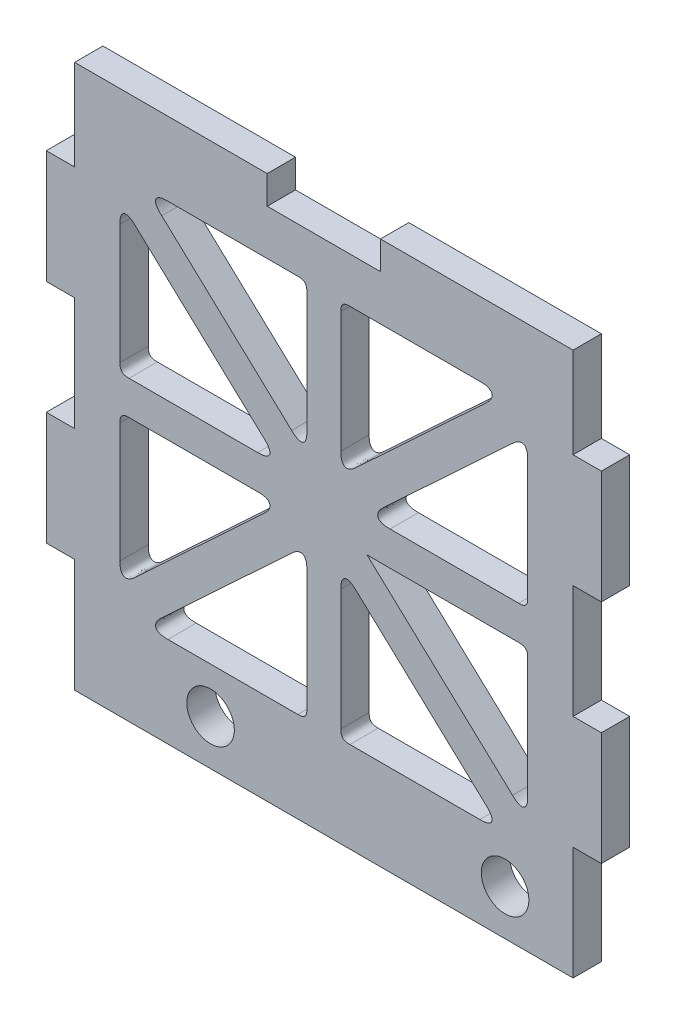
ISO-10303-21;
HEADER;
FILE_DESCRIPTION(('STEP AP214'),'2;1');
FILE_NAME('part.step','',(''),(''),'','','');
FILE_SCHEMA(('AUTOMOTIVE_DESIGN { 1 0 10303 214 1 1 1 1 }'));
ENDSEC;
DATA;
#1=APPLICATION_CONTEXT('core data for automotive mechanical design processes');
#2=APPLICATION_PROTOCOL_DEFINITION('international standard','automotive_design',2000,#1);
#3=PRODUCT_CONTEXT('',#1,'mechanical');
#4=PRODUCT('Part','Part','',(#3));
#5=PRODUCT_RELATED_PRODUCT_CATEGORY('part','',(#4));
#6=PRODUCT_DEFINITION_FORMATION('','',#4);
#7=PRODUCT_DEFINITION_CONTEXT('part definition',#1,'design');
#8=PRODUCT_DEFINITION('design','',#6,#7);
#9=PRODUCT_DEFINITION_SHAPE('','',#8);
#10=(LENGTH_UNIT() NAMED_UNIT(*) SI_UNIT(.MILLI.,.METRE.));
#11=(NAMED_UNIT(*) PLANE_ANGLE_UNIT() SI_UNIT($,.RADIAN.));
#12=(NAMED_UNIT(*) SI_UNIT($,.STERADIAN.) SOLID_ANGLE_UNIT());
#13=UNCERTAINTY_MEASURE_WITH_UNIT(LENGTH_MEASURE(1.E-05),#10,'distance_accuracy_value','');
#14=(GEOMETRIC_REPRESENTATION_CONTEXT(3) GLOBAL_UNCERTAINTY_ASSIGNED_CONTEXT((#13)) GLOBAL_UNIT_ASSIGNED_CONTEXT((#10,
#11,#12)) REPRESENTATION_CONTEXT('',''));
#15=CARTESIAN_POINT('',(0.,0.,0.));
#16=DIRECTION('',(0.,0.,1.));
#17=DIRECTION('',(1.,0.,0.));
#18=AXIS2_PLACEMENT_3D('',#15,#16,#17);
#19=CARTESIAN_POINT('',(-22.,48.,2.5));
#20=DIRECTION('',(0.,-1.,0.));
#21=DIRECTION('',(0.,0.,-1.));
#22=AXIS2_PLACEMENT_3D('',#19,#20,#21);
#23=PLANE('',#22);
#24=DIRECTION('',(-1.,0.,0.));
#25=VECTOR('',#24,1.);
#26=CARTESIAN_POINT('',(-22.,48.,0.));
#27=LINE('',#26,#25);
#28=CARTESIAN_POINT('',(22.,48.,0.));
#29=VERTEX_POINT('',#28);
#30=CARTESIAN_POINT('',(5.,48.,0.));
#31=VERTEX_POINT('',#30);
#32=EDGE_CURVE('E750',#29,#31,#27,.T.);
#33=ORIENTED_EDGE('',*,*,#32,.T.);
#34=DIRECTION('',(0.,0.,1.));
#35=VECTOR('',#34,1.);
#36=CARTESIAN_POINT('',(5.,48.,-10.3077640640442));
#37=LINE('',#36,#35);
#38=CARTESIAN_POINT('',(5.,48.,2.5));
#39=VERTEX_POINT('',#38);
#40=EDGE_CURVE('E596',#31,#39,#37,.T.);
#41=ORIENTED_EDGE('',*,*,#40,.T.);
#42=DIRECTION('',(-1.,0.,0.));
#43=VECTOR('',#42,1.);
#44=CARTESIAN_POINT('',(-22.,48.,2.5));
#45=LINE('',#44,#43);
#46=CARTESIAN_POINT('',(22.,48.,2.5));
#47=VERTEX_POINT('',#46);
#48=EDGE_CURVE('E734',#47,#39,#45,.T.);
#49=ORIENTED_EDGE('',*,*,#48,.F.);
#50=DIRECTION('',(0.,0.,-1.));
#51=VECTOR('',#50,1.);
#52=CARTESIAN_POINT('',(22.,48.,2.5));
#53=LINE('',#52,#51);
#54=EDGE_CURVE('E755',#47,#29,#53,.T.);
#55=ORIENTED_EDGE('',*,*,#54,.T.);
#56=EDGE_LOOP('',(#33,#41,#49,#55));
#57=FACE_BOUND('',#56,.T.);
#58=ADVANCED_FACE('F37',(#57),#23,.F.);
#59=CARTESIAN_POINT('',(-22.,0.,2.5));
#60=DIRECTION('',(1.,0.,0.));
#61=DIRECTION('',(0.,0.,-1.));
#62=AXIS2_PLACEMENT_3D('',#59,#60,#61);
#63=PLANE('',#62);
#64=DIRECTION('',(0.,-1.,0.));
#65=VECTOR('',#64,1.);
#66=CARTESIAN_POINT('',(-22.,0.,2.5));
#67=LINE('',#66,#65);
#68=CARTESIAN_POINT('',(-22.,10.,2.5));
#69=VERTEX_POINT('',#68);
#70=CARTESIAN_POINT('',(-22.,0.,2.5));
#71=VERTEX_POINT('',#70);
#72=EDGE_CURVE('E726',#69,#71,#67,.T.);
#73=ORIENTED_EDGE('',*,*,#72,.F.);
#74=DIRECTION('',(0.,0.,1.));
#75=VECTOR('',#74,1.);
#76=CARTESIAN_POINT('',(-22.,10.,-10.3077640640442));
#77=LINE('',#76,#75);
#78=CARTESIAN_POINT('',(-22.,10.,0.));
#79=VERTEX_POINT('',#78);
#80=EDGE_CURVE('E635',#79,#69,#77,.T.);
#81=ORIENTED_EDGE('',*,*,#80,.F.);
#82=DIRECTION('',(0.,-1.,0.));
#83=VECTOR('',#82,1.);
#84=CARTESIAN_POINT('',(-22.,0.,0.));
#85=LINE('',#84,#83);
#86=CARTESIAN_POINT('',(-22.,0.,0.));
#87=VERTEX_POINT('',#86);
#88=EDGE_CURVE('E720',#79,#87,#85,.T.);
#89=ORIENTED_EDGE('',*,*,#88,.T.);
#90=DIRECTION('',(0.,0.,-1.));
#91=VECTOR('',#90,1.);
#92=CARTESIAN_POINT('',(-22.,0.,2.5));
#93=LINE('',#92,#91);
#94=EDGE_CURVE('E761',#71,#87,#93,.T.);
#95=ORIENTED_EDGE('',*,*,#94,.F.);
#96=EDGE_LOOP('',(#73,#81,#89,#95));
#97=FACE_BOUND('',#96,.T.);
#98=ADVANCED_FACE('F2290',(#97),#63,.F.);
#99=CARTESIAN_POINT('',(-22.,30.,0.));
#100=VERTEX_POINT('',#99);
#101=CARTESIAN_POINT('',(-22.,20.,0.));
#102=VERTEX_POINT('',#101);
#103=EDGE_CURVE('E742',#100,#102,#85,.T.);
#104=ORIENTED_EDGE('',*,*,#103,.T.);
#105=DIRECTION('',(0.,0.,1.));
#106=VECTOR('',#105,1.);
#107=CARTESIAN_POINT('',(-22.,20.,-10.3077640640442));
#108=LINE('',#107,#106);
#109=CARTESIAN_POINT('',(-22.,20.,2.5));
#110=VERTEX_POINT('',#109);
#111=EDGE_CURVE('E631',#102,#110,#108,.T.);
#112=ORIENTED_EDGE('',*,*,#111,.T.);
#113=CARTESIAN_POINT('',(-22.,30.,2.5));
#114=VERTEX_POINT('',#113);
#115=EDGE_CURVE('E725',#114,#110,#67,.T.);
#116=ORIENTED_EDGE('',*,*,#115,.F.);
#117=DIRECTION('',(0.,0.,1.));
#118=VECTOR('',#117,1.);
#119=CARTESIAN_POINT('',(-22.,30.,-10.3077640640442));
#120=LINE('',#119,#118);
#121=EDGE_CURVE('E661',#100,#114,#120,.T.);
#122=ORIENTED_EDGE('',*,*,#121,.F.);
#123=EDGE_LOOP('',(#104,#112,#116,#122));
#124=FACE_BOUND('',#123,.T.);
#125=ADVANCED_FACE('F2295',(#124),#63,.F.);
#126=CARTESIAN_POINT('',(22.,0.,2.5));
#127=DIRECTION('',(-1.,0.,0.));
#128=DIRECTION('',(0.,0.,1.));
#129=AXIS2_PLACEMENT_3D('',#126,#127,#128);
#130=PLANE('',#129);
#131=DIRECTION('',(0.,1.,0.));
#132=VECTOR('',#131,1.);
#133=CARTESIAN_POINT('',(22.,0.,0.));
#134=LINE('',#133,#132);
#135=CARTESIAN_POINT('',(22.,20.,0.));
#136=VERTEX_POINT('',#135);
#137=CARTESIAN_POINT('',(22.,30.,0.));
#138=VERTEX_POINT('',#137);
#139=EDGE_CURVE('E749',#136,#138,#134,.T.);
#140=ORIENTED_EDGE('',*,*,#139,.T.);
#141=DIRECTION('',(0.,0.,1.));
#142=VECTOR('',#141,1.);
#143=CARTESIAN_POINT('',(22.,30.,-10.3077640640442));
#144=LINE('',#143,#142);
#145=CARTESIAN_POINT('',(22.,30.,2.5));
#146=VERTEX_POINT('',#145);
#147=EDGE_CURVE('E690',#138,#146,#144,.T.);
#148=ORIENTED_EDGE('',*,*,#147,.T.);
#149=DIRECTION('',(0.,1.,0.));
#150=VECTOR('',#149,1.);
#151=CARTESIAN_POINT('',(22.,0.,2.5));
#152=LINE('',#151,#150);
#153=CARTESIAN_POINT('',(22.,20.,2.5));
#154=VERTEX_POINT('',#153);
#155=EDGE_CURVE('E733',#154,#146,#152,.T.);
#156=ORIENTED_EDGE('',*,*,#155,.F.);
#157=DIRECTION('',(0.,0.,1.));
#158=VECTOR('',#157,1.);
#159=CARTESIAN_POINT('',(22.,20.,-10.3077640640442));
#160=LINE('',#159,#158);
#161=EDGE_CURVE('E709',#136,#154,#160,.T.);
#162=ORIENTED_EDGE('',*,*,#161,.F.);
#163=EDGE_LOOP('',(#140,#148,#156,#162));
#164=FACE_BOUND('',#163,.T.);
#165=ADVANCED_FACE('F2308',(#164),#130,.F.);
#166=CARTESIAN_POINT('',(22.,40.,2.5));
#167=VERTEX_POINT('',#166);
#168=EDGE_CURVE('E728',#167,#47,#152,.T.);
#169=ORIENTED_EDGE('',*,*,#168,.F.);
#170=DIRECTION('',(0.,0.,1.));
#171=VECTOR('',#170,1.);
#172=CARTESIAN_POINT('',(22.,40.,-10.3077640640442));
#173=LINE('',#172,#171);
#174=CARTESIAN_POINT('',(22.,40.,0.));
#175=VERTEX_POINT('',#174);
#176=EDGE_CURVE('E683',#175,#167,#173,.T.);
#177=ORIENTED_EDGE('',*,*,#176,.F.);
#178=EDGE_CURVE('E744',#175,#29,#134,.T.);
#179=ORIENTED_EDGE('',*,*,#178,.T.);
#180=ORIENTED_EDGE('',*,*,#54,.F.);
#181=EDGE_LOOP('',(#169,#177,#179,#180));
#182=FACE_BOUND('',#181,.T.);
#183=ADVANCED_FACE('F2309',(#182),#130,.F.);
#184=CARTESIAN_POINT('',(-22.,48.,0.));
#185=VERTEX_POINT('',#184);
#186=CARTESIAN_POINT('',(-22.,40.,0.));
#187=VERTEX_POINT('',#186);
#188=EDGE_CURVE('E738',#185,#187,#85,.T.);
#189=ORIENTED_EDGE('',*,*,#188,.T.);
#190=DIRECTION('',(0.,0.,1.));
#191=VECTOR('',#190,1.);
#192=CARTESIAN_POINT('',(-22.,40.,-10.3077640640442));
#193=LINE('',#192,#191);
#194=CARTESIAN_POINT('',(-22.,40.,2.5));
#195=VERTEX_POINT('',#194);
#196=EDGE_CURVE('E658',#187,#195,#193,.T.);
#197=ORIENTED_EDGE('',*,*,#196,.T.);
#198=CARTESIAN_POINT('',(-22.,48.,2.5));
#199=VERTEX_POINT('',#198);
#200=EDGE_CURVE('E721',#199,#195,#67,.T.);
#201=ORIENTED_EDGE('',*,*,#200,.F.);
#202=DIRECTION('',(0.,0.,-1.));
#203=VECTOR('',#202,1.);
#204=CARTESIAN_POINT('',(-22.,48.,2.5));
#205=LINE('',#204,#203);
#206=EDGE_CURVE('E737',#199,#185,#205,.T.);
#207=ORIENTED_EDGE('',*,*,#206,.T.);
#208=EDGE_LOOP('',(#189,#197,#201,#207));
#209=FACE_BOUND('',#208,.T.);
#210=ADVANCED_FACE('F2298',(#209),#63,.F.);
#211=CARTESIAN_POINT('',(-22.,0.,2.5));
#212=DIRECTION('',(0.,1.,0.));
#213=DIRECTION('',(0.,0.,1.));
#214=AXIS2_PLACEMENT_3D('',#211,#212,#213);
#215=PLANE('',#214);
#216=DIRECTION('',(1.,0.,0.));
#217=VECTOR('',#216,1.);
#218=CARTESIAN_POINT('',(-22.,0.,0.));
#219=LINE('',#218,#217);
#220=CARTESIAN_POINT('',(22.,0.,0.));
#221=VERTEX_POINT('',#220);
#222=EDGE_CURVE('E741',#87,#221,#219,.T.);
#223=ORIENTED_EDGE('',*,*,#222,.T.);
#224=DIRECTION('',(0.,0.,-1.));
#225=VECTOR('',#224,1.);
#226=CARTESIAN_POINT('',(22.,0.,2.5));
#227=LINE('',#226,#225);
#228=CARTESIAN_POINT('',(22.,0.,2.5));
#229=VERTEX_POINT('',#228);
#230=EDGE_CURVE('E758',#229,#221,#227,.T.);
#231=ORIENTED_EDGE('',*,*,#230,.F.);
#232=DIRECTION('',(1.,0.,0.));
#233=VECTOR('',#232,1.);
#234=CARTESIAN_POINT('',(-22.,0.,2.5));
#235=LINE('',#234,#233);
#236=EDGE_CURVE('E724',#71,#229,#235,.T.);
#237=ORIENTED_EDGE('',*,*,#236,.F.);
#238=ORIENTED_EDGE('',*,*,#94,.T.);
#239=EDGE_LOOP('',(#223,#231,#237,#238));
#240=FACE_BOUND('',#239,.T.);
#241=ADVANCED_FACE('F2306',(#240),#215,.F.);
#242=CARTESIAN_POINT('',(22.,10.,0.));
#243=VERTEX_POINT('',#242);
#244=EDGE_CURVE('E745',#221,#243,#134,.T.);
#245=ORIENTED_EDGE('',*,*,#244,.T.);
#246=DIRECTION('',(0.,0.,1.));
#247=VECTOR('',#246,1.);
#248=CARTESIAN_POINT('',(22.,10.,-10.3077640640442));
#249=LINE('',#248,#247);
#250=CARTESIAN_POINT('',(22.,10.,2.5));
#251=VERTEX_POINT('',#250);
#252=EDGE_CURVE('E715',#243,#251,#249,.T.);
#253=ORIENTED_EDGE('',*,*,#252,.T.);
#254=EDGE_CURVE('E729',#229,#251,#152,.T.);
#255=ORIENTED_EDGE('',*,*,#254,.F.);
#256=ORIENTED_EDGE('',*,*,#230,.T.);
#257=EDGE_LOOP('',(#245,#253,#255,#256));
#258=FACE_BOUND('',#257,.T.);
#259=ADVANCED_FACE('F2301',(#258),#130,.F.);
#260=CARTESIAN_POINT('',(-5.,48.,2.5));
#261=VERTEX_POINT('',#260);
#262=EDGE_CURVE('E732',#261,#199,#45,.T.);
#263=ORIENTED_EDGE('',*,*,#262,.F.);
#264=DIRECTION('',(0.,0.,1.));
#265=VECTOR('',#264,1.);
#266=CARTESIAN_POINT('',(-5.,48.,-10.3077640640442));
#267=LINE('',#266,#265);
#268=CARTESIAN_POINT('',(-5.,48.,0.));
#269=VERTEX_POINT('',#268);
#270=EDGE_CURVE('E592',#269,#261,#267,.T.);
#271=ORIENTED_EDGE('',*,*,#270,.F.);
#272=EDGE_CURVE('E748',#269,#185,#27,.T.);
#273=ORIENTED_EDGE('',*,*,#272,.T.);
#274=ORIENTED_EDGE('',*,*,#206,.F.);
#275=EDGE_LOOP('',(#263,#271,#273,#274));
#276=FACE_BOUND('',#275,.T.);
#277=ADVANCED_FACE('F892',(#276),#23,.F.);
#278=CARTESIAN_POINT('',(0.,0.,2.5));
#279=DIRECTION('',(0.,0.,-1.));
#280=DIRECTION('',(-1.,0.,0.));
#281=AXIS2_PLACEMENT_3D('',#278,#279,#280);
#282=PLANE('',#281);
#283=DIRECTION('',(1.,0.,0.));
#284=VECTOR('',#283,1.);
#285=CARTESIAN_POINT('',(-15.7981027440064,8.,2.5));
#286=LINE('',#285,#284);
#287=CARTESIAN_POINT('',(-13.7640560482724,8.,2.5));
#288=VERTEX_POINT('',#287);
#289=CARTESIAN_POINT('',(-2.30000000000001,8.,2.5));
#290=VERTEX_POINT('',#289);
#291=EDGE_CURVE('E3339',#288,#290,#286,.T.);
#292=ORIENTED_EDGE('',*,*,#291,.F.);
#293=CARTESIAN_POINT('',(-14.3090406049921,9.38565504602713,2.5));
#294=CARTESIAN_POINT('',(-14.510491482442,9.19819381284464,2.5));
#295=CARTESIAN_POINT('',(-14.7119423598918,9.01073257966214,2.5));
#296=CARTESIAN_POINT('',(-15.0031058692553,8.50718951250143,2.5));
#297=CARTESIAN_POINT('',(-14.8705972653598,8.17027865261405,2.5));
#298=CARTESIAN_POINT('',(-14.3144165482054,8.,2.5));
#299=CARTESIAN_POINT('',(-14.0392362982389,8.,2.5));
#300=CARTESIAN_POINT('',(-13.7640560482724,8.,2.5));
#301=B_SPLINE_CURVE_WITH_KNOTS('',5,(#293,#294,#295,#296,#297,#298,#299,#300),.UNSPECIFIED.,.F.,
.F.,(6,2,6),(0.,0.5,1.),.UNSPECIFIED.);
#302=CARTESIAN_POINT('',(-14.3090406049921,9.38565504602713,2.5));
#303=VERTEX_POINT('',#302);
#304=EDGE_CURVE('E1207',#288,#303,#301,.F.);
#305=ORIENTED_EDGE('',*,*,#304,.T.);
#306=DIRECTION('',(-0.732068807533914,-0.681230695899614,0.));
#307=VECTOR('',#306,1.);
#308=CARTESIAN_POINT('',(-1.5,21.3051789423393,2.5));
#309=LINE('',#308,#307);
#310=CARTESIAN_POINT('',(-2.84498455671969,20.0535960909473,2.5));
#311=VERTEX_POINT('',#310);
#312=EDGE_CURVE('E3357',#311,#303,#309,.T.);
#313=ORIENTED_EDGE('',*,*,#312,.F.);
#314=CARTESIAN_POINT('',(-1.5,19.4679410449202,2.5));
#315=CARTESIAN_POINT('',(-1.5,19.7236795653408,2.5));
#316=CARTESIAN_POINT('',(-1.5,19.9794180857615,2.5));
#317=CARTESIAN_POINT('',(-1.65709988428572,20.502471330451,2.5));
#318=CARTESIAN_POINT('',(-1.98061594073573,20.6433419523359,2.5));
#319=CARTESIAN_POINT('',(-2.47054816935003,20.4020299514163,2.5));
#320=CARTESIAN_POINT('',(-2.65776636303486,20.2278130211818,2.5));
#321=CARTESIAN_POINT('',(-2.84498455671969,20.0535960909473,2.5));
#322=B_SPLINE_CURVE_WITH_KNOTS('',5,(#314,#315,#316,#317,#318,#319,#320,#321),.UNSPECIFIED.,.F.,
.F.,(6,2,6),(0.,0.5,1.),.UNSPECIFIED.);
#323=CARTESIAN_POINT('',(-1.5,19.4679410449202,2.5));
#324=VERTEX_POINT('',#323);
#325=EDGE_CURVE('E1217',#311,#324,#322,.F.);
#326=ORIENTED_EDGE('',*,*,#325,.T.);
#327=DIRECTION('',(0.,1.,0.));
#328=VECTOR('',#327,1.);
#329=CARTESIAN_POINT('',(-1.5,8.,2.5));
#330=LINE('',#329,#328);
#331=CARTESIAN_POINT('',(-1.5,8.8,2.5));
#332=VERTEX_POINT('',#331);
#333=EDGE_CURVE('E3330',#332,#324,#330,.T.);
#334=ORIENTED_EDGE('',*,*,#333,.F.);
#335=CARTESIAN_POINT('',(-2.3,8.,2.5));
#336=CARTESIAN_POINT('',(-2.16544155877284,8.,2.5));
#337=CARTESIAN_POINT('',(-2.03088311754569,8.,2.5));
#338=CARTESIAN_POINT('',(-1.73431457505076,8.05735353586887,2.5));
#339=CARTESIAN_POINT('',(-1.55735353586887,8.23431457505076,2.5));
#340=CARTESIAN_POINT('',(-1.5,8.53088311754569,2.5));
#341=CARTESIAN_POINT('',(-1.5,8.66544155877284,2.5));
#342=CARTESIAN_POINT('',(-1.5,8.8,2.5));
#343=B_SPLINE_CURVE_WITH_KNOTS('',5,(#335,#336,#337,#338,#339,#340,#341,#342),.UNSPECIFIED.,.F.,
.F.,(6,2,6),(0.,0.5,1.),.UNSPECIFIED.);
#344=EDGE_CURVE('E1224',#332,#290,#343,.F.);
#345=ORIENTED_EDGE('',*,*,#344,.T.);
#346=EDGE_LOOP('',(#292,#305,#313,#326,#334,#345));
#347=FACE_BOUND('',#346,.T.);
#348=DIRECTION('',(-0.732068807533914,0.681230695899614,0.));
#349=VECTOR('',#348,1.);
#350=CARTESIAN_POINT('',(1.5,21.3051789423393,2.5));
#351=LINE('',#350,#349);
#352=CARTESIAN_POINT('',(14.3090406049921,9.38565504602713,2.5));
#353=VERTEX_POINT('',#352);
#354=CARTESIAN_POINT('',(2.84498455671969,20.0535960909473,2.5));
#355=VERTEX_POINT('',#354);
#356=EDGE_CURVE('E3283',#353,#355,#351,.T.);
#357=ORIENTED_EDGE('',*,*,#356,.F.);
#358=CARTESIAN_POINT('',(13.7640560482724,8.,2.5));
#359=CARTESIAN_POINT('',(14.0392362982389,8.,2.5));
#360=CARTESIAN_POINT('',(14.3144165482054,8.,2.5));
#361=CARTESIAN_POINT('',(14.8705972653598,8.17027865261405,2.5));
#362=CARTESIAN_POINT('',(15.0031058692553,8.50718951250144,2.5));
#363=CARTESIAN_POINT('',(14.7119423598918,9.01073257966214,2.5));
#364=CARTESIAN_POINT('',(14.510491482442,9.19819381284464,2.5));
#365=CARTESIAN_POINT('',(14.3090406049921,9.38565504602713,2.5));
#366=B_SPLINE_CURVE_WITH_KNOTS('',5,(#358,#359,#360,#361,#362,#363,#364,#365),.UNSPECIFIED.,.F.,
.F.,(6,2,6),(0.,0.5,1.),.UNSPECIFIED.);
#367=CARTESIAN_POINT('',(13.7640560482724,8.,2.5));
#368=VERTEX_POINT('',#367);
#369=EDGE_CURVE('E1247',#353,#368,#366,.F.);
#370=ORIENTED_EDGE('',*,*,#369,.T.);
#371=DIRECTION('',(1.,0.,0.));
#372=VECTOR('',#371,1.);
#373=CARTESIAN_POINT('',(15.7981027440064,8.,2.5));
#374=LINE('',#373,#372);
#375=CARTESIAN_POINT('',(2.30000000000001,8.,2.5));
#376=VERTEX_POINT('',#375);
#377=EDGE_CURVE('E3300',#376,#368,#374,.T.);
#378=ORIENTED_EDGE('',*,*,#377,.F.);
#379=CARTESIAN_POINT('',(1.5,8.8,2.5));
#380=CARTESIAN_POINT('',(1.5,8.66544155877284,2.5));
#381=CARTESIAN_POINT('',(1.5,8.53088311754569,2.5));
#382=CARTESIAN_POINT('',(1.55735353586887,8.23431457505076,2.5));
#383=CARTESIAN_POINT('',(1.73431457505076,8.05735353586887,2.5));
#384=CARTESIAN_POINT('',(2.03088311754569,8.,2.5));
#385=CARTESIAN_POINT('',(2.16544155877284,8.,2.5));
#386=CARTESIAN_POINT('',(2.3,8.,2.5));
#387=B_SPLINE_CURVE_WITH_KNOTS('',5,(#379,#380,#381,#382,#383,#384,#385,#386),.UNSPECIFIED.,.F.,
.F.,(6,2,6),(0.,0.5,1.),.UNSPECIFIED.);
#388=CARTESIAN_POINT('',(1.5,8.8,2.5));
#389=VERTEX_POINT('',#388);
#390=EDGE_CURVE('E1229',#376,#389,#387,.F.);
#391=ORIENTED_EDGE('',*,*,#390,.T.);
#392=DIRECTION('',(0.,-1.,0.));
#393=VECTOR('',#392,1.);
#394=CARTESIAN_POINT('',(1.5,8.,2.5));
#395=LINE('',#394,#393);
#396=CARTESIAN_POINT('',(1.5,19.4679410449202,2.5));
#397=VERTEX_POINT('',#396);
#398=EDGE_CURVE('E3270',#397,#389,#395,.T.);
#399=ORIENTED_EDGE('',*,*,#398,.F.);
#400=CARTESIAN_POINT('',(2.84498455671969,20.0535960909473,2.5));
#401=CARTESIAN_POINT('',(2.65776636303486,20.2278130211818,2.5));
#402=CARTESIAN_POINT('',(2.47054816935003,20.4020299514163,2.5));
#403=CARTESIAN_POINT('',(1.98061594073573,20.6433419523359,2.5));
#404=CARTESIAN_POINT('',(1.65709988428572,20.502471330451,2.5));
#405=CARTESIAN_POINT('',(1.5,19.9794180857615,2.5));
#406=CARTESIAN_POINT('',(1.5,19.7236795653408,2.5));
#407=CARTESIAN_POINT('',(1.5,19.4679410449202,2.5));
#408=B_SPLINE_CURVE_WITH_KNOTS('',5,(#400,#401,#402,#403,#404,#405,#406,#407),.UNSPECIFIED.,.F.,
.F.,(6,2,6),(0.,0.5,1.),.UNSPECIFIED.);
#409=EDGE_CURVE('E1240',#397,#355,#408,.F.);
#410=ORIENTED_EDGE('',*,*,#409,.T.);
#411=EDGE_LOOP('',(#357,#370,#378,#391,#399,#410));
#412=FACE_BOUND('',#411,.T.);
#413=DIRECTION('',(0.732068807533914,0.681230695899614,0.));
#414=VECTOR('',#413,1.);
#415=CARTESIAN_POINT('',(1.5,28.1948210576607,2.5));
#416=LINE('',#415,#414);
#417=CARTESIAN_POINT('',(2.84498455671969,29.4464039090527,2.5));
#418=VERTEX_POINT('',#417);
#419=CARTESIAN_POINT('',(14.3090406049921,40.1143449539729,2.5));
#420=VERTEX_POINT('',#419);
#421=EDGE_CURVE('E769',#418,#420,#416,.T.);
#422=ORIENTED_EDGE('',*,*,#421,.F.);
#423=CARTESIAN_POINT('',(1.5,30.0320589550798,2.5));
#424=CARTESIAN_POINT('',(1.5,29.7763204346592,2.5));
#425=CARTESIAN_POINT('',(1.5,29.5205819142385,2.5));
#426=CARTESIAN_POINT('',(1.65709988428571,28.997528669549,2.5));
#427=CARTESIAN_POINT('',(1.98061594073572,28.8566580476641,2.5));
#428=CARTESIAN_POINT('',(2.47054816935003,29.0979700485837,2.5));
#429=CARTESIAN_POINT('',(2.65776636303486,29.2721869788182,2.5));
#430=CARTESIAN_POINT('',(2.84498455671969,29.4464039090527,2.5));
#431=B_SPLINE_CURVE_WITH_KNOTS('',5,(#423,#424,#425,#426,#427,#428,#429,#430),.UNSPECIFIED.,.F.,
.F.,(6,2,6),(0.,0.5,1.),.UNSPECIFIED.);
#432=CARTESIAN_POINT('',(1.5,30.0320589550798,2.5));
#433=VERTEX_POINT('',#432);
#434=EDGE_CURVE('E867',#418,#433,#431,.F.);
#435=ORIENTED_EDGE('',*,*,#434,.T.);
#436=DIRECTION('',(0.,-1.,0.));
#437=VECTOR('',#436,1.);
#438=CARTESIAN_POINT('',(1.5,41.5,2.5));
#439=LINE('',#438,#437);
#440=CARTESIAN_POINT('',(1.5,40.7,2.5));
#441=VERTEX_POINT('',#440);
#442=EDGE_CURVE('E765',#441,#433,#439,.T.);
#443=ORIENTED_EDGE('',*,*,#442,.F.);
#444=CARTESIAN_POINT('',(2.3,41.5,2.5));
#445=CARTESIAN_POINT('',(2.16544155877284,41.5,2.5));
#446=CARTESIAN_POINT('',(2.03088311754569,41.5,2.5));
#447=CARTESIAN_POINT('',(1.73431457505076,41.4426464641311,2.5));
#448=CARTESIAN_POINT('',(1.55735353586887,41.2656854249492,2.5));
#449=CARTESIAN_POINT('',(1.5,40.9691168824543,2.5));
#450=CARTESIAN_POINT('',(1.5,40.8345584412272,2.5));
#451=CARTESIAN_POINT('',(1.5,40.7,2.5));
#452=B_SPLINE_CURVE_WITH_KNOTS('',5,(#444,#445,#446,#447,#448,#449,#450,#451),.UNSPECIFIED.,.F.,
.F.,(6,2,6),(0.,0.5,1.),.UNSPECIFIED.);
#453=CARTESIAN_POINT('',(2.30000000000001,41.5,2.5));
#454=VERTEX_POINT('',#453);
#455=EDGE_CURVE('E865',#441,#454,#452,.F.);
#456=ORIENTED_EDGE('',*,*,#455,.T.);
#457=DIRECTION('',(-1.,0.,0.));
#458=VECTOR('',#457,1.);
#459=CARTESIAN_POINT('',(15.7981027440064,41.5,2.5));
#460=LINE('',#459,#458);
#461=CARTESIAN_POINT('',(13.7640560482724,41.5,2.5));
#462=VERTEX_POINT('',#461);
#463=EDGE_CURVE('E770',#462,#454,#460,.T.);
#464=ORIENTED_EDGE('',*,*,#463,.F.);
#465=CARTESIAN_POINT('',(14.3090406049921,40.1143449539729,2.5));
#466=CARTESIAN_POINT('',(14.510491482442,40.3018061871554,2.5));
#467=CARTESIAN_POINT('',(14.7119423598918,40.4892674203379,2.5));
#468=CARTESIAN_POINT('',(15.0031058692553,40.9928104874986,2.5));
#469=CARTESIAN_POINT('',(14.8705972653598,41.3297213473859,2.5));
#470=CARTESIAN_POINT('',(14.3144165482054,41.5,2.5));
#471=CARTESIAN_POINT('',(14.0392362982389,41.5,2.5));
#472=CARTESIAN_POINT('',(13.7640560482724,41.5,2.5));
#473=B_SPLINE_CURVE_WITH_KNOTS('',5,(#465,#466,#467,#468,#469,#470,#471,#472),.UNSPECIFIED.,.F.,
.F.,(6,2,6),(0.,0.5,1.),.UNSPECIFIED.);
#474=EDGE_CURVE('E2433',#462,#420,#473,.F.);
#475=ORIENTED_EDGE('',*,*,#474,.T.);
#476=EDGE_LOOP('',(#422,#435,#443,#456,#464,#475));
#477=FACE_BOUND('',#476,.T.);
#478=DIRECTION('',(-1.,0.,0.));
#479=VECTOR('',#478,1.);
#480=CARTESIAN_POINT('',(-15.7981027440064,41.5,2.5));
#481=LINE('',#480,#479);
#482=CARTESIAN_POINT('',(-2.30000000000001,41.5,2.5));
#483=VERTEX_POINT('',#482);
#484=CARTESIAN_POINT('',(-13.7640560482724,41.5,2.5));
#485=VERTEX_POINT('',#484);
#486=EDGE_CURVE('E2067',#483,#485,#481,.T.);
#487=ORIENTED_EDGE('',*,*,#486,.F.);
#488=CARTESIAN_POINT('',(-1.5,40.7,2.5));
#489=CARTESIAN_POINT('',(-1.5,40.8345584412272,2.5));
#490=CARTESIAN_POINT('',(-1.5,40.9691168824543,2.5));
#491=CARTESIAN_POINT('',(-1.55735353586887,41.2656854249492,2.5));
#492=CARTESIAN_POINT('',(-1.73431457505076,41.4426464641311,2.5));
#493=CARTESIAN_POINT('',(-2.03088311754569,41.5,2.5));
#494=CARTESIAN_POINT('',(-2.16544155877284,41.5,2.5));
#495=CARTESIAN_POINT('',(-2.3,41.5,2.5));
#496=B_SPLINE_CURVE_WITH_KNOTS('',5,(#488,#489,#490,#491,#492,#493,#494,#495),.UNSPECIFIED.,.F.,
.F.,(6,2,6),(0.,0.5,1.),.UNSPECIFIED.);
#497=CARTESIAN_POINT('',(-1.5,40.7,2.5));
#498=VERTEX_POINT('',#497);
#499=EDGE_CURVE('E1167',#483,#498,#496,.F.);
#500=ORIENTED_EDGE('',*,*,#499,.T.);
#501=DIRECTION('',(0.,1.,0.));
#502=VECTOR('',#501,1.);
#503=CARTESIAN_POINT('',(-1.5,41.5,2.5));
#504=LINE('',#503,#502);
#505=CARTESIAN_POINT('',(-1.5,30.0320589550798,2.5));
#506=VERTEX_POINT('',#505);
#507=EDGE_CURVE('E2065',#506,#498,#504,.T.);
#508=ORIENTED_EDGE('',*,*,#507,.F.);
#509=CARTESIAN_POINT('',(-2.84498455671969,29.4464039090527,2.5));
#510=CARTESIAN_POINT('',(-2.65776636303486,29.2721869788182,2.5));
#511=CARTESIAN_POINT('',(-2.47054816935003,29.0979700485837,2.5));
#512=CARTESIAN_POINT('',(-1.98061594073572,28.8566580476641,2.5));
#513=CARTESIAN_POINT('',(-1.65709988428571,28.997528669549,2.5));
#514=CARTESIAN_POINT('',(-1.5,29.5205819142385,2.5));
#515=CARTESIAN_POINT('',(-1.5,29.7763204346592,2.5));
#516=CARTESIAN_POINT('',(-1.5,30.0320589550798,2.5));
#517=B_SPLINE_CURVE_WITH_KNOTS('',5,(#509,#510,#511,#512,#513,#514,#515,#516),.UNSPECIFIED.,.F.,
.F.,(6,2,6),(0.,0.5,1.),.UNSPECIFIED.);
#518=CARTESIAN_POINT('',(-2.84498455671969,29.4464039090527,2.5));
#519=VERTEX_POINT('',#518);
#520=EDGE_CURVE('E1171',#506,#519,#517,.F.);
#521=ORIENTED_EDGE('',*,*,#520,.T.);
#522=DIRECTION('',(0.732068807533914,-0.681230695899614,0.));
#523=VECTOR('',#522,1.);
#524=CARTESIAN_POINT('',(-1.5,28.1948210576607,2.5));
#525=LINE('',#524,#523);
#526=CARTESIAN_POINT('',(-14.3090406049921,40.1143449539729,2.5));
#527=VERTEX_POINT('',#526);
#528=EDGE_CURVE('E794',#527,#519,#525,.T.);
#529=ORIENTED_EDGE('',*,*,#528,.F.);
#530=CARTESIAN_POINT('',(-13.7640560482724,41.5,2.5));
#531=CARTESIAN_POINT('',(-14.0392362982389,41.5,2.5));
#532=CARTESIAN_POINT('',(-14.3144165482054,41.5,2.5));
#533=CARTESIAN_POINT('',(-14.8705972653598,41.3297213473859,2.5));
#534=CARTESIAN_POINT('',(-15.0031058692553,40.9928104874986,2.5));
#535=CARTESIAN_POINT('',(-14.7119423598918,40.4892674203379,2.5));
#536=CARTESIAN_POINT('',(-14.510491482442,40.3018061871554,2.5));
#537=CARTESIAN_POINT('',(-14.3090406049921,40.1143449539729,2.5));
#538=B_SPLINE_CURVE_WITH_KNOTS('',5,(#530,#531,#532,#533,#534,#535,#536,#537),.UNSPECIFIED.,.F.,
.F.,(6,2,6),(0.,0.5,1.),.UNSPECIFIED.);
#539=EDGE_CURVE('E1039',#527,#485,#538,.F.);
#540=ORIENTED_EDGE('',*,*,#539,.T.);
#541=EDGE_LOOP('',(#487,#500,#508,#521,#529,#540));
#542=FACE_BOUND('',#541,.T.);
#543=DIRECTION('',(-0.732068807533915,-0.681230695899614,0.));
#544=VECTOR('',#543,1.);
#545=CARTESIAN_POINT('',(3.8138375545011,26.25,2.5));
#546=LINE('',#545,#544);
#547=CARTESIAN_POINT('',(16.6550154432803,38.1994294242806,2.5));
#548=VERTEX_POINT('',#547);
#549=CARTESIAN_POINT('',(5.30289969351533,27.6356550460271,2.5));
#550=VERTEX_POINT('',#549);
#551=EDGE_CURVE('E529',#548,#550,#546,.T.);
#552=ORIENTED_EDGE('',*,*,#551,.F.);
#553=CARTESIAN_POINT('',(18.,37.6137743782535,2.5));
#554=CARTESIAN_POINT('',(18.,37.8695128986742,2.5));
#555=CARTESIAN_POINT('',(18.,38.1252514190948,2.5));
#556=CARTESIAN_POINT('',(17.8429001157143,38.6483046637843,2.5));
#557=CARTESIAN_POINT('',(17.5193840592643,38.7891752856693,2.5));
#558=CARTESIAN_POINT('',(17.02945183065,38.5478632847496,2.5));
#559=CARTESIAN_POINT('',(16.8422336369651,38.3736463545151,2.5));
#560=CARTESIAN_POINT('',(16.6550154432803,38.1994294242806,2.5));
#561=B_SPLINE_CURVE_WITH_KNOTS('',5,(#553,#554,#555,#556,#557,#558,#559,#560),.UNSPECIFIED.,.F.,
.F.,(6,2,6),(0.,0.5,1.),.UNSPECIFIED.);
#562=CARTESIAN_POINT('',(18.,37.6137743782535,2.5));
#563=VERTEX_POINT('',#562);
#564=EDGE_CURVE('E2474',#548,#563,#561,.F.);
#565=ORIENTED_EDGE('',*,*,#564,.T.);
#566=DIRECTION('',(0.,1.,0.));
#567=VECTOR('',#566,1.);
#568=CARTESIAN_POINT('',(18.,39.4510122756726,2.5));
#569=LINE('',#568,#567);
#570=CARTESIAN_POINT('',(18.,27.05,2.5));
#571=VERTEX_POINT('',#570);
#572=EDGE_CURVE('E534',#571,#563,#569,.T.);
#573=ORIENTED_EDGE('',*,*,#572,.F.);
#574=CARTESIAN_POINT('',(17.2,26.25,2.5));
#575=CARTESIAN_POINT('',(17.3345584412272,26.25,2.5));
#576=CARTESIAN_POINT('',(17.4691168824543,26.25,2.5));
#577=CARTESIAN_POINT('',(17.7656854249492,26.3073535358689,2.5));
#578=CARTESIAN_POINT('',(17.9426464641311,26.4843145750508,2.5));
#579=CARTESIAN_POINT('',(18.,26.7808831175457,2.5));
#580=CARTESIAN_POINT('',(18.,26.9154415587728,2.5));
#581=CARTESIAN_POINT('',(18.,27.05,2.5));
#582=B_SPLINE_CURVE_WITH_KNOTS('',5,(#574,#575,#576,#577,#578,#579,#580,#581),.UNSPECIFIED.,.F.,
.F.,(6,2,6),(0.,0.5,1.),.UNSPECIFIED.);
#583=CARTESIAN_POINT('',(17.2,26.25,2.5));
#584=VERTEX_POINT('',#583);
#585=EDGE_CURVE('E2531',#571,#584,#582,.F.);
#586=ORIENTED_EDGE('',*,*,#585,.T.);
#587=DIRECTION('',(1.,0.,0.));
#588=VECTOR('',#587,1.);
#589=CARTESIAN_POINT('',(18.,26.25,2.5));
#590=LINE('',#589,#588);
#591=CARTESIAN_POINT('',(5.84788425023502,26.25,2.5));
#592=VERTEX_POINT('',#591);
#593=EDGE_CURVE('E2128',#592,#584,#590,.T.);
#594=ORIENTED_EDGE('',*,*,#593,.F.);
#595=CARTESIAN_POINT('',(5.30289969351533,27.6356550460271,2.5));
#596=CARTESIAN_POINT('',(5.10144881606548,27.4481938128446,2.5));
#597=CARTESIAN_POINT('',(4.89999793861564,27.2607325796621,2.5));
#598=CARTESIAN_POINT('',(4.60883442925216,26.7571895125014,2.5));
#599=CARTESIAN_POINT('',(4.74134303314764,26.4202786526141,2.5));
#600=CARTESIAN_POINT('',(5.29752375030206,26.25,2.5));
#601=CARTESIAN_POINT('',(5.57270400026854,26.25,2.5));
#602=CARTESIAN_POINT('',(5.84788425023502,26.25,2.5));
#603=B_SPLINE_CURVE_WITH_KNOTS('',5,(#595,#596,#597,#598,#599,#600,#601,#602),.UNSPECIFIED.,.F.,
.F.,(6,2,6),(0.,0.5,1.),.UNSPECIFIED.);
#604=EDGE_CURVE('E2574',#592,#550,#603,.F.);
#605=ORIENTED_EDGE('',*,*,#604,.T.);
#606=EDGE_LOOP('',(#552,#565,#573,#586,#594,#605));
#607=FACE_BOUND('',#606,.T.);
#608=DIRECTION('',(-1.,0.,0.));
#609=VECTOR('',#608,1.);
#610=CARTESIAN_POINT('',(18.,23.25,2.5));
#611=LINE('',#610,#609);
#612=CARTESIAN_POINT('',(17.2,23.25,2.5));
#613=VERTEX_POINT('',#612);
#614=CARTESIAN_POINT('',(3.8138375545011,23.25,2.5));
#615=VERTEX_POINT('',#614);
#616=EDGE_CURVE('E518',#613,#615,#611,.T.);
#617=ORIENTED_EDGE('',*,*,#616,.F.);
#618=CARTESIAN_POINT('',(18.,22.45,2.5));
#619=CARTESIAN_POINT('',(18.,22.5845584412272,2.5));
#620=CARTESIAN_POINT('',(18.,22.7191168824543,2.5));
#621=CARTESIAN_POINT('',(17.9426464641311,23.0156854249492,2.5));
#622=CARTESIAN_POINT('',(17.7656854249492,23.1926464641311,2.5));
#623=CARTESIAN_POINT('',(17.4691168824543,23.25,2.5));
#624=CARTESIAN_POINT('',(17.3345584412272,23.25,2.5));
#625=CARTESIAN_POINT('',(17.2,23.25,2.5));
#626=B_SPLINE_CURVE_WITH_KNOTS('',5,(#618,#619,#620,#621,#622,#623,#624,#625),.UNSPECIFIED.,.F.,
.F.,(6,2,6),(0.,0.5,1.),.UNSPECIFIED.);
#627=CARTESIAN_POINT('',(18.,22.45,2.5));
#628=VERTEX_POINT('',#627);
#629=EDGE_CURVE('E1256',#613,#628,#626,.F.);
#630=ORIENTED_EDGE('',*,*,#629,.T.);
#631=DIRECTION('',(0.,1.,0.));
#632=VECTOR('',#631,1.);
#633=CARTESIAN_POINT('',(18.,10.0489877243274,2.5));
#634=LINE('',#633,#632);
#635=CARTESIAN_POINT('',(18.,11.8862256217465,2.5));
#636=VERTEX_POINT('',#635);
#637=EDGE_CURVE('E2671',#636,#628,#634,.T.);
#638=ORIENTED_EDGE('',*,*,#637,.F.);
#639=CARTESIAN_POINT('',(16.6550154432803,11.3005705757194,2.5));
#640=CARTESIAN_POINT('',(16.8422336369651,11.1263536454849,2.5));
#641=CARTESIAN_POINT('',(17.02945183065,10.9521367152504,2.5));
#642=CARTESIAN_POINT('',(17.5193840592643,10.7108247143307,2.5));
#643=CARTESIAN_POINT('',(17.8429001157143,10.8516953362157,2.5));
#644=CARTESIAN_POINT('',(18.,11.3747485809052,2.5));
#645=CARTESIAN_POINT('',(18.,11.6304871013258,2.5));
#646=CARTESIAN_POINT('',(18.,11.8862256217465,2.5));
#647=B_SPLINE_CURVE_WITH_KNOTS('',5,(#639,#640,#641,#642,#643,#644,#645,#646),.UNSPECIFIED.,.F.,
.F.,(6,2,6),(0.,0.5,1.),.UNSPECIFIED.);
#648=CARTESIAN_POINT('',(16.6550154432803,11.3005705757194,2.5));
#649=VERTEX_POINT('',#648);
#650=EDGE_CURVE('E1252',#636,#649,#647,.F.);
#651=ORIENTED_EDGE('',*,*,#650,.T.);
#652=DIRECTION('',(0.732068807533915,-0.681230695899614,0.));
#653=VECTOR('',#652,1.);
#654=CARTESIAN_POINT('',(3.8138375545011,23.25,2.5));
#655=LINE('',#654,#653);
#656=EDGE_CURVE('E2670',#615,#649,#655,.T.);
#657=ORIENTED_EDGE('',*,*,#656,.F.);
#658=EDGE_LOOP('',(#617,#630,#638,#651,#657));
#659=FACE_BOUND('',#658,.T.);
#660=DIRECTION('',(0.732068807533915,0.681230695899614,0.));
#661=VECTOR('',#660,1.);
#662=CARTESIAN_POINT('',(-3.8138375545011,23.25,2.5));
#663=LINE('',#662,#661);
#664=CARTESIAN_POINT('',(-16.6550154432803,11.3005705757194,2.5));
#665=VERTEX_POINT('',#664);
#666=CARTESIAN_POINT('',(-5.30289969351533,21.8643449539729,2.5));
#667=VERTEX_POINT('',#666);
#668=EDGE_CURVE('E2729',#665,#667,#663,.T.);
#669=ORIENTED_EDGE('',*,*,#668,.F.);
#670=CARTESIAN_POINT('',(-18.,11.8862256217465,2.5));
#671=CARTESIAN_POINT('',(-18.,11.6304871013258,2.5));
#672=CARTESIAN_POINT('',(-18.,11.3747485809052,2.5));
#673=CARTESIAN_POINT('',(-17.8429001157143,10.8516953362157,2.5));
#674=CARTESIAN_POINT('',(-17.5193840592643,10.7108247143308,2.5));
#675=CARTESIAN_POINT('',(-17.02945183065,10.9521367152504,2.5));
#676=CARTESIAN_POINT('',(-16.8422336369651,11.1263536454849,2.5));
#677=CARTESIAN_POINT('',(-16.6550154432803,11.3005705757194,2.5));
#678=B_SPLINE_CURVE_WITH_KNOTS('',5,(#670,#671,#672,#673,#674,#675,#676,#677),.UNSPECIFIED.,.F.,
.F.,(6,2,6),(0.,0.5,1.),.UNSPECIFIED.);
#679=CARTESIAN_POINT('',(-18.,11.8862256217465,2.5));
#680=VERTEX_POINT('',#679);
#681=EDGE_CURVE('E1202',#665,#680,#678,.F.);
#682=ORIENTED_EDGE('',*,*,#681,.T.);
#683=DIRECTION('',(0.,-1.,0.));
#684=VECTOR('',#683,1.);
#685=CARTESIAN_POINT('',(-18.,10.0489877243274,2.5));
#686=LINE('',#685,#684);
#687=CARTESIAN_POINT('',(-18.,22.45,2.5));
#688=VERTEX_POINT('',#687);
#689=EDGE_CURVE('E2753',#688,#680,#686,.T.);
#690=ORIENTED_EDGE('',*,*,#689,.F.);
#691=CARTESIAN_POINT('',(-17.2,23.25,2.5));
#692=CARTESIAN_POINT('',(-17.3345584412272,23.25,2.5));
#693=CARTESIAN_POINT('',(-17.4691168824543,23.25,2.5));
#694=CARTESIAN_POINT('',(-17.7656854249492,23.1926464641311,2.5));
#695=CARTESIAN_POINT('',(-17.9426464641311,23.0156854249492,2.5));
#696=CARTESIAN_POINT('',(-18.,22.7191168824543,2.5));
#697=CARTESIAN_POINT('',(-18.,22.5845584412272,2.5));
#698=CARTESIAN_POINT('',(-18.,22.45,2.5));
#699=B_SPLINE_CURVE_WITH_KNOTS('',5,(#691,#692,#693,#694,#695,#696,#697,#698),.UNSPECIFIED.,.F.,
.F.,(6,2,6),(0.,0.5,1.),.UNSPECIFIED.);
#700=CARTESIAN_POINT('',(-17.2,23.25,2.5));
#701=VERTEX_POINT('',#700);
#702=EDGE_CURVE('E1185',#688,#701,#699,.F.);
#703=ORIENTED_EDGE('',*,*,#702,.T.);
#704=DIRECTION('',(-1.,0.,0.));
#705=VECTOR('',#704,1.);
#706=CARTESIAN_POINT('',(-18.,23.25,2.5));
#707=LINE('',#706,#705);
#708=CARTESIAN_POINT('',(-5.84788425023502,23.25,2.5));
#709=VERTEX_POINT('',#708);
#710=EDGE_CURVE('E514',#709,#701,#707,.T.);
#711=ORIENTED_EDGE('',*,*,#710,.F.);
#712=CARTESIAN_POINT('',(-5.30289969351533,21.8643449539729,2.5));
#713=CARTESIAN_POINT('',(-5.10144881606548,22.0518061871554,2.5));
#714=CARTESIAN_POINT('',(-4.89999793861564,22.2392674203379,2.5));
#715=CARTESIAN_POINT('',(-4.60883442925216,22.7428104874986,2.5));
#716=CARTESIAN_POINT('',(-4.74134303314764,23.079721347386,2.5));
#717=CARTESIAN_POINT('',(-5.29752375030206,23.25,2.5));
#718=CARTESIAN_POINT('',(-5.57270400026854,23.25,2.5));
#719=CARTESIAN_POINT('',(-5.84788425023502,23.25,2.5));
#720=B_SPLINE_CURVE_WITH_KNOTS('',5,(#712,#713,#714,#715,#716,#717,#718,#719),.UNSPECIFIED.,.F.,
.F.,(6,2,6),(0.,0.5,1.),.UNSPECIFIED.);
#721=EDGE_CURVE('E1195',#709,#667,#720,.F.);
#722=ORIENTED_EDGE('',*,*,#721,.T.);
#723=EDGE_LOOP('',(#669,#682,#690,#703,#711,#722));
#724=FACE_BOUND('',#723,.T.);
#725=DIRECTION('',(1.,0.,0.));
#726=VECTOR('',#725,1.);
#727=CARTESIAN_POINT('',(-18.,26.25,2.5));
#728=LINE('',#727,#726);
#729=CARTESIAN_POINT('',(-17.2,26.25,2.5));
#730=VERTEX_POINT('',#729);
#731=CARTESIAN_POINT('',(-5.84788425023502,26.25,2.5));
#732=VERTEX_POINT('',#731);
#733=EDGE_CURVE('E555',#730,#732,#728,.T.);
#734=ORIENTED_EDGE('',*,*,#733,.F.);
#735=CARTESIAN_POINT('',(-18.,27.05,2.5));
#736=CARTESIAN_POINT('',(-18.,26.9154415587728,2.5));
#737=CARTESIAN_POINT('',(-18.,26.7808831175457,2.5));
#738=CARTESIAN_POINT('',(-17.9426464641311,26.4843145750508,2.5));
#739=CARTESIAN_POINT('',(-17.7656854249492,26.3073535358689,2.5));
#740=CARTESIAN_POINT('',(-17.4691168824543,26.25,2.5));
#741=CARTESIAN_POINT('',(-17.3345584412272,26.25,2.5));
#742=CARTESIAN_POINT('',(-17.2,26.25,2.5));
#743=B_SPLINE_CURVE_WITH_KNOTS('',5,(#735,#736,#737,#738,#739,#740,#741,#742),.UNSPECIFIED.,.F.,
.F.,(6,2,6),(0.,0.5,1.),.UNSPECIFIED.);
#744=CARTESIAN_POINT('',(-18.,27.05,2.5));
#745=VERTEX_POINT('',#744);
#746=EDGE_CURVE('E1180',#730,#745,#743,.F.);
#747=ORIENTED_EDGE('',*,*,#746,.T.);
#748=DIRECTION('',(0.,-1.,0.));
#749=VECTOR('',#748,1.);
#750=CARTESIAN_POINT('',(-18.,39.4510122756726,2.5));
#751=LINE('',#750,#749);
#752=CARTESIAN_POINT('',(-18.,37.6137743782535,2.5));
#753=VERTEX_POINT('',#752);
#754=EDGE_CURVE('E560',#753,#745,#751,.T.);
#755=ORIENTED_EDGE('',*,*,#754,.F.);
#756=CARTESIAN_POINT('',(-16.6550154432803,38.1994294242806,2.5));
#757=CARTESIAN_POINT('',(-16.8422336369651,38.3736463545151,2.5));
#758=CARTESIAN_POINT('',(-17.02945183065,38.5478632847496,2.5));
#759=CARTESIAN_POINT('',(-17.5193840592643,38.7891752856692,2.5));
#760=CARTESIAN_POINT('',(-17.8429001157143,38.6483046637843,2.5));
#761=CARTESIAN_POINT('',(-18.,38.1252514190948,2.5));
#762=CARTESIAN_POINT('',(-18.,37.8695128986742,2.5));
#763=CARTESIAN_POINT('',(-18.,37.6137743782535,2.5));
#764=B_SPLINE_CURVE_WITH_KNOTS('',5,(#756,#757,#758,#759,#760,#761,#762,#763),.UNSPECIFIED.,.F.,
.F.,(6,2,6),(0.,0.5,1.),.UNSPECIFIED.);
#765=CARTESIAN_POINT('',(-16.6550154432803,38.1994294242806,2.5));
#766=VERTEX_POINT('',#765);
#767=EDGE_CURVE('E51',#753,#766,#764,.F.);
#768=ORIENTED_EDGE('',*,*,#767,.T.);
#769=DIRECTION('',(-0.732068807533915,0.681230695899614,0.));
#770=VECTOR('',#769,1.);
#771=CARTESIAN_POINT('',(-3.8138375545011,26.25,2.5));
#772=LINE('',#771,#770);
#773=CARTESIAN_POINT('',(-5.30289969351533,27.6356550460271,2.5));
#774=VERTEX_POINT('',#773);
#775=EDGE_CURVE('E1066',#774,#766,#772,.T.);
#776=ORIENTED_EDGE('',*,*,#775,.F.);
#777=CARTESIAN_POINT('',(-5.84788425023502,26.25,2.5));
#778=CARTESIAN_POINT('',(-5.57270400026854,26.25,2.5));
#779=CARTESIAN_POINT('',(-5.29752375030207,26.25,2.5));
#780=CARTESIAN_POINT('',(-4.74134303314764,26.4202786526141,2.5));
#781=CARTESIAN_POINT('',(-4.60883442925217,26.7571895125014,2.5));
#782=CARTESIAN_POINT('',(-4.89999793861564,27.2607325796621,2.5));
#783=CARTESIAN_POINT('',(-5.10144881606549,27.4481938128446,2.5));
#784=CARTESIAN_POINT('',(-5.30289969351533,27.6356550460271,2.5));
#785=B_SPLINE_CURVE_WITH_KNOTS('',5,(#777,#778,#779,#780,#781,#782,#783,#784),.UNSPECIFIED.,.F.,
.F.,(6,2,6),(0.,0.5,1.),.UNSPECIFIED.);
#786=EDGE_CURVE('E1176',#774,#732,#785,.F.);
#787=ORIENTED_EDGE('',*,*,#786,.T.);
#788=EDGE_LOOP('',(#734,#747,#755,#768,#776,#787));
#789=FACE_BOUND('',#788,.T.);
#790=CARTESIAN_POINT('',(16.,4.,2.5));
#791=DIRECTION('',(0.,0.,1.));
#792=DIRECTION('',(1.,0.,0.));
#793=AXIS2_PLACEMENT_3D('',#790,#791,#792);
#794=CIRCLE('',#793,2.1);
#795=CARTESIAN_POINT('',(18.1,4.,2.5));
#796=VERTEX_POINT('',#795);
#797=EDGE_CURVE('E602',#796,#796,#794,.T.);
#798=ORIENTED_EDGE('',*,*,#797,.F.);
#799=EDGE_LOOP('',(#798));
#800=FACE_BOUND('',#799,.T.);
#801=CARTESIAN_POINT('',(-10.,4.,2.5));
#802=DIRECTION('',(0.,0.,1.));
#803=DIRECTION('',(1.,0.,0.));
#804=AXIS2_PLACEMENT_3D('',#801,#802,#803);
#805=CIRCLE('',#804,2.1);
#806=CARTESIAN_POINT('',(-7.9,4.,2.5));
#807=VERTEX_POINT('',#806);
#808=EDGE_CURVE('E608',#807,#807,#805,.T.);
#809=ORIENTED_EDGE('',*,*,#808,.F.);
#810=EDGE_LOOP('',(#809));
#811=FACE_BOUND('',#810,.T.);
#812=ORIENTED_EDGE('',*,*,#48,.T.);
#813=DIRECTION('',(0.,1.,0.));
#814=VECTOR('',#813,1.);
#815=CARTESIAN_POINT('',(5.,48.,2.5));
#816=LINE('',#815,#814);
#817=CARTESIAN_POINT('',(5.,45.5,2.5));
#818=VERTEX_POINT('',#817);
#819=EDGE_CURVE('E576',#818,#39,#816,.T.);
#820=ORIENTED_EDGE('',*,*,#819,.F.);
#821=DIRECTION('',(1.,0.,0.));
#822=VECTOR('',#821,1.);
#823=CARTESIAN_POINT('',(-5.,45.5,2.5));
#824=LINE('',#823,#822);
#825=CARTESIAN_POINT('',(-5.,45.5,2.5));
#826=VERTEX_POINT('',#825);
#827=EDGE_CURVE('E579',#826,#818,#824,.T.);
#828=ORIENTED_EDGE('',*,*,#827,.F.);
#829=DIRECTION('',(0.,-1.,0.));
#830=VECTOR('',#829,1.);
#831=CARTESIAN_POINT('',(-5.,48.,2.5));
#832=LINE('',#831,#830);
#833=EDGE_CURVE('E582',#261,#826,#832,.T.);
#834=ORIENTED_EDGE('',*,*,#833,.F.);
#835=ORIENTED_EDGE('',*,*,#262,.T.);
#836=ORIENTED_EDGE('',*,*,#200,.T.);
#837=DIRECTION('',(-1.,0.,0.));
#838=VECTOR('',#837,1.);
#839=CARTESIAN_POINT('',(-22.,40.,2.5));
#840=LINE('',#839,#838);
#841=CARTESIAN_POINT('',(-24.5,40.,2.5));
#842=VERTEX_POINT('',#841);
#843=EDGE_CURVE('E641',#195,#842,#840,.T.);
#844=ORIENTED_EDGE('',*,*,#843,.T.);
#845=DIRECTION('',(0.,-1.,0.));
#846=VECTOR('',#845,1.);
#847=CARTESIAN_POINT('',(-24.5,40.,2.5));
#848=LINE('',#847,#846);
#849=CARTESIAN_POINT('',(-24.5,30.,2.5));
#850=VERTEX_POINT('',#849);
#851=EDGE_CURVE('E646',#842,#850,#848,.T.);
#852=ORIENTED_EDGE('',*,*,#851,.T.);
#853=DIRECTION('',(1.,0.,0.));
#854=VECTOR('',#853,1.);
#855=CARTESIAN_POINT('',(-22.,30.,2.5));
#856=LINE('',#855,#854);
#857=EDGE_CURVE('E642',#850,#114,#856,.T.);
#858=ORIENTED_EDGE('',*,*,#857,.T.);
#859=ORIENTED_EDGE('',*,*,#115,.T.);
#860=DIRECTION('',(-1.,0.,0.));
#861=VECTOR('',#860,1.);
#862=CARTESIAN_POINT('',(-22.,20.,2.5));
#863=LINE('',#862,#861);
#864=CARTESIAN_POINT('',(-24.5,20.,2.5));
#865=VERTEX_POINT('',#864);
#866=EDGE_CURVE('E614',#110,#865,#863,.T.);
#867=ORIENTED_EDGE('',*,*,#866,.T.);
#868=DIRECTION('',(0.,-1.,0.));
#869=VECTOR('',#868,1.);
#870=CARTESIAN_POINT('',(-24.5,20.,2.5));
#871=LINE('',#870,#869);
#872=CARTESIAN_POINT('',(-24.5,10.,2.5));
#873=VERTEX_POINT('',#872);
#874=EDGE_CURVE('E619',#865,#873,#871,.T.);
#875=ORIENTED_EDGE('',*,*,#874,.T.);
#876=DIRECTION('',(1.,0.,0.));
#877=VECTOR('',#876,1.);
#878=CARTESIAN_POINT('',(-22.,10.,2.5));
#879=LINE('',#878,#877);
#880=EDGE_CURVE('E615',#873,#69,#879,.T.);
#881=ORIENTED_EDGE('',*,*,#880,.T.);
#882=ORIENTED_EDGE('',*,*,#72,.T.);
#883=ORIENTED_EDGE('',*,*,#236,.T.);
#884=ORIENTED_EDGE('',*,*,#254,.T.);
#885=DIRECTION('',(1.,0.,0.));
#886=VECTOR('',#885,1.);
#887=CARTESIAN_POINT('',(22.,10.,2.5));
#888=LINE('',#887,#886);
#889=CARTESIAN_POINT('',(24.5,10.,2.5));
#890=VERTEX_POINT('',#889);
#891=EDGE_CURVE('E694',#251,#890,#888,.T.);
#892=ORIENTED_EDGE('',*,*,#891,.T.);
#893=DIRECTION('',(0.,1.,0.));
#894=VECTOR('',#893,1.);
#895=CARTESIAN_POINT('',(24.5,20.,2.5));
#896=LINE('',#895,#894);
#897=CARTESIAN_POINT('',(24.5,20.,2.5));
#898=VERTEX_POINT('',#897);
#899=EDGE_CURVE('E699',#890,#898,#896,.T.);
#900=ORIENTED_EDGE('',*,*,#899,.T.);
#901=DIRECTION('',(-1.,0.,0.));
#902=VECTOR('',#901,1.);
#903=CARTESIAN_POINT('',(22.,20.,2.5));
#904=LINE('',#903,#902);
#905=EDGE_CURVE('E695',#898,#154,#904,.T.);
#906=ORIENTED_EDGE('',*,*,#905,.T.);
#907=ORIENTED_EDGE('',*,*,#155,.T.);
#908=DIRECTION('',(1.,0.,0.));
#909=VECTOR('',#908,1.);
#910=CARTESIAN_POINT('',(22.,30.,2.5));
#911=LINE('',#910,#909);
#912=CARTESIAN_POINT('',(24.5,30.,2.5));
#913=VERTEX_POINT('',#912);
#914=EDGE_CURVE('E667',#146,#913,#911,.T.);
#915=ORIENTED_EDGE('',*,*,#914,.T.);
#916=DIRECTION('',(0.,1.,0.));
#917=VECTOR('',#916,1.);
#918=CARTESIAN_POINT('',(24.5,40.,2.5));
#919=LINE('',#918,#917);
#920=CARTESIAN_POINT('',(24.5,40.,2.5));
#921=VERTEX_POINT('',#920);
#922=EDGE_CURVE('E672',#913,#921,#919,.T.);
#923=ORIENTED_EDGE('',*,*,#922,.T.);
#924=DIRECTION('',(-1.,0.,0.));
#925=VECTOR('',#924,1.);
#926=CARTESIAN_POINT('',(22.,40.,2.5));
#927=LINE('',#926,#925);
#928=EDGE_CURVE('E668',#921,#167,#927,.T.);
#929=ORIENTED_EDGE('',*,*,#928,.T.);
#930=ORIENTED_EDGE('',*,*,#168,.T.);
#931=EDGE_LOOP('',(#812,#820,#828,#834,#835,#836,#844,#852,#858,#859,#867,#875,#881,#882,#883,
#884,#892,#900,#906,#907,#915,#923,#929,#930));
#932=FACE_BOUND('',#931,.T.);
#933=ADVANCED_FACE('F862',(#347,#412,#477,#542,#607,#659,#724,#789,#800,#811,#932),#282,.F.);
#934=CARTESIAN_POINT('',(0.,0.,0.));
#935=DIRECTION('',(0.,0.,-1.));
#936=DIRECTION('',(-1.,0.,0.));
#937=AXIS2_PLACEMENT_3D('',#934,#935,#936);
#938=PLANE('',#937);
#939=DIRECTION('',(0.,1.,0.));
#940=VECTOR('',#939,1.);
#941=CARTESIAN_POINT('',(-1.5,8.,0.));
#942=LINE('',#941,#940);
#943=CARTESIAN_POINT('',(-1.5,8.8,0.));
#944=VERTEX_POINT('',#943);
#945=CARTESIAN_POINT('',(-1.5,19.4679410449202,0.));
#946=VERTEX_POINT('',#945);
#947=EDGE_CURVE('E3263',#944,#946,#942,.T.);
#948=ORIENTED_EDGE('',*,*,#947,.T.);
#949=CARTESIAN_POINT('',(-2.84498455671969,20.0535960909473,0.));
#950=CARTESIAN_POINT('',(-2.65776636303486,20.2278130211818,0.));
#951=CARTESIAN_POINT('',(-2.47054816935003,20.4020299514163,0.));
#952=CARTESIAN_POINT('',(-1.98061594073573,20.6433419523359,0.));
#953=CARTESIAN_POINT('',(-1.65709988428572,20.502471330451,0.));
#954=CARTESIAN_POINT('',(-1.5,19.9794180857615,0.));
#955=CARTESIAN_POINT('',(-1.5,19.7236795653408,0.));
#956=CARTESIAN_POINT('',(-1.5,19.4679410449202,0.));
#957=B_SPLINE_CURVE_WITH_KNOTS('',5,(#949,#950,#951,#952,#953,#954,#955,#956),.UNSPECIFIED.,.F.,
.F.,(6,2,6),(0.,0.5,1.),.UNSPECIFIED.);
#958=CARTESIAN_POINT('',(-2.84498455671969,20.0535960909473,0.));
#959=VERTEX_POINT('',#958);
#960=EDGE_CURVE('E1213',#946,#959,#957,.F.);
#961=ORIENTED_EDGE('',*,*,#960,.T.);
#962=DIRECTION('',(-0.732068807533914,-0.681230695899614,0.));
#963=VECTOR('',#962,1.);
#964=CARTESIAN_POINT('',(-1.5,21.3051789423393,0.));
#965=LINE('',#964,#963);
#966=CARTESIAN_POINT('',(-14.3090406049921,9.38565504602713,0.));
#967=VERTEX_POINT('',#966);
#968=EDGE_CURVE('E3326',#959,#967,#965,.T.);
#969=ORIENTED_EDGE('',*,*,#968,.T.);
#970=CARTESIAN_POINT('',(-13.7640560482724,8.,0.));
#971=CARTESIAN_POINT('',(-14.0392362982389,8.,0.));
#972=CARTESIAN_POINT('',(-14.3144165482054,8.,0.));
#973=CARTESIAN_POINT('',(-14.8705972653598,8.17027865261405,0.));
#974=CARTESIAN_POINT('',(-15.0031058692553,8.50718951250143,0.));
#975=CARTESIAN_POINT('',(-14.7119423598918,9.01073257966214,0.));
#976=CARTESIAN_POINT('',(-14.510491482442,9.19819381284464,0.));
#977=CARTESIAN_POINT('',(-14.3090406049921,9.38565504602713,0.));
#978=B_SPLINE_CURVE_WITH_KNOTS('',5,(#970,#971,#972,#973,#974,#975,#976,#977),.UNSPECIFIED.,.F.,
.F.,(6,2,6),(0.,0.5,1.),.UNSPECIFIED.);
#979=CARTESIAN_POINT('',(-13.7640560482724,8.,0.));
#980=VERTEX_POINT('',#979);
#981=EDGE_CURVE('E1205',#967,#980,#978,.F.);
#982=ORIENTED_EDGE('',*,*,#981,.T.);
#983=DIRECTION('',(1.,0.,0.));
#984=VECTOR('',#983,1.);
#985=CARTESIAN_POINT('',(-15.7981027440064,8.,0.));
#986=LINE('',#985,#984);
#987=CARTESIAN_POINT('',(-2.3,8.,0.));
#988=VERTEX_POINT('',#987);
#989=EDGE_CURVE('E3324',#980,#988,#986,.T.);
#990=ORIENTED_EDGE('',*,*,#989,.T.);
#991=CARTESIAN_POINT('',(-1.5,8.8,0.));
#992=CARTESIAN_POINT('',(-1.5,8.66544155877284,0.));
#993=CARTESIAN_POINT('',(-1.5,8.53088311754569,0.));
#994=CARTESIAN_POINT('',(-1.55735353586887,8.23431457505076,0.));
#995=CARTESIAN_POINT('',(-1.73431457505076,8.05735353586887,0.));
#996=CARTESIAN_POINT('',(-2.03088311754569,8.,0.));
#997=CARTESIAN_POINT('',(-2.16544155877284,8.,0.));
#998=CARTESIAN_POINT('',(-2.3,8.,0.));
#999=B_SPLINE_CURVE_WITH_KNOTS('',5,(#991,#992,#993,#994,#995,#996,#997,#998),.UNSPECIFIED.,.F.,
.F.,(6,2,6),(0.,0.5,1.),.UNSPECIFIED.);
#1000=EDGE_CURVE('E1221',#988,#944,#999,.F.);
#1001=ORIENTED_EDGE('',*,*,#1000,.T.);
#1002=EDGE_LOOP('',(#948,#961,#969,#982,#990,#1001));
#1003=FACE_BOUND('',#1002,.T.);
#1004=DIRECTION('',(0.,-1.,0.));
#1005=VECTOR('',#1004,1.);
#1006=CARTESIAN_POINT('',(1.5,8.,0.));
#1007=LINE('',#1006,#1005);
#1008=CARTESIAN_POINT('',(1.5,19.4679410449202,0.));
#1009=VERTEX_POINT('',#1008);
#1010=CARTESIAN_POINT('',(1.5,8.8,0.));
#1011=VERTEX_POINT('',#1010);
#1012=EDGE_CURVE('E786',#1009,#1011,#1007,.T.);
#1013=ORIENTED_EDGE('',*,*,#1012,.T.);
#1014=CARTESIAN_POINT('',(2.3,8.,0.));
#1015=CARTESIAN_POINT('',(2.16544155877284,8.,0.));
#1016=CARTESIAN_POINT('',(2.03088311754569,8.,0.));
#1017=CARTESIAN_POINT('',(1.73431457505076,8.05735353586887,0.));
#1018=CARTESIAN_POINT('',(1.55735353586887,8.23431457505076,0.));
#1019=CARTESIAN_POINT('',(1.5,8.53088311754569,0.));
#1020=CARTESIAN_POINT('',(1.5,8.66544155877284,0.));
#1021=CARTESIAN_POINT('',(1.5,8.8,0.));
#1022=B_SPLINE_CURVE_WITH_KNOTS('',5,(#1014,#1015,#1016,#1017,#1018,#1019,#1020,#1021),
.UNSPECIFIED.,.F.,.F.,(6,2,6),(0.,0.5,1.),.UNSPECIFIED.);
#1023=CARTESIAN_POINT('',(2.3,8.,0.));
#1024=VERTEX_POINT('',#1023);
#1025=EDGE_CURVE('E1227',#1011,#1024,#1022,.F.);
#1026=ORIENTED_EDGE('',*,*,#1025,.T.);
#1027=DIRECTION('',(1.,0.,0.));
#1028=VECTOR('',#1027,1.);
#1029=CARTESIAN_POINT('',(15.7981027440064,8.,0.));
#1030=LINE('',#1029,#1028);
#1031=CARTESIAN_POINT('',(13.7640560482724,8.,0.));
#1032=VERTEX_POINT('',#1031);
#1033=EDGE_CURVE('E3266',#1024,#1032,#1030,.T.);
#1034=ORIENTED_EDGE('',*,*,#1033,.T.);
#1035=CARTESIAN_POINT('',(14.3090406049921,9.38565504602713,0.));
#1036=CARTESIAN_POINT('',(14.510491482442,9.19819381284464,0.));
#1037=CARTESIAN_POINT('',(14.7119423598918,9.01073257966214,0.));
#1038=CARTESIAN_POINT('',(15.0031058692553,8.50718951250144,0.));
#1039=CARTESIAN_POINT('',(14.8705972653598,8.17027865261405,0.));
#1040=CARTESIAN_POINT('',(14.3144165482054,8.,0.));
#1041=CARTESIAN_POINT('',(14.0392362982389,8.,0.));
#1042=CARTESIAN_POINT('',(13.7640560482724,8.,0.));
#1043=B_SPLINE_CURVE_WITH_KNOTS('',5,(#1035,#1036,#1037,#1038,#1039,#1040,#1041,#1042),
.UNSPECIFIED.,.F.,.F.,(6,2,6),(0.,0.5,1.),.UNSPECIFIED.);
#1044=CARTESIAN_POINT('',(14.3090406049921,9.38565504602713,0.));
#1045=VERTEX_POINT('',#1044);
#1046=EDGE_CURVE('E1244',#1032,#1045,#1043,.F.);
#1047=ORIENTED_EDGE('',*,*,#1046,.T.);
#1048=DIRECTION('',(-0.732068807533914,0.681230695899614,0.));
#1049=VECTOR('',#1048,1.);
#1050=CARTESIAN_POINT('',(1.5,21.3051789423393,0.));
#1051=LINE('',#1050,#1049);
#1052=CARTESIAN_POINT('',(2.84498455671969,20.0535960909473,0.));
#1053=VERTEX_POINT('',#1052);
#1054=EDGE_CURVE('E3264',#1045,#1053,#1051,.T.);
#1055=ORIENTED_EDGE('',*,*,#1054,.T.);
#1056=CARTESIAN_POINT('',(1.5,19.4679410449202,0.));
#1057=CARTESIAN_POINT('',(1.5,19.7236795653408,0.));
#1058=CARTESIAN_POINT('',(1.5,19.9794180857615,0.));
#1059=CARTESIAN_POINT('',(1.65709988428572,20.502471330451,0.));
#1060=CARTESIAN_POINT('',(1.98061594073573,20.6433419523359,0.));
#1061=CARTESIAN_POINT('',(2.47054816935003,20.4020299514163,0.));
#1062=CARTESIAN_POINT('',(2.65776636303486,20.2278130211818,0.));
#1063=CARTESIAN_POINT('',(2.84498455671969,20.0535960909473,0.));
#1064=B_SPLINE_CURVE_WITH_KNOTS('',5,(#1056,#1057,#1058,#1059,#1060,#1061,#1062,#1063),
.UNSPECIFIED.,.F.,.F.,(6,2,6),(0.,0.5,1.),.UNSPECIFIED.);
#1065=EDGE_CURVE('E1235',#1053,#1009,#1064,.F.);
#1066=ORIENTED_EDGE('',*,*,#1065,.T.);
#1067=EDGE_LOOP('',(#1013,#1026,#1034,#1047,#1055,#1066));
#1068=FACE_BOUND('',#1067,.T.);
#1069=DIRECTION('',(-1.,0.,0.));
#1070=VECTOR('',#1069,1.);
#1071=CARTESIAN_POINT('',(15.7981027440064,41.5,0.));
#1072=LINE('',#1071,#1070);
#1073=CARTESIAN_POINT('',(13.7640560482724,41.5,0.));
#1074=VERTEX_POINT('',#1073);
#1075=CARTESIAN_POINT('',(2.3,41.5,0.));
#1076=VERTEX_POINT('',#1075);
#1077=EDGE_CURVE('E791',#1074,#1076,#1072,.T.);
#1078=ORIENTED_EDGE('',*,*,#1077,.T.);
#1079=CARTESIAN_POINT('',(1.5,40.7,0.));
#1080=CARTESIAN_POINT('',(1.5,40.8345584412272,0.));
#1081=CARTESIAN_POINT('',(1.5,40.9691168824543,0.));
#1082=CARTESIAN_POINT('',(1.55735353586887,41.2656854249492,0.));
#1083=CARTESIAN_POINT('',(1.73431457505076,41.4426464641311,0.));
#1084=CARTESIAN_POINT('',(2.03088311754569,41.5,0.));
#1085=CARTESIAN_POINT('',(2.16544155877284,41.5,0.));
#1086=CARTESIAN_POINT('',(2.3,41.5,0.));
#1087=B_SPLINE_CURVE_WITH_KNOTS('',5,(#1079,#1080,#1081,#1082,#1083,#1084,#1085,#1086),
.UNSPECIFIED.,.F.,.F.,(6,2,6),(0.,0.5,1.),.UNSPECIFIED.);
#1088=CARTESIAN_POINT('',(1.5,40.7,0.));
#1089=VERTEX_POINT('',#1088);
#1090=EDGE_CURVE('E2666',#1076,#1089,#1087,.F.);
#1091=ORIENTED_EDGE('',*,*,#1090,.T.);
#1092=DIRECTION('',(0.,-1.,0.));
#1093=VECTOR('',#1092,1.);
#1094=CARTESIAN_POINT('',(1.5,41.5,0.));
#1095=LINE('',#1094,#1093);
#1096=CARTESIAN_POINT('',(1.5,30.0320589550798,0.));
#1097=VERTEX_POINT('',#1096);
#1098=EDGE_CURVE('E771',#1089,#1097,#1095,.T.);
#1099=ORIENTED_EDGE('',*,*,#1098,.T.);
#1100=CARTESIAN_POINT('',(2.84498455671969,29.4464039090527,0.));
#1101=CARTESIAN_POINT('',(2.65776636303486,29.2721869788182,0.));
#1102=CARTESIAN_POINT('',(2.47054816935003,29.0979700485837,0.));
#1103=CARTESIAN_POINT('',(1.98061594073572,28.8566580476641,0.));
#1104=CARTESIAN_POINT('',(1.65709988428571,28.997528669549,0.));
#1105=CARTESIAN_POINT('',(1.5,29.5205819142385,0.));
#1106=CARTESIAN_POINT('',(1.5,29.7763204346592,0.));
#1107=CARTESIAN_POINT('',(1.5,30.0320589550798,0.));
#1108=B_SPLINE_CURVE_WITH_KNOTS('',5,(#1100,#1101,#1102,#1103,#1104,#1105,#1106,#1107),
.UNSPECIFIED.,.F.,.F.,(6,2,6),(0.,0.5,1.),.UNSPECIFIED.);
#1109=CARTESIAN_POINT('',(2.84498455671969,29.4464039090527,0.));
#1110=VERTEX_POINT('',#1109);
#1111=EDGE_CURVE('E871',#1097,#1110,#1108,.F.);
#1112=ORIENTED_EDGE('',*,*,#1111,.T.);
#1113=DIRECTION('',(0.732068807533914,0.681230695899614,0.));
#1114=VECTOR('',#1113,1.);
#1115=CARTESIAN_POINT('',(1.5,28.1948210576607,0.));
#1116=LINE('',#1115,#1114);
#1117=CARTESIAN_POINT('',(14.3090406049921,40.1143449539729,0.));
#1118=VERTEX_POINT('',#1117);
#1119=EDGE_CURVE('E795',#1110,#1118,#1116,.T.);
#1120=ORIENTED_EDGE('',*,*,#1119,.T.);
#1121=CARTESIAN_POINT('',(13.7640560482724,41.5,0.));
#1122=CARTESIAN_POINT('',(14.0392362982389,41.5,0.));
#1123=CARTESIAN_POINT('',(14.3144165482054,41.5,0.));
#1124=CARTESIAN_POINT('',(14.8705972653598,41.3297213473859,0.));
#1125=CARTESIAN_POINT('',(15.0031058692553,40.9928104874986,0.));
#1126=CARTESIAN_POINT('',(14.7119423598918,40.4892674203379,0.));
#1127=CARTESIAN_POINT('',(14.510491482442,40.3018061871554,0.));
#1128=CARTESIAN_POINT('',(14.3090406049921,40.1143449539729,0.));
#1129=B_SPLINE_CURVE_WITH_KNOTS('',5,(#1121,#1122,#1123,#1124,#1125,#1126,#1127,#1128),
.UNSPECIFIED.,.F.,.F.,(6,2,6),(0.,0.5,1.),.UNSPECIFIED.);
#1130=EDGE_CURVE('E2452',#1118,#1074,#1129,.F.);
#1131=ORIENTED_EDGE('',*,*,#1130,.T.);
#1132=EDGE_LOOP('',(#1078,#1091,#1099,#1112,#1120,#1131));
#1133=FACE_BOUND('',#1132,.T.);
#1134=DIRECTION('',(0.732068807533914,-0.681230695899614,0.));
#1135=VECTOR('',#1134,1.);
#1136=CARTESIAN_POINT('',(-1.5,28.1948210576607,0.));
#1137=LINE('',#1136,#1135);
#1138=CARTESIAN_POINT('',(-14.3090406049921,40.1143449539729,0.));
#1139=VERTEX_POINT('',#1138);
#1140=CARTESIAN_POINT('',(-2.84498455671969,29.4464039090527,0.));
#1141=VERTEX_POINT('',#1140);
#1142=EDGE_CURVE('E2060',#1139,#1141,#1137,.T.);
#1143=ORIENTED_EDGE('',*,*,#1142,.T.);
#1144=CARTESIAN_POINT('',(-1.5,30.0320589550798,0.));
#1145=CARTESIAN_POINT('',(-1.5,29.7763204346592,0.));
#1146=CARTESIAN_POINT('',(-1.5,29.5205819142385,0.));
#1147=CARTESIAN_POINT('',(-1.65709988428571,28.997528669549,0.));
#1148=CARTESIAN_POINT('',(-1.98061594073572,28.8566580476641,0.));
#1149=CARTESIAN_POINT('',(-2.47054816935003,29.0979700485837,0.));
#1150=CARTESIAN_POINT('',(-2.65776636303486,29.2721869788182,0.));
#1151=CARTESIAN_POINT('',(-2.84498455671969,29.4464039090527,0.));
#1152=B_SPLINE_CURVE_WITH_KNOTS('',5,(#1144,#1145,#1146,#1147,#1148,#1149,#1150,#1151),
.UNSPECIFIED.,.F.,.F.,(6,2,6),(0.,0.5,1.),.UNSPECIFIED.);
#1153=CARTESIAN_POINT('',(-1.5,30.0320589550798,0.));
#1154=VERTEX_POINT('',#1153);
#1155=EDGE_CURVE('E1168',#1141,#1154,#1152,.F.);
#1156=ORIENTED_EDGE('',*,*,#1155,.T.);
#1157=DIRECTION('',(0.,1.,0.));
#1158=VECTOR('',#1157,1.);
#1159=CARTESIAN_POINT('',(-1.5,41.5,0.));
#1160=LINE('',#1159,#1158);
#1161=CARTESIAN_POINT('',(-1.5,40.7,0.));
#1162=VERTEX_POINT('',#1161);
#1163=EDGE_CURVE('E2083',#1154,#1162,#1160,.T.);
#1164=ORIENTED_EDGE('',*,*,#1163,.T.);
#1165=CARTESIAN_POINT('',(-2.3,41.5,0.));
#1166=CARTESIAN_POINT('',(-2.16544155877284,41.5,0.));
#1167=CARTESIAN_POINT('',(-2.03088311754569,41.5,0.));
#1168=CARTESIAN_POINT('',(-1.73431457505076,41.4426464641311,0.));
#1169=CARTESIAN_POINT('',(-1.55735353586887,41.2656854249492,0.));
#1170=CARTESIAN_POINT('',(-1.5,40.9691168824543,0.));
#1171=CARTESIAN_POINT('',(-1.5,40.8345584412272,0.));
#1172=CARTESIAN_POINT('',(-1.5,40.7,0.));
#1173=B_SPLINE_CURVE_WITH_KNOTS('',5,(#1165,#1166,#1167,#1168,#1169,#1170,#1171,#1172),
.UNSPECIFIED.,.F.,.F.,(6,2,6),(0.,0.5,1.),.UNSPECIFIED.);
#1174=CARTESIAN_POINT('',(-2.3,41.5,0.));
#1175=VERTEX_POINT('',#1174);
#1176=EDGE_CURVE('E66',#1162,#1175,#1173,.F.);
#1177=ORIENTED_EDGE('',*,*,#1176,.T.);
#1178=DIRECTION('',(-1.,0.,0.));
#1179=VECTOR('',#1178,1.);
#1180=CARTESIAN_POINT('',(-15.7981027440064,41.5,0.));
#1181=LINE('',#1180,#1179);
#1182=CARTESIAN_POINT('',(-13.7640560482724,41.5,0.));
#1183=VERTEX_POINT('',#1182);
#1184=EDGE_CURVE('E2085',#1175,#1183,#1181,.T.);
#1185=ORIENTED_EDGE('',*,*,#1184,.T.);
#1186=CARTESIAN_POINT('',(-14.3090406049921,40.1143449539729,0.));
#1187=CARTESIAN_POINT('',(-14.510491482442,40.3018061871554,0.));
#1188=CARTESIAN_POINT('',(-14.7119423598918,40.4892674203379,0.));
#1189=CARTESIAN_POINT('',(-15.0031058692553,40.9928104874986,0.));
#1190=CARTESIAN_POINT('',(-14.8705972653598,41.3297213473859,0.));
#1191=CARTESIAN_POINT('',(-14.3144165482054,41.5,0.));
#1192=CARTESIAN_POINT('',(-14.0392362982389,41.5,0.));
#1193=CARTESIAN_POINT('',(-13.7640560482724,41.5,0.));
#1194=B_SPLINE_CURVE_WITH_KNOTS('',5,(#1186,#1187,#1188,#1189,#1190,#1191,#1192,#1193),
.UNSPECIFIED.,.F.,.F.,(6,2,6),(0.,0.5,1.),.UNSPECIFIED.);
#1195=EDGE_CURVE('E1051',#1183,#1139,#1194,.F.);
#1196=ORIENTED_EDGE('',*,*,#1195,.T.);
#1197=EDGE_LOOP('',(#1143,#1156,#1164,#1177,#1185,#1196));
#1198=FACE_BOUND('',#1197,.T.);
#1199=DIRECTION('',(1.,0.,0.));
#1200=VECTOR('',#1199,1.);
#1201=CARTESIAN_POINT('',(18.,26.25,0.));
#1202=LINE('',#1201,#1200);
#1203=CARTESIAN_POINT('',(5.84788425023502,26.25,0.));
#1204=VERTEX_POINT('',#1203);
#1205=CARTESIAN_POINT('',(17.2,26.25,0.));
#1206=VERTEX_POINT('',#1205);
#1207=EDGE_CURVE('E543',#1204,#1206,#1202,.T.);
#1208=ORIENTED_EDGE('',*,*,#1207,.T.);
#1209=CARTESIAN_POINT('',(18.,27.05,0.));
#1210=CARTESIAN_POINT('',(18.,26.9154415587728,0.));
#1211=CARTESIAN_POINT('',(18.,26.7808831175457,0.));
#1212=CARTESIAN_POINT('',(17.9426464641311,26.4843145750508,0.));
#1213=CARTESIAN_POINT('',(17.7656854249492,26.3073535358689,0.));
#1214=CARTESIAN_POINT('',(17.4691168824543,26.25,0.));
#1215=CARTESIAN_POINT('',(17.3345584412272,26.25,0.));
#1216=CARTESIAN_POINT('',(17.2,26.25,0.));
#1217=B_SPLINE_CURVE_WITH_KNOTS('',5,(#1209,#1210,#1211,#1212,#1213,#1214,#1215,#1216),
.UNSPECIFIED.,.F.,.F.,(6,2,6),(0.,0.5,1.),.UNSPECIFIED.);
#1218=CARTESIAN_POINT('',(18.,27.05,0.));
#1219=VERTEX_POINT('',#1218);
#1220=EDGE_CURVE('E2551',#1206,#1219,#1217,.F.);
#1221=ORIENTED_EDGE('',*,*,#1220,.T.);
#1222=DIRECTION('',(0.,1.,0.));
#1223=VECTOR('',#1222,1.);
#1224=CARTESIAN_POINT('',(18.,39.4510122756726,0.));
#1225=LINE('',#1224,#1223);
#1226=CARTESIAN_POINT('',(18.,37.6137743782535,0.));
#1227=VERTEX_POINT('',#1226);
#1228=EDGE_CURVE('E533',#1219,#1227,#1225,.T.);
#1229=ORIENTED_EDGE('',*,*,#1228,.T.);
#1230=CARTESIAN_POINT('',(16.6550154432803,38.1994294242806,0.));
#1231=CARTESIAN_POINT('',(16.8422336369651,38.3736463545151,0.));
#1232=CARTESIAN_POINT('',(17.02945183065,38.5478632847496,0.));
#1233=CARTESIAN_POINT('',(17.5193840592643,38.7891752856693,0.));
#1234=CARTESIAN_POINT('',(17.8429001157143,38.6483046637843,0.));
#1235=CARTESIAN_POINT('',(18.,38.1252514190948,0.));
#1236=CARTESIAN_POINT('',(18.,37.8695128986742,0.));
#1237=CARTESIAN_POINT('',(18.,37.6137743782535,0.));
#1238=B_SPLINE_CURVE_WITH_KNOTS('',5,(#1230,#1231,#1232,#1233,#1234,#1235,#1236,#1237),
.UNSPECIFIED.,.F.,.F.,(6,2,6),(0.,0.5,1.),.UNSPECIFIED.);
#1239=CARTESIAN_POINT('',(16.6550154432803,38.1994294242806,0.));
#1240=VERTEX_POINT('',#1239);
#1241=EDGE_CURVE('E2668',#1227,#1240,#1238,.F.);
#1242=ORIENTED_EDGE('',*,*,#1241,.T.);
#1243=DIRECTION('',(-0.732068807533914,-0.681230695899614,0.));
#1244=VECTOR('',#1243,1.);
#1245=CARTESIAN_POINT('',(3.8138375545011,26.25,0.));
#1246=LINE('',#1245,#1244);
#1247=CARTESIAN_POINT('',(5.30289969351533,27.6356550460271,0.));
#1248=VERTEX_POINT('',#1247);
#1249=EDGE_CURVE('E539',#1240,#1248,#1246,.T.);
#1250=ORIENTED_EDGE('',*,*,#1249,.T.);
#1251=CARTESIAN_POINT('',(5.84788425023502,26.25,0.));
#1252=CARTESIAN_POINT('',(5.57270400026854,26.25,0.));
#1253=CARTESIAN_POINT('',(5.29752375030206,26.25,0.));
#1254=CARTESIAN_POINT('',(4.74134303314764,26.4202786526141,0.));
#1255=CARTESIAN_POINT('',(4.60883442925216,26.7571895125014,0.));
#1256=CARTESIAN_POINT('',(4.89999793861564,27.2607325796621,0.));
#1257=CARTESIAN_POINT('',(5.10144881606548,27.4481938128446,0.));
#1258=CARTESIAN_POINT('',(5.30289969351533,27.6356550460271,0.));
#1259=B_SPLINE_CURVE_WITH_KNOTS('',5,(#1251,#1252,#1253,#1254,#1255,#1256,#1257,#1258),
.UNSPECIFIED.,.F.,.F.,(6,2,6),(0.,0.5,1.),.UNSPECIFIED.);
#1260=EDGE_CURVE('E872',#1248,#1204,#1259,.F.);
#1261=ORIENTED_EDGE('',*,*,#1260,.T.);
#1262=EDGE_LOOP('',(#1208,#1221,#1229,#1242,#1250,#1261));
#1263=FACE_BOUND('',#1262,.T.);
#1264=DIRECTION('',(0.732068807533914,-0.681230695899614,0.));
#1265=VECTOR('',#1264,1.);
#1266=CARTESIAN_POINT('',(3.8138375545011,23.25,0.));
#1267=LINE('',#1266,#1265);
#1268=CARTESIAN_POINT('',(3.8138375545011,23.25,0.));
#1269=VERTEX_POINT('',#1268);
#1270=CARTESIAN_POINT('',(16.6550154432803,11.3005705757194,0.));
#1271=VERTEX_POINT('',#1270);
#1272=EDGE_CURVE('E493',#1269,#1271,#1267,.T.);
#1273=ORIENTED_EDGE('',*,*,#1272,.T.);
#1274=CARTESIAN_POINT('',(18.,11.8862256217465,0.));
#1275=CARTESIAN_POINT('',(18.,11.6304871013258,0.));
#1276=CARTESIAN_POINT('',(18.,11.3747485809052,0.));
#1277=CARTESIAN_POINT('',(17.8429001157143,10.8516953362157,0.));
#1278=CARTESIAN_POINT('',(17.5193840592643,10.7108247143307,0.));
#1279=CARTESIAN_POINT('',(17.02945183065,10.9521367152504,0.));
#1280=CARTESIAN_POINT('',(16.8422336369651,11.1263536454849,0.));
#1281=CARTESIAN_POINT('',(16.6550154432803,11.3005705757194,0.));
#1282=B_SPLINE_CURVE_WITH_KNOTS('',5,(#1274,#1275,#1276,#1277,#1278,#1279,#1280,#1281),
.UNSPECIFIED.,.F.,.F.,(6,2,6),(0.,0.5,1.),.UNSPECIFIED.);
#1283=CARTESIAN_POINT('',(18.,11.8862256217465,0.));
#1284=VERTEX_POINT('',#1283);
#1285=EDGE_CURVE('E1250',#1271,#1284,#1282,.F.);
#1286=ORIENTED_EDGE('',*,*,#1285,.T.);
#1287=DIRECTION('',(0.,1.,0.));
#1288=VECTOR('',#1287,1.);
#1289=CARTESIAN_POINT('',(18.,10.0489877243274,0.));
#1290=LINE('',#1289,#1288);
#1291=CARTESIAN_POINT('',(18.,22.45,0.));
#1292=VERTEX_POINT('',#1291);
#1293=EDGE_CURVE('E504',#1284,#1292,#1290,.T.);
#1294=ORIENTED_EDGE('',*,*,#1293,.T.);
#1295=CARTESIAN_POINT('',(17.2,23.25,0.));
#1296=CARTESIAN_POINT('',(17.3345584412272,23.25,0.));
#1297=CARTESIAN_POINT('',(17.4691168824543,23.25,0.));
#1298=CARTESIAN_POINT('',(17.7656854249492,23.1926464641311,0.));
#1299=CARTESIAN_POINT('',(17.9426464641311,23.0156854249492,0.));
#1300=CARTESIAN_POINT('',(18.,22.7191168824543,0.));
#1301=CARTESIAN_POINT('',(18.,22.5845584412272,0.));
#1302=CARTESIAN_POINT('',(18.,22.45,0.));
#1303=B_SPLINE_CURVE_WITH_KNOTS('',5,(#1295,#1296,#1297,#1298,#1299,#1300,#1301,#1302),
.UNSPECIFIED.,.F.,.F.,(6,2,6),(0.,0.5,1.),.UNSPECIFIED.);
#1304=CARTESIAN_POINT('',(17.2,23.25,0.));
#1305=VERTEX_POINT('',#1304);
#1306=EDGE_CURVE('E497',#1292,#1305,#1303,.F.);
#1307=ORIENTED_EDGE('',*,*,#1306,.T.);
#1308=DIRECTION('',(-1.,0.,0.));
#1309=VECTOR('',#1308,1.);
#1310=CARTESIAN_POINT('',(18.,23.25,0.));
#1311=LINE('',#1310,#1309);
#1312=EDGE_CURVE('E489',#1305,#1269,#1311,.T.);
#1313=ORIENTED_EDGE('',*,*,#1312,.T.);
#1314=EDGE_LOOP('',(#1273,#1286,#1294,#1307,#1313));
#1315=FACE_BOUND('',#1314,.T.);
#1316=DIRECTION('',(-1.,0.,0.));
#1317=VECTOR('',#1316,1.);
#1318=CARTESIAN_POINT('',(-18.,23.25,0.));
#1319=LINE('',#1318,#1317);
#1320=CARTESIAN_POINT('',(-5.84788425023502,23.25,0.));
#1321=VERTEX_POINT('',#1320);
#1322=CARTESIAN_POINT('',(-17.2,23.25,0.));
#1323=VERTEX_POINT('',#1322);
#1324=EDGE_CURVE('E1083',#1321,#1323,#1319,.T.);
#1325=ORIENTED_EDGE('',*,*,#1324,.T.);
#1326=CARTESIAN_POINT('',(-18.,22.45,0.));
#1327=CARTESIAN_POINT('',(-18.,22.5845584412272,0.));
#1328=CARTESIAN_POINT('',(-18.,22.7191168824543,0.));
#1329=CARTESIAN_POINT('',(-17.9426464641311,23.0156854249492,0.));
#1330=CARTESIAN_POINT('',(-17.7656854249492,23.1926464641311,0.));
#1331=CARTESIAN_POINT('',(-17.4691168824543,23.25,0.));
#1332=CARTESIAN_POINT('',(-17.3345584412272,23.25,0.));
#1333=CARTESIAN_POINT('',(-17.2,23.25,0.));
#1334=B_SPLINE_CURVE_WITH_KNOTS('',5,(#1326,#1327,#1328,#1329,#1330,#1331,#1332,#1333),
.UNSPECIFIED.,.F.,.F.,(6,2,6),(0.,0.5,1.),.UNSPECIFIED.);
#1335=CARTESIAN_POINT('',(-18.,22.45,0.));
#1336=VERTEX_POINT('',#1335);
#1337=EDGE_CURVE('E1184',#1323,#1336,#1334,.F.);
#1338=ORIENTED_EDGE('',*,*,#1337,.T.);
#1339=DIRECTION('',(0.,-1.,0.));
#1340=VECTOR('',#1339,1.);
#1341=CARTESIAN_POINT('',(-18.,10.0489877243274,0.));
#1342=LINE('',#1341,#1340);
#1343=CARTESIAN_POINT('',(-18.,11.8862256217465,0.));
#1344=VERTEX_POINT('',#1343);
#1345=EDGE_CURVE('E2728',#1336,#1344,#1342,.T.);
#1346=ORIENTED_EDGE('',*,*,#1345,.T.);
#1347=CARTESIAN_POINT('',(-16.6550154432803,11.3005705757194,0.));
#1348=CARTESIAN_POINT('',(-16.8422336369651,11.1263536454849,0.));
#1349=CARTESIAN_POINT('',(-17.02945183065,10.9521367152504,0.));
#1350=CARTESIAN_POINT('',(-17.5193840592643,10.7108247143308,0.));
#1351=CARTESIAN_POINT('',(-17.8429001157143,10.8516953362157,0.));
#1352=CARTESIAN_POINT('',(-18.,11.3747485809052,0.));
#1353=CARTESIAN_POINT('',(-18.,11.6304871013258,0.));
#1354=CARTESIAN_POINT('',(-18.,11.8862256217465,0.));
#1355=B_SPLINE_CURVE_WITH_KNOTS('',5,(#1347,#1348,#1349,#1350,#1351,#1352,#1353,#1354),
.UNSPECIFIED.,.F.,.F.,(6,2,6),(0.,0.5,1.),.UNSPECIFIED.);
#1356=CARTESIAN_POINT('',(-16.6550154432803,11.3005705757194,0.));
#1357=VERTEX_POINT('',#1356);
#1358=EDGE_CURVE('E1199',#1344,#1357,#1355,.F.);
#1359=ORIENTED_EDGE('',*,*,#1358,.T.);
#1360=DIRECTION('',(0.732068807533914,0.681230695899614,0.));
#1361=VECTOR('',#1360,1.);
#1362=CARTESIAN_POINT('',(-3.8138375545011,23.25,0.));
#1363=LINE('',#1362,#1361);
#1364=CARTESIAN_POINT('',(-5.30289969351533,21.8643449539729,0.));
#1365=VERTEX_POINT('',#1364);
#1366=EDGE_CURVE('E2726',#1357,#1365,#1363,.T.);
#1367=ORIENTED_EDGE('',*,*,#1366,.T.);
#1368=CARTESIAN_POINT('',(-5.84788425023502,23.25,0.));
#1369=CARTESIAN_POINT('',(-5.57270400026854,23.25,0.));
#1370=CARTESIAN_POINT('',(-5.29752375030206,23.25,0.));
#1371=CARTESIAN_POINT('',(-4.74134303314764,23.079721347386,0.));
#1372=CARTESIAN_POINT('',(-4.60883442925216,22.7428104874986,0.));
#1373=CARTESIAN_POINT('',(-4.89999793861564,22.2392674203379,0.));
#1374=CARTESIAN_POINT('',(-5.10144881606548,22.0518061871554,0.));
#1375=CARTESIAN_POINT('',(-5.30289969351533,21.8643449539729,0.));
#1376=B_SPLINE_CURVE_WITH_KNOTS('',5,(#1368,#1369,#1370,#1371,#1372,#1373,#1374,#1375),
.UNSPECIFIED.,.F.,.F.,(6,2,6),(0.,0.5,1.),.UNSPECIFIED.);
#1377=EDGE_CURVE('E1190',#1365,#1321,#1376,.F.);
#1378=ORIENTED_EDGE('',*,*,#1377,.T.);
#1379=EDGE_LOOP('',(#1325,#1338,#1346,#1359,#1367,#1378));
#1380=FACE_BOUND('',#1379,.T.);
#1381=DIRECTION('',(-0.732068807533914,0.681230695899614,0.));
#1382=VECTOR('',#1381,1.);
#1383=CARTESIAN_POINT('',(-3.8138375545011,26.25,0.));
#1384=LINE('',#1383,#1382);
#1385=CARTESIAN_POINT('',(-5.30289969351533,27.6356550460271,0.));
#1386=VERTEX_POINT('',#1385);
#1387=CARTESIAN_POINT('',(-16.6550154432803,38.1994294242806,0.));
#1388=VERTEX_POINT('',#1387);
#1389=EDGE_CURVE('E569',#1386,#1388,#1384,.T.);
#1390=ORIENTED_EDGE('',*,*,#1389,.T.);
#1391=CARTESIAN_POINT('',(-18.,37.6137743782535,0.));
#1392=CARTESIAN_POINT('',(-18.,37.8695128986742,0.));
#1393=CARTESIAN_POINT('',(-18.,38.1252514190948,0.));
#1394=CARTESIAN_POINT('',(-17.8429001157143,38.6483046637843,0.));
#1395=CARTESIAN_POINT('',(-17.5193840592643,38.7891752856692,0.));
#1396=CARTESIAN_POINT('',(-17.02945183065,38.5478632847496,0.));
#1397=CARTESIAN_POINT('',(-16.8422336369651,38.3736463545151,0.));
#1398=CARTESIAN_POINT('',(-16.6550154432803,38.1994294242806,0.));
#1399=B_SPLINE_CURVE_WITH_KNOTS('',5,(#1391,#1392,#1393,#1394,#1395,#1396,#1397,#1398),
.UNSPECIFIED.,.F.,.F.,(6,2,6),(0.,0.5,1.),.UNSPECIFIED.);
#1400=CARTESIAN_POINT('',(-18.,37.6137743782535,0.));
#1401=VERTEX_POINT('',#1400);
#1402=EDGE_CURVE('E11',#1388,#1401,#1399,.F.);
#1403=ORIENTED_EDGE('',*,*,#1402,.T.);
#1404=DIRECTION('',(0.,-1.,0.));
#1405=VECTOR('',#1404,1.);
#1406=CARTESIAN_POINT('',(-18.,39.4510122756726,0.));
#1407=LINE('',#1406,#1405);
#1408=CARTESIAN_POINT('',(-18.,27.05,0.));
#1409=VERTEX_POINT('',#1408);
#1410=EDGE_CURVE('E559',#1401,#1409,#1407,.T.);
#1411=ORIENTED_EDGE('',*,*,#1410,.T.);
#1412=CARTESIAN_POINT('',(-17.2,26.25,0.));
#1413=CARTESIAN_POINT('',(-17.3345584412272,26.25,0.));
#1414=CARTESIAN_POINT('',(-17.4691168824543,26.25,0.));
#1415=CARTESIAN_POINT('',(-17.7656854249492,26.3073535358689,0.));
#1416=CARTESIAN_POINT('',(-17.9426464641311,26.4843145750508,0.));
#1417=CARTESIAN_POINT('',(-18.,26.7808831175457,0.));
#1418=CARTESIAN_POINT('',(-18.,26.9154415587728,0.));
#1419=CARTESIAN_POINT('',(-18.,27.05,0.));
#1420=B_SPLINE_CURVE_WITH_KNOTS('',5,(#1412,#1413,#1414,#1415,#1416,#1417,#1418,#1419),
.UNSPECIFIED.,.F.,.F.,(6,2,6),(0.,0.5,1.),.UNSPECIFIED.);
#1421=CARTESIAN_POINT('',(-17.2,26.25,0.));
#1422=VERTEX_POINT('',#1421);
#1423=EDGE_CURVE('E1179',#1409,#1422,#1420,.F.);
#1424=ORIENTED_EDGE('',*,*,#1423,.T.);
#1425=DIRECTION('',(1.,0.,0.));
#1426=VECTOR('',#1425,1.);
#1427=CARTESIAN_POINT('',(-18.,26.25,0.));
#1428=LINE('',#1427,#1426);
#1429=CARTESIAN_POINT('',(-5.84788425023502,26.25,0.));
#1430=VERTEX_POINT('',#1429);
#1431=EDGE_CURVE('E565',#1422,#1430,#1428,.T.);
#1432=ORIENTED_EDGE('',*,*,#1431,.T.);
#1433=CARTESIAN_POINT('',(-5.30289969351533,27.6356550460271,0.));
#1434=CARTESIAN_POINT('',(-5.10144881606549,27.4481938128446,0.));
#1435=CARTESIAN_POINT('',(-4.89999793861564,27.2607325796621,0.));
#1436=CARTESIAN_POINT('',(-4.60883442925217,26.7571895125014,0.));
#1437=CARTESIAN_POINT('',(-4.74134303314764,26.4202786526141,0.));
#1438=CARTESIAN_POINT('',(-5.29752375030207,26.25,0.));
#1439=CARTESIAN_POINT('',(-5.57270400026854,26.25,0.));
#1440=CARTESIAN_POINT('',(-5.84788425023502,26.25,0.));
#1441=B_SPLINE_CURVE_WITH_KNOTS('',5,(#1433,#1434,#1435,#1436,#1437,#1438,#1439,#1440),
.UNSPECIFIED.,.F.,.F.,(6,2,6),(0.,0.5,1.),.UNSPECIFIED.);
#1442=EDGE_CURVE('E1174',#1430,#1386,#1441,.F.);
#1443=ORIENTED_EDGE('',*,*,#1442,.T.);
#1444=EDGE_LOOP('',(#1390,#1403,#1411,#1424,#1432,#1443));
#1445=FACE_BOUND('',#1444,.T.);
#1446=DIRECTION('',(0.,1.,0.));
#1447=VECTOR('',#1446,1.);
#1448=CARTESIAN_POINT('',(5.,48.,0.));
#1449=LINE('',#1448,#1447);
#1450=CARTESIAN_POINT('',(5.,45.5,0.));
#1451=VERTEX_POINT('',#1450);
#1452=EDGE_CURVE('E593',#1451,#31,#1449,.T.);
#1453=ORIENTED_EDGE('',*,*,#1452,.T.);
#1454=ORIENTED_EDGE('',*,*,#32,.F.);
#1455=ORIENTED_EDGE('',*,*,#178,.F.);
#1456=DIRECTION('',(-1.,0.,0.));
#1457=VECTOR('',#1456,1.);
#1458=CARTESIAN_POINT('',(22.,40.,0.));
#1459=LINE('',#1458,#1457);
#1460=CARTESIAN_POINT('',(24.5,40.,0.));
#1461=VERTEX_POINT('',#1460);
#1462=EDGE_CURVE('E680',#1461,#175,#1459,.T.);
#1463=ORIENTED_EDGE('',*,*,#1462,.F.);
#1464=DIRECTION('',(0.,1.,0.));
#1465=VECTOR('',#1464,1.);
#1466=CARTESIAN_POINT('',(24.5,40.,0.));
#1467=LINE('',#1466,#1465);
#1468=CARTESIAN_POINT('',(24.5,30.,0.));
#1469=VERTEX_POINT('',#1468);
#1470=EDGE_CURVE('E685',#1469,#1461,#1467,.T.);
#1471=ORIENTED_EDGE('',*,*,#1470,.F.);
#1472=DIRECTION('',(1.,0.,0.));
#1473=VECTOR('',#1472,1.);
#1474=CARTESIAN_POINT('',(22.,30.,0.));
#1475=LINE('',#1474,#1473);
#1476=EDGE_CURVE('E671',#138,#1469,#1475,.T.);
#1477=ORIENTED_EDGE('',*,*,#1476,.F.);
#1478=ORIENTED_EDGE('',*,*,#139,.F.);
#1479=DIRECTION('',(-1.,0.,0.));
#1480=VECTOR('',#1479,1.);
#1481=CARTESIAN_POINT('',(22.,20.,0.));
#1482=LINE('',#1481,#1480);
#1483=CARTESIAN_POINT('',(24.5,20.,0.));
#1484=VERTEX_POINT('',#1483);
#1485=EDGE_CURVE('E707',#1484,#136,#1482,.T.);
#1486=ORIENTED_EDGE('',*,*,#1485,.F.);
#1487=DIRECTION('',(0.,1.,0.));
#1488=VECTOR('',#1487,1.);
#1489=CARTESIAN_POINT('',(24.5,20.,0.));
#1490=LINE('',#1489,#1488);
#1491=CARTESIAN_POINT('',(24.5,10.,0.));
#1492=VERTEX_POINT('',#1491);
#1493=EDGE_CURVE('E711',#1492,#1484,#1490,.T.);
#1494=ORIENTED_EDGE('',*,*,#1493,.F.);
#1495=DIRECTION('',(1.,0.,0.));
#1496=VECTOR('',#1495,1.);
#1497=CARTESIAN_POINT('',(22.,10.,0.));
#1498=LINE('',#1497,#1496);
#1499=EDGE_CURVE('E698',#243,#1492,#1498,.T.);
#1500=ORIENTED_EDGE('',*,*,#1499,.F.);
#1501=ORIENTED_EDGE('',*,*,#244,.F.);
#1502=ORIENTED_EDGE('',*,*,#222,.F.);
#1503=ORIENTED_EDGE('',*,*,#88,.F.);
#1504=DIRECTION('',(1.,0.,0.));
#1505=VECTOR('',#1504,1.);
#1506=CARTESIAN_POINT('',(-22.,10.,0.));
#1507=LINE('',#1506,#1505);
#1508=CARTESIAN_POINT('',(-24.5,10.,0.));
#1509=VERTEX_POINT('',#1508);
#1510=EDGE_CURVE('E632',#1509,#79,#1507,.T.);
#1511=ORIENTED_EDGE('',*,*,#1510,.F.);
#1512=DIRECTION('',(0.,-1.,0.));
#1513=VECTOR('',#1512,1.);
#1514=CARTESIAN_POINT('',(-24.5,20.,0.));
#1515=LINE('',#1514,#1513);
#1516=CARTESIAN_POINT('',(-24.5,20.,0.));
#1517=VERTEX_POINT('',#1516);
#1518=EDGE_CURVE('E618',#1517,#1509,#1515,.T.);
#1519=ORIENTED_EDGE('',*,*,#1518,.F.);
#1520=DIRECTION('',(-1.,0.,0.));
#1521=VECTOR('',#1520,1.);
#1522=CARTESIAN_POINT('',(-22.,20.,0.));
#1523=LINE('',#1522,#1521);
#1524=EDGE_CURVE('E627',#102,#1517,#1523,.T.);
#1525=ORIENTED_EDGE('',*,*,#1524,.F.);
#1526=ORIENTED_EDGE('',*,*,#103,.F.);
#1527=DIRECTION('',(1.,0.,0.));
#1528=VECTOR('',#1527,1.);
#1529=CARTESIAN_POINT('',(-22.,30.,0.));
#1530=LINE('',#1529,#1528);
#1531=CARTESIAN_POINT('',(-24.5,30.,0.));
#1532=VERTEX_POINT('',#1531);
#1533=EDGE_CURVE('E659',#1532,#100,#1530,.T.);
#1534=ORIENTED_EDGE('',*,*,#1533,.F.);
#1535=DIRECTION('',(0.,-1.,0.));
#1536=VECTOR('',#1535,1.);
#1537=CARTESIAN_POINT('',(-24.5,40.,0.));
#1538=LINE('',#1537,#1536);
#1539=CARTESIAN_POINT('',(-24.5,40.,0.));
#1540=VERTEX_POINT('',#1539);
#1541=EDGE_CURVE('E645',#1540,#1532,#1538,.T.);
#1542=ORIENTED_EDGE('',*,*,#1541,.F.);
#1543=DIRECTION('',(-1.,0.,0.));
#1544=VECTOR('',#1543,1.);
#1545=CARTESIAN_POINT('',(-22.,40.,0.));
#1546=LINE('',#1545,#1544);
#1547=EDGE_CURVE('E654',#187,#1540,#1546,.T.);
#1548=ORIENTED_EDGE('',*,*,#1547,.F.);
#1549=ORIENTED_EDGE('',*,*,#188,.F.);
#1550=ORIENTED_EDGE('',*,*,#272,.F.);
#1551=DIRECTION('',(0.,-1.,0.));
#1552=VECTOR('',#1551,1.);
#1553=CARTESIAN_POINT('',(-5.,48.,0.));
#1554=LINE('',#1553,#1552);
#1555=CARTESIAN_POINT('',(-5.,45.5,0.));
#1556=VERTEX_POINT('',#1555);
#1557=EDGE_CURVE('E588',#269,#1556,#1554,.T.);
#1558=ORIENTED_EDGE('',*,*,#1557,.T.);
#1559=DIRECTION('',(1.,0.,0.));
#1560=VECTOR('',#1559,1.);
#1561=CARTESIAN_POINT('',(-5.,45.5,0.));
#1562=LINE('',#1561,#1560);
#1563=EDGE_CURVE('E578',#1556,#1451,#1562,.T.);
#1564=ORIENTED_EDGE('',*,*,#1563,.T.);
#1565=EDGE_LOOP('',(#1453,#1454,#1455,#1463,#1471,#1477,#1478,#1486,#1494,#1500,#1501,#1502,
#1503,#1511,#1519,#1525,#1526,#1534,#1542,#1548,#1549,#1550,#1558,#1564));
#1566=FACE_BOUND('',#1565,.T.);
#1567=CARTESIAN_POINT('',(16.,4.,0.));
#1568=DIRECTION('',(0.,0.,-1.));
#1569=DIRECTION('',(-1.,0.,0.));
#1570=AXIS2_PLACEMENT_3D('',#1567,#1568,#1569);
#1571=CIRCLE('',#1570,2.1);
#1572=CARTESIAN_POINT('',(13.9,4.,0.));
#1573=VERTEX_POINT('',#1572);
#1574=EDGE_CURVE('E605',#1573,#1573,#1571,.F.);
#1575=ORIENTED_EDGE('',*,*,#1574,.T.);
#1576=EDGE_LOOP('',(#1575));
#1577=FACE_BOUND('',#1576,.T.);
#1578=CARTESIAN_POINT('',(-10.,4.,0.));
#1579=DIRECTION('',(0.,0.,-1.));
#1580=DIRECTION('',(-1.,0.,0.));
#1581=AXIS2_PLACEMENT_3D('',#1578,#1579,#1580);
#1582=CIRCLE('',#1581,2.1);
#1583=CARTESIAN_POINT('',(-12.1,4.,0.));
#1584=VERTEX_POINT('',#1583);
#1585=EDGE_CURVE('E611',#1584,#1584,#1582,.F.);
#1586=ORIENTED_EDGE('',*,*,#1585,.T.);
#1587=EDGE_LOOP('',(#1586));
#1588=FACE_BOUND('',#1587,.T.);
#1589=ADVANCED_FACE('F491',(#1003,#1068,#1133,#1198,#1263,#1315,#1380,#1445,#1566,#1577,#1588),
#938,.T.);
#1590=CARTESIAN_POINT('',(22.,10.,-10.3077640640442));
#1591=DIRECTION('',(0.,-1.,0.));
#1592=DIRECTION('',(1.,0.,0.));
#1593=AXIS2_PLACEMENT_3D('',#1590,#1591,#1592);
#1594=PLANE('',#1593);
#1595=ORIENTED_EDGE('',*,*,#252,.F.);
#1596=ORIENTED_EDGE('',*,*,#1499,.T.);
#1597=DIRECTION('',(0.,0.,1.));
#1598=VECTOR('',#1597,1.);
#1599=CARTESIAN_POINT('',(24.5,10.,-10.3077640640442));
#1600=LINE('',#1599,#1598);
#1601=EDGE_CURVE('E706',#1492,#890,#1600,.T.);
#1602=ORIENTED_EDGE('',*,*,#1601,.T.);
#1603=ORIENTED_EDGE('',*,*,#891,.F.);
#1604=EDGE_LOOP('',(#1595,#1596,#1602,#1603));
#1605=FACE_BOUND('',#1604,.T.);
#1606=ADVANCED_FACE('F894',(#1605),#1594,.T.);
#1607=CARTESIAN_POINT('',(24.5,20.,-10.3077640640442));
#1608=DIRECTION('',(1.,0.,0.));
#1609=DIRECTION('',(0.,1.,0.));
#1610=AXIS2_PLACEMENT_3D('',#1607,#1608,#1609);
#1611=PLANE('',#1610);
#1612=ORIENTED_EDGE('',*,*,#1601,.F.);
#1613=ORIENTED_EDGE('',*,*,#1493,.T.);
#1614=DIRECTION('',(0.,0.,1.));
#1615=VECTOR('',#1614,1.);
#1616=CARTESIAN_POINT('',(24.5,20.,-10.3077640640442));
#1617=LINE('',#1616,#1615);
#1618=EDGE_CURVE('E710',#1484,#898,#1617,.T.);
#1619=ORIENTED_EDGE('',*,*,#1618,.T.);
#1620=ORIENTED_EDGE('',*,*,#899,.F.);
#1621=EDGE_LOOP('',(#1612,#1613,#1619,#1620));
#1622=FACE_BOUND('',#1621,.T.);
#1623=ADVANCED_FACE('F2280',(#1622),#1611,.T.);
#1624=CARTESIAN_POINT('',(22.,20.,-10.3077640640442));
#1625=DIRECTION('',(0.,1.,0.));
#1626=DIRECTION('',(0.,0.,1.));
#1627=AXIS2_PLACEMENT_3D('',#1624,#1625,#1626);
#1628=PLANE('',#1627);
#1629=ORIENTED_EDGE('',*,*,#1618,.F.);
#1630=ORIENTED_EDGE('',*,*,#1485,.T.);
#1631=ORIENTED_EDGE('',*,*,#161,.T.);
#1632=ORIENTED_EDGE('',*,*,#905,.F.);
#1633=EDGE_LOOP('',(#1629,#1630,#1631,#1632));
#1634=FACE_BOUND('',#1633,.T.);
#1635=ADVANCED_FACE('F2277',(#1634),#1628,.T.);
#1636=CARTESIAN_POINT('',(22.,30.,-10.3077640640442));
#1637=DIRECTION('',(0.,-1.,0.));
#1638=DIRECTION('',(1.,0.,0.));
#1639=AXIS2_PLACEMENT_3D('',#1636,#1637,#1638);
#1640=PLANE('',#1639);
#1641=ORIENTED_EDGE('',*,*,#147,.F.);
#1642=ORIENTED_EDGE('',*,*,#1476,.T.);
#1643=DIRECTION('',(0.,0.,1.));
#1644=VECTOR('',#1643,1.);
#1645=CARTESIAN_POINT('',(24.5,30.,-10.3077640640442));
#1646=LINE('',#1645,#1644);
#1647=EDGE_CURVE('E679',#1469,#913,#1646,.T.);
#1648=ORIENTED_EDGE('',*,*,#1647,.T.);
#1649=ORIENTED_EDGE('',*,*,#914,.F.);
#1650=EDGE_LOOP('',(#1641,#1642,#1648,#1649));
#1651=FACE_BOUND('',#1650,.T.);
#1652=ADVANCED_FACE('F2273',(#1651),#1640,.T.);
#1653=CARTESIAN_POINT('',(24.5,40.,-10.3077640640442));
#1654=DIRECTION('',(1.,0.,0.));
#1655=DIRECTION('',(0.,1.,0.));
#1656=AXIS2_PLACEMENT_3D('',#1653,#1654,#1655);
#1657=PLANE('',#1656);
#1658=ORIENTED_EDGE('',*,*,#1647,.F.);
#1659=ORIENTED_EDGE('',*,*,#1470,.T.);
#1660=DIRECTION('',(0.,0.,1.));
#1661=VECTOR('',#1660,1.);
#1662=CARTESIAN_POINT('',(24.5,40.,-10.3077640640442));
#1663=LINE('',#1662,#1661);
#1664=EDGE_CURVE('E684',#1461,#921,#1663,.T.);
#1665=ORIENTED_EDGE('',*,*,#1664,.T.);
#1666=ORIENTED_EDGE('',*,*,#922,.F.);
#1667=EDGE_LOOP('',(#1658,#1659,#1665,#1666));
#1668=FACE_BOUND('',#1667,.T.);
#1669=ADVANCED_FACE('F2269',(#1668),#1657,.T.);
#1670=CARTESIAN_POINT('',(22.,40.,-10.3077640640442));
#1671=DIRECTION('',(0.,1.,0.));
#1672=DIRECTION('',(0.,0.,1.));
#1673=AXIS2_PLACEMENT_3D('',#1670,#1671,#1672);
#1674=PLANE('',#1673);
#1675=ORIENTED_EDGE('',*,*,#1664,.F.);
#1676=ORIENTED_EDGE('',*,*,#1462,.T.);
#1677=ORIENTED_EDGE('',*,*,#176,.T.);
#1678=ORIENTED_EDGE('',*,*,#928,.F.);
#1679=EDGE_LOOP('',(#1675,#1676,#1677,#1678));
#1680=FACE_BOUND('',#1679,.T.);
#1681=ADVANCED_FACE('F2265',(#1680),#1674,.T.);
#1682=CARTESIAN_POINT('',(-24.5,40.,-10.3077640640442));
#1683=DIRECTION('',(-1.,0.,0.));
#1684=DIRECTION('',(0.,-1.,0.));
#1685=AXIS2_PLACEMENT_3D('',#1682,#1683,#1684);
#1686=PLANE('',#1685);
#1687=DIRECTION('',(0.,0.,1.));
#1688=VECTOR('',#1687,1.);
#1689=CARTESIAN_POINT('',(-24.5,40.,-10.3077640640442));
#1690=LINE('',#1689,#1688);
#1691=EDGE_CURVE('E657',#1540,#842,#1690,.T.);
#1692=ORIENTED_EDGE('',*,*,#1691,.F.);
#1693=ORIENTED_EDGE('',*,*,#1541,.T.);
#1694=DIRECTION('',(0.,0.,1.));
#1695=VECTOR('',#1694,1.);
#1696=CARTESIAN_POINT('',(-24.5,30.,-10.3077640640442));
#1697=LINE('',#1696,#1695);
#1698=EDGE_CURVE('E653',#1532,#850,#1697,.T.);
#1699=ORIENTED_EDGE('',*,*,#1698,.T.);
#1700=ORIENTED_EDGE('',*,*,#851,.F.);
#1701=EDGE_LOOP('',(#1692,#1693,#1699,#1700));
#1702=FACE_BOUND('',#1701,.T.);
#1703=ADVANCED_FACE('F2261',(#1702),#1686,.T.);
#1704=CARTESIAN_POINT('',(-22.,30.,-10.3077640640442));
#1705=DIRECTION('',(0.,-1.,0.));
#1706=DIRECTION('',(1.,0.,0.));
#1707=AXIS2_PLACEMENT_3D('',#1704,#1705,#1706);
#1708=PLANE('',#1707);
#1709=ORIENTED_EDGE('',*,*,#1698,.F.);
#1710=ORIENTED_EDGE('',*,*,#1533,.T.);
#1711=ORIENTED_EDGE('',*,*,#121,.T.);
#1712=ORIENTED_EDGE('',*,*,#857,.F.);
#1713=EDGE_LOOP('',(#1709,#1710,#1711,#1712));
#1714=FACE_BOUND('',#1713,.T.);
#1715=ADVANCED_FACE('F2257',(#1714),#1708,.T.);
#1716=CARTESIAN_POINT('',(-22.,40.,-10.3077640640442));
#1717=DIRECTION('',(0.,1.,0.));
#1718=DIRECTION('',(0.,0.,1.));
#1719=AXIS2_PLACEMENT_3D('',#1716,#1717,#1718);
#1720=PLANE('',#1719);
#1721=ORIENTED_EDGE('',*,*,#196,.F.);
#1722=ORIENTED_EDGE('',*,*,#1547,.T.);
#1723=ORIENTED_EDGE('',*,*,#1691,.T.);
#1724=ORIENTED_EDGE('',*,*,#843,.F.);
#1725=EDGE_LOOP('',(#1721,#1722,#1723,#1724));
#1726=FACE_BOUND('',#1725,.T.);
#1727=ADVANCED_FACE('F2253',(#1726),#1720,.T.);
#1728=CARTESIAN_POINT('',(-24.5,20.,-10.3077640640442));
#1729=DIRECTION('',(-1.,0.,0.));
#1730=DIRECTION('',(0.,-1.,0.));
#1731=AXIS2_PLACEMENT_3D('',#1728,#1729,#1730);
#1732=PLANE('',#1731);
#1733=DIRECTION('',(0.,0.,1.));
#1734=VECTOR('',#1733,1.);
#1735=CARTESIAN_POINT('',(-24.5,20.,-10.3077640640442));
#1736=LINE('',#1735,#1734);
#1737=EDGE_CURVE('E630',#1517,#865,#1736,.T.);
#1738=ORIENTED_EDGE('',*,*,#1737,.F.);
#1739=ORIENTED_EDGE('',*,*,#1518,.T.);
#1740=DIRECTION('',(0.,0.,1.));
#1741=VECTOR('',#1740,1.);
#1742=CARTESIAN_POINT('',(-24.5,10.,-10.3077640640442));
#1743=LINE('',#1742,#1741);
#1744=EDGE_CURVE('E626',#1509,#873,#1743,.T.);
#1745=ORIENTED_EDGE('',*,*,#1744,.T.);
#1746=ORIENTED_EDGE('',*,*,#874,.F.);
#1747=EDGE_LOOP('',(#1738,#1739,#1745,#1746));
#1748=FACE_BOUND('',#1747,.T.);
#1749=ADVANCED_FACE('F2249',(#1748),#1732,.T.);
#1750=CARTESIAN_POINT('',(-22.,10.,-10.3077640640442));
#1751=DIRECTION('',(0.,-1.,0.));
#1752=DIRECTION('',(1.,0.,0.));
#1753=AXIS2_PLACEMENT_3D('',#1750,#1751,#1752);
#1754=PLANE('',#1753);
#1755=ORIENTED_EDGE('',*,*,#1744,.F.);
#1756=ORIENTED_EDGE('',*,*,#1510,.T.);
#1757=ORIENTED_EDGE('',*,*,#80,.T.);
#1758=ORIENTED_EDGE('',*,*,#880,.F.);
#1759=EDGE_LOOP('',(#1755,#1756,#1757,#1758));
#1760=FACE_BOUND('',#1759,.T.);
#1761=ADVANCED_FACE('F2245',(#1760),#1754,.T.);
#1762=CARTESIAN_POINT('',(-22.,20.,-10.3077640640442));
#1763=DIRECTION('',(0.,1.,0.));
#1764=DIRECTION('',(0.,0.,1.));
#1765=AXIS2_PLACEMENT_3D('',#1762,#1763,#1764);
#1766=PLANE('',#1765);
#1767=ORIENTED_EDGE('',*,*,#111,.F.);
#1768=ORIENTED_EDGE('',*,*,#1524,.T.);
#1769=ORIENTED_EDGE('',*,*,#1737,.T.);
#1770=ORIENTED_EDGE('',*,*,#866,.F.);
#1771=EDGE_LOOP('',(#1767,#1768,#1769,#1770));
#1772=FACE_BOUND('',#1771,.T.);
#1773=ADVANCED_FACE('F2241',(#1772),#1766,.T.);
#1774=CARTESIAN_POINT('',(-10.,4.,-5.939696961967));
#1775=DIRECTION('',(0.,0.,1.));
#1776=DIRECTION('',(1.,0.,0.));
#1777=AXIS2_PLACEMENT_3D('',#1774,#1775,#1776);
#1778=CYLINDRICAL_SURFACE('',#1777,2.1);
#1779=ORIENTED_EDGE('',*,*,#808,.T.);
#1780=EDGE_LOOP('',(#1779));
#1781=FACE_BOUND('',#1780,.T.);
#1782=ORIENTED_EDGE('',*,*,#1585,.F.);
#1783=EDGE_LOOP('',(#1782));
#1784=FACE_BOUND('',#1783,.T.);
#1785=ADVANCED_FACE('F2237',(#1781,#1784),#1778,.F.);
#1786=CARTESIAN_POINT('',(16.,4.,-5.939696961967));
#1787=DIRECTION('',(0.,0.,1.));
#1788=DIRECTION('',(1.,0.,0.));
#1789=AXIS2_PLACEMENT_3D('',#1786,#1787,#1788);
#1790=CYLINDRICAL_SURFACE('',#1789,2.1);
#1791=ORIENTED_EDGE('',*,*,#797,.T.);
#1792=EDGE_LOOP('',(#1791));
#1793=FACE_BOUND('',#1792,.T.);
#1794=ORIENTED_EDGE('',*,*,#1574,.F.);
#1795=EDGE_LOOP('',(#1794));
#1796=FACE_BOUND('',#1795,.T.);
#1797=ADVANCED_FACE('F2233',(#1793,#1796),#1790,.F.);
#1798=CARTESIAN_POINT('',(-5.,45.5,-10.3077640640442));
#1799=DIRECTION('',(0.,-1.,0.));
#1800=DIRECTION('',(0.,0.,-1.));
#1801=AXIS2_PLACEMENT_3D('',#1798,#1799,#1800);
#1802=PLANE('',#1801);
#1803=DIRECTION('',(0.,0.,1.));
#1804=VECTOR('',#1803,1.);
#1805=CARTESIAN_POINT('',(-5.,45.5,-10.3077640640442));
#1806=LINE('',#1805,#1804);
#1807=EDGE_CURVE('E591',#1556,#826,#1806,.T.);
#1808=ORIENTED_EDGE('',*,*,#1807,.T.);
#1809=ORIENTED_EDGE('',*,*,#827,.T.);
#1810=DIRECTION('',(0.,0.,1.));
#1811=VECTOR('',#1810,1.);
#1812=CARTESIAN_POINT('',(5.,45.5,-10.3077640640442));
#1813=LINE('',#1812,#1811);
#1814=EDGE_CURVE('E587',#1451,#818,#1813,.T.);
#1815=ORIENTED_EDGE('',*,*,#1814,.F.);
#1816=ORIENTED_EDGE('',*,*,#1563,.F.);
#1817=EDGE_LOOP('',(#1808,#1809,#1815,#1816));
#1818=FACE_BOUND('',#1817,.T.);
#1819=ADVANCED_FACE('F2229',(#1818),#1802,.F.);
#1820=CARTESIAN_POINT('',(5.,48.,-10.3077640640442));
#1821=DIRECTION('',(1.,0.,0.));
#1822=DIRECTION('',(0.,0.,-1.));
#1823=AXIS2_PLACEMENT_3D('',#1820,#1821,#1822);
#1824=PLANE('',#1823);
#1825=ORIENTED_EDGE('',*,*,#1814,.T.);
#1826=ORIENTED_EDGE('',*,*,#819,.T.);
#1827=ORIENTED_EDGE('',*,*,#40,.F.);
#1828=ORIENTED_EDGE('',*,*,#1452,.F.);
#1829=EDGE_LOOP('',(#1825,#1826,#1827,#1828));
#1830=FACE_BOUND('',#1829,.T.);
#1831=ADVANCED_FACE('F2225',(#1830),#1824,.F.);
#1832=CARTESIAN_POINT('',(-5.,48.,-10.3077640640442));
#1833=DIRECTION('',(-1.,0.,0.));
#1834=DIRECTION('',(0.,0.,1.));
#1835=AXIS2_PLACEMENT_3D('',#1832,#1833,#1834);
#1836=PLANE('',#1835);
#1837=ORIENTED_EDGE('',*,*,#270,.T.);
#1838=ORIENTED_EDGE('',*,*,#833,.T.);
#1839=ORIENTED_EDGE('',*,*,#1807,.F.);
#1840=ORIENTED_EDGE('',*,*,#1557,.F.);
#1841=EDGE_LOOP('',(#1837,#1838,#1839,#1840));
#1842=FACE_BOUND('',#1841,.T.);
#1843=ADVANCED_FACE('F2221',(#1842),#1836,.F.);
#1844=CARTESIAN_POINT('',(-18.,39.4510122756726,-19.5310913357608));
#1845=DIRECTION('',(-1.,0.,0.));
#1846=DIRECTION('',(0.,0.,1.));
#1847=AXIS2_PLACEMENT_3D('',#1844,#1845,#1846);
#1848=PLANE('',#1847);
#1849=ORIENTED_EDGE('',*,*,#754,.T.);
#1850=CARTESIAN_POINT('',(-18.,27.05,-0.125000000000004));
#1851=CARTESIAN_POINT('',(-18.,27.05,0.791666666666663));
#1852=CARTESIAN_POINT('',(-18.,27.05,1.70833333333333));
#1853=CARTESIAN_POINT('',(-18.,27.05,2.625));
#1854=B_SPLINE_CURVE_WITH_KNOTS('',3,(#1850,#1851,#1852,#1853),.UNSPECIFIED.,.F.,.F.,(4,4),
(-0.0221560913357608,-0.0194060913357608),.UNSPECIFIED.);
#1855=EDGE_CURVE('E1087',#745,#1409,#1854,.F.);
#1856=ORIENTED_EDGE('',*,*,#1855,.T.);
#1857=ORIENTED_EDGE('',*,*,#1410,.F.);
#1858=CARTESIAN_POINT('',(-18.,37.6137743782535,2.625));
#1859=CARTESIAN_POINT('',(-18.,37.6137743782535,1.70833333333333));
#1860=CARTESIAN_POINT('',(-18.,37.6137743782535,0.791666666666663));
#1861=CARTESIAN_POINT('',(-18.,37.6137743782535,-0.125000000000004));
#1862=B_SPLINE_CURVE_WITH_KNOTS('',3,(#1858,#1859,#1860,#1861),.UNSPECIFIED.,.F.,.F.,(4,4),
(-0.0221560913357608,-0.0194060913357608),.UNSPECIFIED.);
#1863=EDGE_CURVE('E1106',#1401,#753,#1862,.F.);
#1864=ORIENTED_EDGE('',*,*,#1863,.T.);
#1865=EDGE_LOOP('',(#1849,#1856,#1857,#1864));
#1866=FACE_BOUND('',#1865,.T.);
#1867=ADVANCED_FACE('F2212',(#1866),#1848,.F.);
#1868=CARTESIAN_POINT('',(-18.,26.25,-19.5310913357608));
#1869=DIRECTION('',(0.,-1.,0.));
#1870=DIRECTION('',(1.,0.,0.));
#1871=AXIS2_PLACEMENT_3D('',#1868,#1869,#1870);
#1872=PLANE('',#1871);
#1873=ORIENTED_EDGE('',*,*,#1431,.F.);
#1874=CARTESIAN_POINT('',(-17.2,26.25,2.625));
#1875=CARTESIAN_POINT('',(-17.2,26.25,1.70833333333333));
#1876=CARTESIAN_POINT('',(-17.2,26.25,0.791666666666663));
#1877=CARTESIAN_POINT('',(-17.2,26.25,-0.125000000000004));
#1878=B_SPLINE_CURVE_WITH_KNOTS('',3,(#1874,#1875,#1876,#1877),.UNSPECIFIED.,.F.,.F.,(4,4),
(-0.0221560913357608,-0.0194060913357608),.UNSPECIFIED.);
#1879=EDGE_CURVE('E2655',#1422,#730,#1878,.F.);
#1880=ORIENTED_EDGE('',*,*,#1879,.T.);
#1881=ORIENTED_EDGE('',*,*,#733,.T.);
#1882=CARTESIAN_POINT('',(-5.84788425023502,26.25,-0.125000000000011));
#1883=CARTESIAN_POINT('',(-5.84788425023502,26.25,0.791666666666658));
#1884=CARTESIAN_POINT('',(-5.84788425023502,26.25,1.70833333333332));
#1885=CARTESIAN_POINT('',(-5.84788425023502,26.25,2.62499999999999));
#1886=B_SPLINE_CURVE_WITH_KNOTS('',3,(#1882,#1883,#1884,#1885),.UNSPECIFIED.,.F.,.F.,(4,4),
(-0.0221560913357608,-0.0194060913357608),.UNSPECIFIED.);
#1887=EDGE_CURVE('E1956',#732,#1430,#1886,.F.);
#1888=ORIENTED_EDGE('',*,*,#1887,.T.);
#1889=EDGE_LOOP('',(#1873,#1880,#1881,#1888));
#1890=FACE_BOUND('',#1889,.T.);
#1891=ADVANCED_FACE('F2177',(#1890),#1872,.F.);
#1892=CARTESIAN_POINT('',(-3.8138375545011,26.25,-19.5310913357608));
#1893=DIRECTION('',(0.681230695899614,0.732068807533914,0.));
#1894=DIRECTION('',(-0.732068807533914,0.681230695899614,0.));
#1895=AXIS2_PLACEMENT_3D('',#1892,#1893,#1894);
#1896=PLANE('',#1895);
#1897=ORIENTED_EDGE('',*,*,#1389,.F.);
#1898=CARTESIAN_POINT('',(-5.30289969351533,27.6356550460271,2.62499999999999));
#1899=CARTESIAN_POINT('',(-5.30289969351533,27.6356550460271,1.70833333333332));
#1900=CARTESIAN_POINT('',(-5.30289969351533,27.6356550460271,0.791666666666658));
#1901=CARTESIAN_POINT('',(-5.30289969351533,27.6356550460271,-0.125000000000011));
#1902=B_SPLINE_CURVE_WITH_KNOTS('',3,(#1898,#1899,#1900,#1901),.UNSPECIFIED.,.F.,.F.,(4,4),
(-0.0221560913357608,-0.0194060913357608),.UNSPECIFIED.);
#1903=EDGE_CURVE('E1081',#1386,#774,#1902,.F.);
#1904=ORIENTED_EDGE('',*,*,#1903,.T.);
#1905=ORIENTED_EDGE('',*,*,#775,.T.);
#1906=CARTESIAN_POINT('',(-16.6550154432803,38.1994294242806,-0.125000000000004));
#1907=CARTESIAN_POINT('',(-16.6550154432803,38.1994294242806,0.791666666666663));
#1908=CARTESIAN_POINT('',(-16.6550154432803,38.1994294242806,1.70833333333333));
#1909=CARTESIAN_POINT('',(-16.6550154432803,38.1994294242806,2.625));
#1910=B_SPLINE_CURVE_WITH_KNOTS('',3,(#1906,#1907,#1908,#1909),.UNSPECIFIED.,.F.,.F.,(4,4),
(-0.0221560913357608,-0.0194060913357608),.UNSPECIFIED.);
#1911=EDGE_CURVE('E1077',#766,#1388,#1910,.F.);
#1912=ORIENTED_EDGE('',*,*,#1911,.T.);
#1913=EDGE_LOOP('',(#1897,#1904,#1905,#1912));
#1914=FACE_BOUND('',#1913,.T.);
#1915=ADVANCED_FACE('F1076',(#1914),#1896,.F.);
#1916=CARTESIAN_POINT('',(-18.,10.0489877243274,-19.5310913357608));
#1917=DIRECTION('',(-1.,0.,0.));
#1918=DIRECTION('',(0.,0.,1.));
#1919=AXIS2_PLACEMENT_3D('',#1916,#1917,#1918);
#1920=PLANE('',#1919);
#1921=ORIENTED_EDGE('',*,*,#689,.T.);
#1922=CARTESIAN_POINT('',(-18.,11.8862256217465,-0.125000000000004));
#1923=CARTESIAN_POINT('',(-18.,11.8862256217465,0.791666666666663));
#1924=CARTESIAN_POINT('',(-18.,11.8862256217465,1.70833333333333));
#1925=CARTESIAN_POINT('',(-18.,11.8862256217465,2.625));
#1926=B_SPLINE_CURVE_WITH_KNOTS('',3,(#1922,#1923,#1924,#1925),.UNSPECIFIED.,.F.,.F.,(4,4),
(-0.0221560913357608,-0.0194060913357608),.UNSPECIFIED.);
#1927=EDGE_CURVE('E1759',#680,#1344,#1926,.F.);
#1928=ORIENTED_EDGE('',*,*,#1927,.T.);
#1929=ORIENTED_EDGE('',*,*,#1345,.F.);
#1930=CARTESIAN_POINT('',(-18.,22.45,2.625));
#1931=CARTESIAN_POINT('',(-18.,22.45,1.70833333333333));
#1932=CARTESIAN_POINT('',(-18.,22.45,0.791666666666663));
#1933=CARTESIAN_POINT('',(-18.,22.45,-0.125000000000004));
#1934=B_SPLINE_CURVE_WITH_KNOTS('',3,(#1930,#1931,#1932,#1933),.UNSPECIFIED.,.F.,.F.,(4,4),
(-0.0221560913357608,-0.0194060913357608),.UNSPECIFIED.);
#1935=EDGE_CURVE('E1841',#1336,#688,#1934,.F.);
#1936=ORIENTED_EDGE('',*,*,#1935,.T.);
#1937=EDGE_LOOP('',(#1921,#1928,#1929,#1936));
#1938=FACE_BOUND('',#1937,.T.);
#1939=ADVANCED_FACE('F2176',(#1938),#1920,.F.);
#1940=CARTESIAN_POINT('',(-3.8138375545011,23.25,-19.5310913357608));
#1941=DIRECTION('',(0.681230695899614,-0.732068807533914,0.));
#1942=DIRECTION('',(0.732068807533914,0.681230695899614,0.));
#1943=AXIS2_PLACEMENT_3D('',#1940,#1941,#1942);
#1944=PLANE('',#1943);
#1945=ORIENTED_EDGE('',*,*,#1366,.F.);
#1946=CARTESIAN_POINT('',(-16.6550154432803,11.3005705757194,2.625));
#1947=CARTESIAN_POINT('',(-16.6550154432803,11.3005705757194,1.70833333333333));
#1948=CARTESIAN_POINT('',(-16.6550154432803,11.3005705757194,0.791666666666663));
#1949=CARTESIAN_POINT('',(-16.6550154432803,11.3005705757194,-0.125000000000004));
#1950=B_SPLINE_CURVE_WITH_KNOTS('',3,(#1946,#1947,#1948,#1949),.UNSPECIFIED.,.F.,.F.,(4,4),
(-0.0221560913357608,-0.0194060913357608),.UNSPECIFIED.);
#1951=EDGE_CURVE('E1740',#1357,#665,#1950,.F.);
#1952=ORIENTED_EDGE('',*,*,#1951,.T.);
#1953=ORIENTED_EDGE('',*,*,#668,.T.);
#1954=CARTESIAN_POINT('',(-5.30289969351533,21.8643449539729,-0.125000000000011));
#1955=CARTESIAN_POINT('',(-5.30289969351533,21.8643449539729,0.791666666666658));
#1956=CARTESIAN_POINT('',(-5.30289969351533,21.8643449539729,1.70833333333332));
#1957=CARTESIAN_POINT('',(-5.30289969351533,21.8643449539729,2.62499999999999));
#1958=B_SPLINE_CURVE_WITH_KNOTS('',3,(#1954,#1955,#1956,#1957),.UNSPECIFIED.,.F.,.F.,(4,4),
(-0.0221560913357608,-0.0194060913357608),.UNSPECIFIED.);
#1959=EDGE_CURVE('E1818',#667,#1365,#1958,.F.);
#1960=ORIENTED_EDGE('',*,*,#1959,.T.);
#1961=EDGE_LOOP('',(#1945,#1952,#1953,#1960));
#1962=FACE_BOUND('',#1961,.T.);
#1963=ADVANCED_FACE('F2737',(#1962),#1944,.F.);
#1964=CARTESIAN_POINT('',(-18.,23.25,-19.5310913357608));
#1965=DIRECTION('',(0.,1.,0.));
#1966=DIRECTION('',(-1.,0.,0.));
#1967=AXIS2_PLACEMENT_3D('',#1964,#1965,#1966);
#1968=PLANE('',#1967);
#1969=ORIENTED_EDGE('',*,*,#1324,.F.);
#1970=CARTESIAN_POINT('',(-5.84788425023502,23.25,2.62499999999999));
#1971=CARTESIAN_POINT('',(-5.84788425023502,23.25,1.70833333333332));
#1972=CARTESIAN_POINT('',(-5.84788425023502,23.25,0.791666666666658));
#1973=CARTESIAN_POINT('',(-5.84788425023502,23.25,-0.125000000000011));
#1974=B_SPLINE_CURVE_WITH_KNOTS('',3,(#1970,#1971,#1972,#1973),.UNSPECIFIED.,.F.,.F.,(4,4),
(-0.0221560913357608,-0.0194060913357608),.UNSPECIFIED.);
#1975=EDGE_CURVE('E2652',#1321,#709,#1974,.F.);
#1976=ORIENTED_EDGE('',*,*,#1975,.T.);
#1977=ORIENTED_EDGE('',*,*,#710,.T.);
#1978=CARTESIAN_POINT('',(-17.2,23.25,-0.125000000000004));
#1979=CARTESIAN_POINT('',(-17.2,23.25,0.791666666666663));
#1980=CARTESIAN_POINT('',(-17.2,23.25,1.70833333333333));
#1981=CARTESIAN_POINT('',(-17.2,23.25,2.625));
#1982=B_SPLINE_CURVE_WITH_KNOTS('',3,(#1978,#1979,#1980,#1981),.UNSPECIFIED.,.F.,.F.,(4,4),
(-0.0221560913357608,-0.0194060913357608),.UNSPECIFIED.);
#1983=EDGE_CURVE('E1860',#701,#1323,#1982,.F.);
#1984=ORIENTED_EDGE('',*,*,#1983,.T.);
#1985=EDGE_LOOP('',(#1969,#1976,#1977,#1984));
#1986=FACE_BOUND('',#1985,.T.);
#1987=ADVANCED_FACE('F2700',(#1986),#1968,.F.);
#1988=CARTESIAN_POINT('',(18.,10.0489877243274,-19.5310913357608));
#1989=DIRECTION('',(1.,0.,0.));
#1990=DIRECTION('',(0.,0.,-1.));
#1991=AXIS2_PLACEMENT_3D('',#1988,#1989,#1990);
#1992=PLANE('',#1991);
#1993=ORIENTED_EDGE('',*,*,#637,.T.);
#1994=CARTESIAN_POINT('',(18.,22.45,-0.125000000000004));
#1995=CARTESIAN_POINT('',(18.,22.45,0.791666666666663));
#1996=CARTESIAN_POINT('',(18.,22.45,1.70833333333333));
#1997=CARTESIAN_POINT('',(18.,22.45,2.625));
#1998=B_SPLINE_CURVE_WITH_KNOTS('',3,(#1994,#1995,#1996,#1997),.UNSPECIFIED.,.F.,.F.,(4,4),
(-0.0221560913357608,-0.0194060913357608),.UNSPECIFIED.);
#1999=EDGE_CURVE('E1357',#628,#1292,#1998,.F.);
#2000=ORIENTED_EDGE('',*,*,#1999,.T.);
#2001=ORIENTED_EDGE('',*,*,#1293,.F.);
#2002=CARTESIAN_POINT('',(18.,11.8862256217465,2.625));
#2003=CARTESIAN_POINT('',(18.,11.8862256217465,1.70833333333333));
#2004=CARTESIAN_POINT('',(18.,11.8862256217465,0.791666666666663));
#2005=CARTESIAN_POINT('',(18.,11.8862256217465,-0.125000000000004));
#2006=B_SPLINE_CURVE_WITH_KNOTS('',3,(#2002,#2003,#2004,#2005),.UNSPECIFIED.,.F.,.F.,(4,4),
(-0.0221560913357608,-0.0194060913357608),.UNSPECIFIED.);
#2007=EDGE_CURVE('E2620',#1284,#636,#2006,.F.);
#2008=ORIENTED_EDGE('',*,*,#2007,.T.);
#2009=EDGE_LOOP('',(#1993,#2000,#2001,#2008));
#2010=FACE_BOUND('',#2009,.T.);
#2011=ADVANCED_FACE('F2691',(#2010),#1992,.F.);
#2012=CARTESIAN_POINT('',(18.,23.25,-19.5310913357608));
#2013=DIRECTION('',(0.,1.,0.));
#2014=DIRECTION('',(-1.,0.,0.));
#2015=AXIS2_PLACEMENT_3D('',#2012,#2013,#2014);
#2016=PLANE('',#2015);
#2017=ORIENTED_EDGE('',*,*,#1312,.F.);
#2018=CARTESIAN_POINT('',(17.2,23.25,2.625));
#2019=CARTESIAN_POINT('',(17.2,23.25,1.70833333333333));
#2020=CARTESIAN_POINT('',(17.2,23.25,0.791666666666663));
#2021=CARTESIAN_POINT('',(17.2,23.25,-0.125000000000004));
#2022=B_SPLINE_CURVE_WITH_KNOTS('',3,(#2018,#2019,#2020,#2021),.UNSPECIFIED.,.F.,.F.,(4,4),
(-0.0221560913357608,-0.0194060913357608),.UNSPECIFIED.);
#2023=EDGE_CURVE('E1338',#1305,#613,#2022,.F.);
#2024=ORIENTED_EDGE('',*,*,#2023,.T.);
#2025=ORIENTED_EDGE('',*,*,#616,.T.);
#2026=DIRECTION('',(0.,0.,1.));
#2027=VECTOR('',#2026,1.);
#2028=CARTESIAN_POINT('',(3.8138375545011,23.25,-19.5310913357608));
#2029=LINE('',#2028,#2027);
#2030=EDGE_CURVE('E503',#1269,#615,#2029,.T.);
#2031=ORIENTED_EDGE('',*,*,#2030,.F.);
#2032=EDGE_LOOP('',(#2017,#2024,#2025,#2031));
#2033=FACE_BOUND('',#2032,.T.);
#2034=ADVANCED_FACE('F516',(#2033),#2016,.F.);
#2035=CARTESIAN_POINT('',(3.8138375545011,23.25,-19.5310913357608));
#2036=DIRECTION('',(-0.681230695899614,-0.732068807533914,0.));
#2037=DIRECTION('',(0.732068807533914,-0.681230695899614,0.));
#2038=AXIS2_PLACEMENT_3D('',#2035,#2036,#2037);
#2039=PLANE('',#2038);
#2040=ORIENTED_EDGE('',*,*,#656,.T.);
#2041=CARTESIAN_POINT('',(16.6550154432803,11.3005705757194,-0.125000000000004));
#2042=CARTESIAN_POINT('',(16.6550154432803,11.3005705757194,0.791666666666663));
#2043=CARTESIAN_POINT('',(16.6550154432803,11.3005705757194,1.70833333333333));
#2044=CARTESIAN_POINT('',(16.6550154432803,11.3005705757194,2.625));
#2045=B_SPLINE_CURVE_WITH_KNOTS('',3,(#2041,#2042,#2043,#2044),.UNSPECIFIED.,.F.,.F.,(4,4),
(-0.0221560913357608,-0.0194060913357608),.UNSPECIFIED.);
#2046=EDGE_CURVE('E512',#649,#1271,#2045,.F.);
#2047=ORIENTED_EDGE('',*,*,#2046,.T.);
#2048=ORIENTED_EDGE('',*,*,#1272,.F.);
#2049=ORIENTED_EDGE('',*,*,#2030,.T.);
#2050=EDGE_LOOP('',(#2040,#2047,#2048,#2049));
#2051=FACE_BOUND('',#2050,.T.);
#2052=ADVANCED_FACE('F509',(#2051),#2039,.F.);
#2053=CARTESIAN_POINT('',(18.,39.4510122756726,-19.5310913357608));
#2054=DIRECTION('',(1.,0.,0.));
#2055=DIRECTION('',(0.,0.,-1.));
#2056=AXIS2_PLACEMENT_3D('',#2053,#2054,#2055);
#2057=PLANE('',#2056);
#2058=ORIENTED_EDGE('',*,*,#572,.T.);
#2059=CARTESIAN_POINT('',(18.,37.6137743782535,-0.125000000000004));
#2060=CARTESIAN_POINT('',(18.,37.6137743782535,0.791666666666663));
#2061=CARTESIAN_POINT('',(18.,37.6137743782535,1.70833333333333));
#2062=CARTESIAN_POINT('',(18.,37.6137743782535,2.625));
#2063=B_SPLINE_CURVE_WITH_KNOTS('',3,(#2059,#2060,#2061,#2062),.UNSPECIFIED.,.F.,.F.,(4,4),
(-0.0221560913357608,-0.0194060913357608),.UNSPECIFIED.);
#2064=EDGE_CURVE('E2520',#563,#1227,#2063,.F.);
#2065=ORIENTED_EDGE('',*,*,#2064,.T.);
#2066=ORIENTED_EDGE('',*,*,#1228,.F.);
#2067=CARTESIAN_POINT('',(18.,27.05,2.625));
#2068=CARTESIAN_POINT('',(18.,27.05,1.70833333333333));
#2069=CARTESIAN_POINT('',(18.,27.05,0.791666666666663));
#2070=CARTESIAN_POINT('',(18.,27.05,-0.125000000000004));
#2071=B_SPLINE_CURVE_WITH_KNOTS('',3,(#2067,#2068,#2069,#2070),.UNSPECIFIED.,.F.,.F.,(4,4),
(-0.0221560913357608,-0.0194060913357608),.UNSPECIFIED.);
#2072=EDGE_CURVE('E2155',#1219,#571,#2071,.F.);
#2073=ORIENTED_EDGE('',*,*,#2072,.T.);
#2074=EDGE_LOOP('',(#2058,#2065,#2066,#2073));
#2075=FACE_BOUND('',#2074,.T.);
#2076=ADVANCED_FACE('F2159',(#2075),#2057,.F.);
#2077=CARTESIAN_POINT('',(3.8138375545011,26.25,-19.5310913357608));
#2078=DIRECTION('',(-0.681230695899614,0.732068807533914,0.));
#2079=DIRECTION('',(-0.732068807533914,-0.681230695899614,0.));
#2080=AXIS2_PLACEMENT_3D('',#2077,#2078,#2079);
#2081=PLANE('',#2080);
#2082=ORIENTED_EDGE('',*,*,#1249,.F.);
#2083=CARTESIAN_POINT('',(16.6550154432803,38.1994294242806,2.625));
#2084=CARTESIAN_POINT('',(16.6550154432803,38.1994294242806,1.70833333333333));
#2085=CARTESIAN_POINT('',(16.6550154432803,38.1994294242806,0.791666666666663));
#2086=CARTESIAN_POINT('',(16.6550154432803,38.1994294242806,-0.125000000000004));
#2087=B_SPLINE_CURVE_WITH_KNOTS('',3,(#2083,#2084,#2085,#2086),.UNSPECIFIED.,.F.,.F.,(4,4),
(-0.0221560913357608,-0.0194060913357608),.UNSPECIFIED.);
#2088=EDGE_CURVE('E2614',#1240,#548,#2087,.F.);
#2089=ORIENTED_EDGE('',*,*,#2088,.T.);
#2090=ORIENTED_EDGE('',*,*,#551,.T.);
#2091=CARTESIAN_POINT('',(5.30289969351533,27.6356550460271,-0.125000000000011));
#2092=CARTESIAN_POINT('',(5.30289969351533,27.6356550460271,0.791666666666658));
#2093=CARTESIAN_POINT('',(5.30289969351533,27.6356550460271,1.70833333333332));
#2094=CARTESIAN_POINT('',(5.30289969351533,27.6356550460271,2.62499999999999));
#2095=B_SPLINE_CURVE_WITH_KNOTS('',3,(#2091,#2092,#2093,#2094),.UNSPECIFIED.,.F.,.F.,(4,4),
(-0.0221560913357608,-0.0194060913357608),.UNSPECIFIED.);
#2096=EDGE_CURVE('E2604',#550,#1248,#2095,.F.);
#2097=ORIENTED_EDGE('',*,*,#2096,.T.);
#2098=EDGE_LOOP('',(#2082,#2089,#2090,#2097));
#2099=FACE_BOUND('',#2098,.T.);
#2100=ADVANCED_FACE('F2169',(#2099),#2081,.F.);
#2101=CARTESIAN_POINT('',(18.,26.25,-19.5310913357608));
#2102=DIRECTION('',(0.,-1.,0.));
#2103=DIRECTION('',(1.,0.,0.));
#2104=AXIS2_PLACEMENT_3D('',#2101,#2102,#2103);
#2105=PLANE('',#2104);
#2106=ORIENTED_EDGE('',*,*,#593,.T.);
#2107=CARTESIAN_POINT('',(17.2,26.25,-0.125000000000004));
#2108=CARTESIAN_POINT('',(17.2,26.25,0.791666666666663));
#2109=CARTESIAN_POINT('',(17.2,26.25,1.70833333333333));
#2110=CARTESIAN_POINT('',(17.2,26.25,2.625));
#2111=B_SPLINE_CURVE_WITH_KNOTS('',3,(#2107,#2108,#2109,#2110),.UNSPECIFIED.,.F.,.F.,(4,4),
(-0.0221560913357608,-0.0194060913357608),.UNSPECIFIED.);
#2112=EDGE_CURVE('E2561',#584,#1206,#2111,.F.);
#2113=ORIENTED_EDGE('',*,*,#2112,.T.);
#2114=ORIENTED_EDGE('',*,*,#1207,.F.);
#2115=CARTESIAN_POINT('',(5.84788425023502,26.25,2.62499999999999));
#2116=CARTESIAN_POINT('',(5.84788425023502,26.25,1.70833333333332));
#2117=CARTESIAN_POINT('',(5.84788425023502,26.25,0.791666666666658));
#2118=CARTESIAN_POINT('',(5.84788425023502,26.25,-0.125000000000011));
#2119=B_SPLINE_CURVE_WITH_KNOTS('',3,(#2115,#2116,#2117,#2118),.UNSPECIFIED.,.F.,.F.,(4,4),
(-0.0221560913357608,-0.0194060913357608),.UNSPECIFIED.);
#2120=EDGE_CURVE('E2585',#1204,#592,#2119,.F.);
#2121=ORIENTED_EDGE('',*,*,#2120,.T.);
#2122=EDGE_LOOP('',(#2106,#2113,#2114,#2121));
#2123=FACE_BOUND('',#2122,.T.);
#2124=ADVANCED_FACE('F2101',(#2123),#2105,.F.);
#2125=CARTESIAN_POINT('',(-1.5,41.5,-19.5310913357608));
#2126=DIRECTION('',(1.,0.,0.));
#2127=DIRECTION('',(0.,1.,0.));
#2128=AXIS2_PLACEMENT_3D('',#2125,#2126,#2127);
#2129=PLANE('',#2128);
#2130=ORIENTED_EDGE('',*,*,#1163,.F.);
#2131=CARTESIAN_POINT('',(-1.5,30.0320589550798,2.625));
#2132=CARTESIAN_POINT('',(-1.5,30.0320589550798,1.70833333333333));
#2133=CARTESIAN_POINT('',(-1.5,30.0320589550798,0.791666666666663));
#2134=CARTESIAN_POINT('',(-1.5,30.0320589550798,-0.125000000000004));
#2135=B_SPLINE_CURVE_WITH_KNOTS('',3,(#2131,#2132,#2133,#2134),.UNSPECIFIED.,.F.,.F.,(4,4),
(-0.0221560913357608,-0.0194060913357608),.UNSPECIFIED.);
#2136=EDGE_CURVE('E2061',#1154,#506,#2135,.F.);
#2137=ORIENTED_EDGE('',*,*,#2136,.T.);
#2138=ORIENTED_EDGE('',*,*,#507,.T.);
#2139=CARTESIAN_POINT('',(-1.5,40.7,-0.125000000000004));
#2140=CARTESIAN_POINT('',(-1.5,40.7,0.791666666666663));
#2141=CARTESIAN_POINT('',(-1.5,40.7,1.70833333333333));
#2142=CARTESIAN_POINT('',(-1.5,40.7,2.625));
#2143=B_SPLINE_CURVE_WITH_KNOTS('',3,(#2139,#2140,#2141,#2142),.UNSPECIFIED.,.F.,.F.,(4,4),
(-0.0221560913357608,-0.0194060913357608),.UNSPECIFIED.);
#2144=EDGE_CURVE('E2050',#498,#1162,#2143,.F.);
#2145=ORIENTED_EDGE('',*,*,#2144,.T.);
#2146=EDGE_LOOP('',(#2130,#2137,#2138,#2145));
#2147=FACE_BOUND('',#2146,.T.);
#2148=ADVANCED_FACE('F2091',(#2147),#2129,.F.);
#2149=CARTESIAN_POINT('',(-15.7981027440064,41.5,-19.5310913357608));
#2150=DIRECTION('',(0.,1.,0.));
#2151=DIRECTION('',(0.,0.,1.));
#2152=AXIS2_PLACEMENT_3D('',#2149,#2150,#2151);
#2153=PLANE('',#2152);
#2154=ORIENTED_EDGE('',*,*,#1184,.F.);
#2155=CARTESIAN_POINT('',(-2.3,41.5,2.625));
#2156=CARTESIAN_POINT('',(-2.3,41.5,1.70833333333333));
#2157=CARTESIAN_POINT('',(-2.3,41.5,0.791666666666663));
#2158=CARTESIAN_POINT('',(-2.3,41.5,-0.125000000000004));
#2159=B_SPLINE_CURVE_WITH_KNOTS('',3,(#2155,#2156,#2157,#2158),.UNSPECIFIED.,.F.,.F.,(4,4),
(-0.0221560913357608,-0.0194060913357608),.UNSPECIFIED.);
#2160=EDGE_CURVE('E2031',#1175,#483,#2159,.F.);
#2161=ORIENTED_EDGE('',*,*,#2160,.T.);
#2162=ORIENTED_EDGE('',*,*,#486,.T.);
#2163=CARTESIAN_POINT('',(-13.7640560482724,41.5,-0.125000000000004));
#2164=CARTESIAN_POINT('',(-13.7640560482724,41.5,0.791666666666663));
#2165=CARTESIAN_POINT('',(-13.7640560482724,41.5,1.70833333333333));
#2166=CARTESIAN_POINT('',(-13.7640560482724,41.5,2.625));
#2167=B_SPLINE_CURVE_WITH_KNOTS('',3,(#2163,#2164,#2165,#2166),.UNSPECIFIED.,.F.,.F.,(4,4),
(-0.0221560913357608,-0.0194060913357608),.UNSPECIFIED.);
#2168=EDGE_CURVE('E58',#485,#1183,#2167,.F.);
#2169=ORIENTED_EDGE('',*,*,#2168,.T.);
#2170=EDGE_LOOP('',(#2154,#2161,#2162,#2169));
#2171=FACE_BOUND('',#2170,.T.);
#2172=ADVANCED_FACE('F2100',(#2171),#2153,.F.);
#2173=CARTESIAN_POINT('',(-1.5,28.1948210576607,-19.5310913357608));
#2174=DIRECTION('',(-0.681230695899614,-0.732068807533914,0.));
#2175=DIRECTION('',(0.732068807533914,-0.681230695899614,0.));
#2176=AXIS2_PLACEMENT_3D('',#2173,#2174,#2175);
#2177=PLANE('',#2176);
#2178=ORIENTED_EDGE('',*,*,#528,.T.);
#2179=CARTESIAN_POINT('',(-2.84498455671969,29.4464039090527,-0.125000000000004));
#2180=CARTESIAN_POINT('',(-2.84498455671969,29.4464039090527,0.791666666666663));
#2181=CARTESIAN_POINT('',(-2.84498455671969,29.4464039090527,1.70833333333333));
#2182=CARTESIAN_POINT('',(-2.84498455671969,29.4464039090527,2.625));
#2183=B_SPLINE_CURVE_WITH_KNOTS('',3,(#2179,#2180,#2181,#2182),.UNSPECIFIED.,.F.,.F.,(4,4),
(-0.0221560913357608,-0.0194060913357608),.UNSPECIFIED.);
#2184=EDGE_CURVE('E2008',#519,#1141,#2183,.F.);
#2185=ORIENTED_EDGE('',*,*,#2184,.T.);
#2186=ORIENTED_EDGE('',*,*,#1142,.F.);
#2187=CARTESIAN_POINT('',(-14.3090406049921,40.1143449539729,2.625));
#2188=CARTESIAN_POINT('',(-14.3090406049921,40.1143449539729,1.70833333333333));
#2189=CARTESIAN_POINT('',(-14.3090406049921,40.1143449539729,0.791666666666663));
#2190=CARTESIAN_POINT('',(-14.3090406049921,40.1143449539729,-0.125000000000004));
#2191=B_SPLINE_CURVE_WITH_KNOTS('',3,(#2187,#2188,#2189,#2190),.UNSPECIFIED.,.F.,.F.,(4,4),
(-0.0221560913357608,-0.0194060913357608),.UNSPECIFIED.);
#2192=EDGE_CURVE('E1166',#1139,#527,#2191,.F.);
#2193=ORIENTED_EDGE('',*,*,#2192,.T.);
#2194=EDGE_LOOP('',(#2178,#2185,#2186,#2193));
#2195=FACE_BOUND('',#2194,.T.);
#2196=ADVANCED_FACE('F836',(#2195),#2177,.F.);
#2197=CARTESIAN_POINT('',(1.5,41.5,-19.5310913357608));
#2198=DIRECTION('',(-1.,0.,0.));
#2199=DIRECTION('',(0.,-1.,0.));
#2200=AXIS2_PLACEMENT_3D('',#2197,#2198,#2199);
#2201=PLANE('',#2200);
#2202=ORIENTED_EDGE('',*,*,#1098,.F.);
#2203=CARTESIAN_POINT('',(1.5,40.7,2.625));
#2204=CARTESIAN_POINT('',(1.5,40.7,1.70833333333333));
#2205=CARTESIAN_POINT('',(1.5,40.7,0.791666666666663));
#2206=CARTESIAN_POINT('',(1.5,40.7,-0.125000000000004));
#2207=B_SPLINE_CURVE_WITH_KNOTS('',3,(#2203,#2204,#2205,#2206),.UNSPECIFIED.,.F.,.F.,(4,4),
(-0.0221560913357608,-0.0194060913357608),.UNSPECIFIED.);
#2208=EDGE_CURVE('E853',#1089,#441,#2207,.F.);
#2209=ORIENTED_EDGE('',*,*,#2208,.T.);
#2210=ORIENTED_EDGE('',*,*,#442,.T.);
#2211=CARTESIAN_POINT('',(1.5,30.0320589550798,-0.125000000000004));
#2212=CARTESIAN_POINT('',(1.5,30.0320589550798,0.791666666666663));
#2213=CARTESIAN_POINT('',(1.5,30.0320589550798,1.70833333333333));
#2214=CARTESIAN_POINT('',(1.5,30.0320589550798,2.625));
#2215=B_SPLINE_CURVE_WITH_KNOTS('',3,(#2211,#2212,#2213,#2214),.UNSPECIFIED.,.F.,.F.,(4,4),
(-0.0221560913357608,-0.0194060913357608),.UNSPECIFIED.);
#2216=EDGE_CURVE('E764',#433,#1097,#2215,.F.);
#2217=ORIENTED_EDGE('',*,*,#2216,.T.);
#2218=EDGE_LOOP('',(#2202,#2209,#2210,#2217));
#2219=FACE_BOUND('',#2218,.T.);
#2220=ADVANCED_FACE('F829',(#2219),#2201,.F.);
#2221=CARTESIAN_POINT('',(1.5,28.1948210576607,-19.5310913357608));
#2222=DIRECTION('',(0.681230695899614,-0.732068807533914,0.));
#2223=DIRECTION('',(0.732068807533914,0.681230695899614,0.));
#2224=AXIS2_PLACEMENT_3D('',#2221,#2222,#2223);
#2225=PLANE('',#2224);
#2226=ORIENTED_EDGE('',*,*,#421,.T.);
#2227=CARTESIAN_POINT('',(14.3090406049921,40.1143449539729,-0.125000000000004));
#2228=CARTESIAN_POINT('',(14.3090406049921,40.1143449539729,0.791666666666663));
#2229=CARTESIAN_POINT('',(14.3090406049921,40.1143449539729,1.70833333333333));
#2230=CARTESIAN_POINT('',(14.3090406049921,40.1143449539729,2.625));
#2231=B_SPLINE_CURVE_WITH_KNOTS('',3,(#2227,#2228,#2229,#2230),.UNSPECIFIED.,.F.,.F.,(4,4),
(-0.0221560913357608,-0.0194060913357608),.UNSPECIFIED.);
#2232=EDGE_CURVE('E1263',#420,#1118,#2231,.F.);
#2233=ORIENTED_EDGE('',*,*,#2232,.T.);
#2234=ORIENTED_EDGE('',*,*,#1119,.F.);
#2235=CARTESIAN_POINT('',(2.84498455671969,29.4464039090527,2.625));
#2236=CARTESIAN_POINT('',(2.84498455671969,29.4464039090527,1.70833333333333));
#2237=CARTESIAN_POINT('',(2.84498455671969,29.4464039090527,0.791666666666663));
#2238=CARTESIAN_POINT('',(2.84498455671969,29.4464039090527,-0.125000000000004));
#2239=B_SPLINE_CURVE_WITH_KNOTS('',3,(#2235,#2236,#2237,#2238),.UNSPECIFIED.,.F.,.F.,(4,4),
(-0.0221560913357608,-0.0194060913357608),.UNSPECIFIED.);
#2240=EDGE_CURVE('E815',#1110,#418,#2239,.F.);
#2241=ORIENTED_EDGE('',*,*,#2240,.T.);
#2242=EDGE_LOOP('',(#2226,#2233,#2234,#2241));
#2243=FACE_BOUND('',#2242,.T.);
#2244=ADVANCED_FACE('F819',(#2243),#2225,.F.);
#2245=CARTESIAN_POINT('',(15.7981027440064,41.5,-19.5310913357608));
#2246=DIRECTION('',(0.,1.,0.));
#2247=DIRECTION('',(0.,0.,1.));
#2248=AXIS2_PLACEMENT_3D('',#2245,#2246,#2247);
#2249=PLANE('',#2248);
#2250=ORIENTED_EDGE('',*,*,#463,.T.);
#2251=CARTESIAN_POINT('',(2.3,41.5,-0.125000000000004));
#2252=CARTESIAN_POINT('',(2.3,41.5,0.791666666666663));
#2253=CARTESIAN_POINT('',(2.3,41.5,1.70833333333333));
#2254=CARTESIAN_POINT('',(2.3,41.5,2.625));
#2255=B_SPLINE_CURVE_WITH_KNOTS('',3,(#2251,#2252,#2253,#2254),.UNSPECIFIED.,.F.,.F.,(4,4),
(-0.0221560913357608,-0.0194060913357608),.UNSPECIFIED.);
#2256=EDGE_CURVE('E1266',#454,#1076,#2255,.F.);
#2257=ORIENTED_EDGE('',*,*,#2256,.T.);
#2258=ORIENTED_EDGE('',*,*,#1077,.F.);
#2259=CARTESIAN_POINT('',(13.7640560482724,41.5,2.625));
#2260=CARTESIAN_POINT('',(13.7640560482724,41.5,1.70833333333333));
#2261=CARTESIAN_POINT('',(13.7640560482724,41.5,0.791666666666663));
#2262=CARTESIAN_POINT('',(13.7640560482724,41.5,-0.125000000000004));
#2263=B_SPLINE_CURVE_WITH_KNOTS('',3,(#2259,#2260,#2261,#2262),.UNSPECIFIED.,.F.,.F.,(4,4),
(-0.0221560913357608,-0.0194060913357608),.UNSPECIFIED.);
#2264=EDGE_CURVE('E860',#1074,#462,#2263,.F.);
#2265=ORIENTED_EDGE('',*,*,#2264,.T.);
#2266=EDGE_LOOP('',(#2250,#2257,#2258,#2265));
#2267=FACE_BOUND('',#2266,.T.);
#2268=ADVANCED_FACE('F828',(#2267),#2249,.F.);
#2269=CARTESIAN_POINT('',(15.7981027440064,8.,-19.5310913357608));
#2270=DIRECTION('',(0.,-1.,0.));
#2271=DIRECTION('',(0.,0.,-1.));
#2272=AXIS2_PLACEMENT_3D('',#2269,#2270,#2271);
#2273=PLANE('',#2272);
#2274=ORIENTED_EDGE('',*,*,#377,.T.);
#2275=CARTESIAN_POINT('',(13.7640560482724,8.,-0.125000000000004));
#2276=CARTESIAN_POINT('',(13.7640560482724,8.,0.791666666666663));
#2277=CARTESIAN_POINT('',(13.7640560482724,8.,1.70833333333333));
#2278=CARTESIAN_POINT('',(13.7640560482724,8.,2.625));
#2279=B_SPLINE_CURVE_WITH_KNOTS('',3,(#2275,#2276,#2277,#2278),.UNSPECIFIED.,.F.,.F.,(4,4),
(-0.0221560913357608,-0.0194060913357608),.UNSPECIFIED.);
#2280=EDGE_CURVE('E1456',#368,#1032,#2279,.F.);
#2281=ORIENTED_EDGE('',*,*,#2280,.T.);
#2282=ORIENTED_EDGE('',*,*,#1033,.F.);
#2283=CARTESIAN_POINT('',(2.3,8.,2.625));
#2284=CARTESIAN_POINT('',(2.3,8.,1.70833333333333));
#2285=CARTESIAN_POINT('',(2.3,8.,0.791666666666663));
#2286=CARTESIAN_POINT('',(2.3,8.,-0.125000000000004));
#2287=B_SPLINE_CURVE_WITH_KNOTS('',3,(#2283,#2284,#2285,#2286),.UNSPECIFIED.,.F.,.F.,(4,4),
(-0.0221560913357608,-0.0194060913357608),.UNSPECIFIED.);
#2288=EDGE_CURVE('E1538',#1024,#376,#2287,.F.);
#2289=ORIENTED_EDGE('',*,*,#2288,.T.);
#2290=EDGE_LOOP('',(#2274,#2281,#2282,#2289));
#2291=FACE_BOUND('',#2290,.T.);
#2292=ADVANCED_FACE('F2840',(#2291),#2273,.F.);
#2293=CARTESIAN_POINT('',(1.5,21.3051789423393,-19.5310913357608));
#2294=DIRECTION('',(0.681230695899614,0.732068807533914,0.));
#2295=DIRECTION('',(-0.732068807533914,0.681230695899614,0.));
#2296=AXIS2_PLACEMENT_3D('',#2293,#2294,#2295);
#2297=PLANE('',#2296);
#2298=ORIENTED_EDGE('',*,*,#1054,.F.);
#2299=CARTESIAN_POINT('',(14.3090406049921,9.38565504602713,2.625));
#2300=CARTESIAN_POINT('',(14.3090406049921,9.38565504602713,1.70833333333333));
#2301=CARTESIAN_POINT('',(14.3090406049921,9.38565504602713,0.791666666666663));
#2302=CARTESIAN_POINT('',(14.3090406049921,9.38565504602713,-0.125000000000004));
#2303=B_SPLINE_CURVE_WITH_KNOTS('',3,(#2299,#2300,#2301,#2302),.UNSPECIFIED.,.F.,.F.,(4,4),
(-0.0221560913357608,-0.0194060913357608),.UNSPECIFIED.);
#2304=EDGE_CURVE('E1437',#1045,#353,#2303,.F.);
#2305=ORIENTED_EDGE('',*,*,#2304,.T.);
#2306=ORIENTED_EDGE('',*,*,#356,.T.);
#2307=CARTESIAN_POINT('',(2.84498455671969,20.0535960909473,-0.125000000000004));
#2308=CARTESIAN_POINT('',(2.84498455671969,20.0535960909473,0.791666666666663));
#2309=CARTESIAN_POINT('',(2.84498455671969,20.0535960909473,1.70833333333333));
#2310=CARTESIAN_POINT('',(2.84498455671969,20.0535960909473,2.625));
#2311=B_SPLINE_CURVE_WITH_KNOTS('',3,(#2307,#2308,#2309,#2310),.UNSPECIFIED.,.F.,.F.,(4,4),
(-0.0221560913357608,-0.0194060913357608),.UNSPECIFIED.);
#2312=EDGE_CURVE('E1515',#355,#1053,#2311,.F.);
#2313=ORIENTED_EDGE('',*,*,#2312,.T.);
#2314=EDGE_LOOP('',(#2298,#2305,#2306,#2313));
#2315=FACE_BOUND('',#2314,.T.);
#2316=ADVANCED_FACE('F2847',(#2315),#2297,.F.);
#2317=CARTESIAN_POINT('',(1.5,8.,-19.5310913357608));
#2318=DIRECTION('',(-1.,0.,0.));
#2319=DIRECTION('',(0.,-1.,0.));
#2320=AXIS2_PLACEMENT_3D('',#2317,#2318,#2319);
#2321=PLANE('',#2320);
#2322=ORIENTED_EDGE('',*,*,#1012,.F.);
#2323=CARTESIAN_POINT('',(1.5,19.4679410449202,2.625));
#2324=CARTESIAN_POINT('',(1.5,19.4679410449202,1.70833333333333));
#2325=CARTESIAN_POINT('',(1.5,19.4679410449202,0.791666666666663));
#2326=CARTESIAN_POINT('',(1.5,19.4679410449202,-0.125000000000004));
#2327=B_SPLINE_CURVE_WITH_KNOTS('',3,(#2323,#2324,#2325,#2326),.UNSPECIFIED.,.F.,.F.,(4,4),
(-0.0221560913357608,-0.0194060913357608),.UNSPECIFIED.);
#2328=EDGE_CURVE('E2631',#1009,#397,#2327,.F.);
#2329=ORIENTED_EDGE('',*,*,#2328,.T.);
#2330=ORIENTED_EDGE('',*,*,#398,.T.);
#2331=CARTESIAN_POINT('',(1.5,8.8,-0.125000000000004));
#2332=CARTESIAN_POINT('',(1.5,8.8,0.791666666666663));
#2333=CARTESIAN_POINT('',(1.5,8.8,1.70833333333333));
#2334=CARTESIAN_POINT('',(1.5,8.8,2.625));
#2335=B_SPLINE_CURVE_WITH_KNOTS('',3,(#2331,#2332,#2333,#2334),.UNSPECIFIED.,.F.,.F.,(4,4),
(-0.0221560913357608,-0.0194060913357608),.UNSPECIFIED.);
#2336=EDGE_CURVE('E1557',#389,#1011,#2335,.F.);
#2337=ORIENTED_EDGE('',*,*,#2336,.T.);
#2338=EDGE_LOOP('',(#2322,#2329,#2330,#2337));
#2339=FACE_BOUND('',#2338,.T.);
#2340=ADVANCED_FACE('F838',(#2339),#2321,.F.);
#2341=CARTESIAN_POINT('',(-1.5,21.3051789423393,-19.5310913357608));
#2342=DIRECTION('',(-0.681230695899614,0.732068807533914,0.));
#2343=DIRECTION('',(-0.732068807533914,-0.681230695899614,0.));
#2344=AXIS2_PLACEMENT_3D('',#2341,#2342,#2343);
#2345=PLANE('',#2344);
#2346=ORIENTED_EDGE('',*,*,#968,.F.);
#2347=CARTESIAN_POINT('',(-2.84498455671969,20.0535960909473,2.625));
#2348=CARTESIAN_POINT('',(-2.84498455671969,20.0535960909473,1.70833333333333));
#2349=CARTESIAN_POINT('',(-2.84498455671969,20.0535960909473,0.791666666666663));
#2350=CARTESIAN_POINT('',(-2.84498455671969,20.0535960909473,-0.125000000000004));
#2351=B_SPLINE_CURVE_WITH_KNOTS('',3,(#2347,#2348,#2349,#2350),.UNSPECIFIED.,.F.,.F.,(4,4),
(-0.0221560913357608,-0.0194060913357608),.UNSPECIFIED.);
#2352=EDGE_CURVE('E1639',#959,#311,#2351,.F.);
#2353=ORIENTED_EDGE('',*,*,#2352,.T.);
#2354=ORIENTED_EDGE('',*,*,#312,.T.);
#2355=CARTESIAN_POINT('',(-14.3090406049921,9.38565504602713,-0.125000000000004));
#2356=CARTESIAN_POINT('',(-14.3090406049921,9.38565504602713,0.791666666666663));
#2357=CARTESIAN_POINT('',(-14.3090406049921,9.38565504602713,1.70833333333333));
#2358=CARTESIAN_POINT('',(-14.3090406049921,9.38565504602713,2.625));
#2359=B_SPLINE_CURVE_WITH_KNOTS('',3,(#2355,#2356,#2357,#2358),.UNSPECIFIED.,.F.,.F.,(4,4),
(-0.0221560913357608,-0.0194060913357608),.UNSPECIFIED.);
#2360=EDGE_CURVE('E1717',#303,#967,#2359,.F.);
#2361=ORIENTED_EDGE('',*,*,#2360,.T.);
#2362=EDGE_LOOP('',(#2346,#2353,#2354,#2361));
#2363=FACE_BOUND('',#2362,.T.);
#2364=ADVANCED_FACE('F2859',(#2363),#2345,.F.);
#2365=CARTESIAN_POINT('',(-15.7981027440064,8.,-19.5310913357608));
#2366=DIRECTION('',(0.,-1.,0.));
#2367=DIRECTION('',(0.,0.,-1.));
#2368=AXIS2_PLACEMENT_3D('',#2365,#2366,#2367);
#2369=PLANE('',#2368);
#2370=ORIENTED_EDGE('',*,*,#291,.T.);
#2371=CARTESIAN_POINT('',(-2.3,8.,-0.125000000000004));
#2372=CARTESIAN_POINT('',(-2.3,8.,0.791666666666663));
#2373=CARTESIAN_POINT('',(-2.3,8.,1.70833333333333));
#2374=CARTESIAN_POINT('',(-2.3,8.,2.625));
#2375=B_SPLINE_CURVE_WITH_KNOTS('',3,(#2371,#2372,#2373,#2374),.UNSPECIFIED.,.F.,.F.,(4,4),
(-0.0221560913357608,-0.0194060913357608),.UNSPECIFIED.);
#2376=EDGE_CURVE('E1616',#290,#988,#2375,.F.);
#2377=ORIENTED_EDGE('',*,*,#2376,.T.);
#2378=ORIENTED_EDGE('',*,*,#989,.F.);
#2379=CARTESIAN_POINT('',(-13.7640560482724,8.,2.625));
#2380=CARTESIAN_POINT('',(-13.7640560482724,8.,1.70833333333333));
#2381=CARTESIAN_POINT('',(-13.7640560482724,8.,0.791666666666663));
#2382=CARTESIAN_POINT('',(-13.7640560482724,8.,-0.125000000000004));
#2383=B_SPLINE_CURVE_WITH_KNOTS('',3,(#2379,#2380,#2381,#2382),.UNSPECIFIED.,.F.,.F.,(4,4),
(-0.0221560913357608,-0.0194060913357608),.UNSPECIFIED.);
#2384=EDGE_CURVE('E2638',#980,#288,#2383,.F.);
#2385=ORIENTED_EDGE('',*,*,#2384,.T.);
#2386=EDGE_LOOP('',(#2370,#2377,#2378,#2385));
#2387=FACE_BOUND('',#2386,.T.);
#2388=ADVANCED_FACE('F2865',(#2387),#2369,.F.);
#2389=CARTESIAN_POINT('',(-1.5,8.,-19.5310913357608));
#2390=DIRECTION('',(1.,0.,0.));
#2391=DIRECTION('',(0.,1.,0.));
#2392=AXIS2_PLACEMENT_3D('',#2389,#2390,#2391);
#2393=PLANE('',#2392);
#2394=ORIENTED_EDGE('',*,*,#947,.F.);
#2395=CARTESIAN_POINT('',(-1.5,8.8,2.625));
#2396=CARTESIAN_POINT('',(-1.5,8.8,1.70833333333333));
#2397=CARTESIAN_POINT('',(-1.5,8.8,0.791666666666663));
#2398=CARTESIAN_POINT('',(-1.5,8.8,-0.125000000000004));
#2399=B_SPLINE_CURVE_WITH_KNOTS('',3,(#2395,#2396,#2397,#2398),.UNSPECIFIED.,.F.,.F.,(4,4),
(-0.0221560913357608,-0.0194060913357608),.UNSPECIFIED.);
#2400=EDGE_CURVE('E2635',#944,#332,#2399,.F.);
#2401=ORIENTED_EDGE('',*,*,#2400,.T.);
#2402=ORIENTED_EDGE('',*,*,#333,.T.);
#2403=CARTESIAN_POINT('',(-1.5,19.4679410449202,-0.125000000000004));
#2404=CARTESIAN_POINT('',(-1.5,19.4679410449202,0.791666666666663));
#2405=CARTESIAN_POINT('',(-1.5,19.4679410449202,1.70833333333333));
#2406=CARTESIAN_POINT('',(-1.5,19.4679410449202,2.625));
#2407=B_SPLINE_CURVE_WITH_KNOTS('',3,(#2403,#2404,#2405,#2406),.UNSPECIFIED.,.F.,.F.,(4,4),
(-0.0221560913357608,-0.0194060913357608),.UNSPECIFIED.);
#2408=EDGE_CURVE('E1658',#324,#946,#2407,.F.);
#2409=ORIENTED_EDGE('',*,*,#2408,.T.);
#2410=EDGE_LOOP('',(#2394,#2401,#2402,#2409));
#2411=FACE_BOUND('',#2410,.T.);
#2412=ADVANCED_FACE('F2390',(#2411),#2393,.F.);
#2413=CARTESIAN_POINT('',(2.3,41.5,2.625));
#2414=CARTESIAN_POINT('',(2.3,41.5,1.70833333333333));
#2415=CARTESIAN_POINT('',(2.3,41.5,0.791666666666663));
#2416=CARTESIAN_POINT('',(2.3,41.5,-0.125000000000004));
#2417=CARTESIAN_POINT('',(2.16544155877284,41.5,2.625));
#2418=CARTESIAN_POINT('',(2.16544155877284,41.5,1.70833333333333));
#2419=CARTESIAN_POINT('',(2.16544155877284,41.5,0.791666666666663));
#2420=CARTESIAN_POINT('',(2.16544155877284,41.5,-0.125000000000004));
#2421=CARTESIAN_POINT('',(2.03088311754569,41.5,2.625));
#2422=CARTESIAN_POINT('',(2.03088311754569,41.5,1.70833333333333));
#2423=CARTESIAN_POINT('',(2.03088311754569,41.5,0.791666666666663));
#2424=CARTESIAN_POINT('',(2.03088311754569,41.5,-0.125000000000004));
#2425=CARTESIAN_POINT('',(1.73431457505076,41.4426464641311,2.625));
#2426=CARTESIAN_POINT('',(1.73431457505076,41.4426464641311,1.70833333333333));
#2427=CARTESIAN_POINT('',(1.73431457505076,41.4426464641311,0.791666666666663));
#2428=CARTESIAN_POINT('',(1.73431457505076,41.4426464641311,-0.125000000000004));
#2429=CARTESIAN_POINT('',(1.55735353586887,41.2656854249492,2.625));
#2430=CARTESIAN_POINT('',(1.55735353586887,41.2656854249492,1.70833333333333));
#2431=CARTESIAN_POINT('',(1.55735353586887,41.2656854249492,0.791666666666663));
#2432=CARTESIAN_POINT('',(1.55735353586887,41.2656854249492,-0.125000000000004));
#2433=CARTESIAN_POINT('',(1.5,40.9691168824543,2.625));
#2434=CARTESIAN_POINT('',(1.5,40.9691168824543,1.70833333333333));
#2435=CARTESIAN_POINT('',(1.5,40.9691168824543,0.791666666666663));
#2436=CARTESIAN_POINT('',(1.5,40.9691168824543,-0.125000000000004));
#2437=CARTESIAN_POINT('',(1.5,40.8345584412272,2.625));
#2438=CARTESIAN_POINT('',(1.5,40.8345584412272,1.70833333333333));
#2439=CARTESIAN_POINT('',(1.5,40.8345584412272,0.791666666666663));
#2440=CARTESIAN_POINT('',(1.5,40.8345584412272,-0.125000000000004));
#2441=CARTESIAN_POINT('',(1.5,40.7,2.625));
#2442=CARTESIAN_POINT('',(1.5,40.7,1.70833333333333));
#2443=CARTESIAN_POINT('',(1.5,40.7,0.791666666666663));
#2444=CARTESIAN_POINT('',(1.5,40.7,-0.125000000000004));
#2445=B_SPLINE_SURFACE_WITH_KNOTS('',5,3,((#2413,#2414,#2415,#2416),(#2417,#2418,#2419,#2420),
(#2421,#2422,#2423,#2424),(#2425,#2426,#2427,#2428),(#2429,#2430,#2431,#2432),(#2433,#2434,
#2435,#2436),(#2437,#2438,#2439,#2440),(#2441,#2442,#2443,#2444)),.UNSPECIFIED.,.F.,.F.,.F.,(6,
2,6),(4,4),(0.,0.5,1.),(-0.0221560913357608,-0.0194060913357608),.UNSPECIFIED.);
#2446=ORIENTED_EDGE('',*,*,#1090,.F.);
#2447=ORIENTED_EDGE('',*,*,#2256,.F.);
#2448=ORIENTED_EDGE('',*,*,#455,.F.);
#2449=ORIENTED_EDGE('',*,*,#2208,.F.);
#2450=EDGE_LOOP('',(#2446,#2447,#2448,#2449));
#2451=FACE_BOUND('',#2450,.T.);
#2452=ADVANCED_FACE('F2380',(#2451),#2445,.T.);
#2453=CARTESIAN_POINT('',(14.3090406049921,40.1143449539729,2.625));
#2454=CARTESIAN_POINT('',(14.3090406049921,40.1143449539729,1.70833333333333));
#2455=CARTESIAN_POINT('',(14.3090406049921,40.1143449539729,0.791666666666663));
#2456=CARTESIAN_POINT('',(14.3090406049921,40.1143449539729,-0.125000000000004));
#2457=CARTESIAN_POINT('',(14.510491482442,40.3018061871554,2.625));
#2458=CARTESIAN_POINT('',(14.510491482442,40.3018061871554,1.70833333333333));
#2459=CARTESIAN_POINT('',(14.510491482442,40.3018061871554,0.791666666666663));
#2460=CARTESIAN_POINT('',(14.510491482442,40.3018061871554,-0.125000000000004));
#2461=CARTESIAN_POINT('',(14.7119423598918,40.4892674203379,2.625));
#2462=CARTESIAN_POINT('',(14.7119423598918,40.4892674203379,1.70833333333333));
#2463=CARTESIAN_POINT('',(14.7119423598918,40.4892674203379,0.791666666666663));
#2464=CARTESIAN_POINT('',(14.7119423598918,40.4892674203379,-0.125000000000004));
#2465=CARTESIAN_POINT('',(15.0031058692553,40.9928104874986,2.625));
#2466=CARTESIAN_POINT('',(15.0031058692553,40.9928104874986,1.70833333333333));
#2467=CARTESIAN_POINT('',(15.0031058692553,40.9928104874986,0.791666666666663));
#2468=CARTESIAN_POINT('',(15.0031058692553,40.9928104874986,-0.125000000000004));
#2469=CARTESIAN_POINT('',(14.8705972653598,41.3297213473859,2.625));
#2470=CARTESIAN_POINT('',(14.8705972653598,41.3297213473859,1.70833333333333));
#2471=CARTESIAN_POINT('',(14.8705972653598,41.3297213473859,0.791666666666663));
#2472=CARTESIAN_POINT('',(14.8705972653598,41.3297213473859,-0.125000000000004));
#2473=CARTESIAN_POINT('',(14.3144165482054,41.5,2.625));
#2474=CARTESIAN_POINT('',(14.3144165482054,41.5,1.70833333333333));
#2475=CARTESIAN_POINT('',(14.3144165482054,41.5,0.791666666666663));
#2476=CARTESIAN_POINT('',(14.3144165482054,41.5,-0.125000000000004));
#2477=CARTESIAN_POINT('',(14.0392362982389,41.5,2.625));
#2478=CARTESIAN_POINT('',(14.0392362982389,41.5,1.70833333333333));
#2479=CARTESIAN_POINT('',(14.0392362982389,41.5,0.791666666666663));
#2480=CARTESIAN_POINT('',(14.0392362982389,41.5,-0.125000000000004));
#2481=CARTESIAN_POINT('',(13.7640560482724,41.5,2.625));
#2482=CARTESIAN_POINT('',(13.7640560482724,41.5,1.70833333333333));
#2483=CARTESIAN_POINT('',(13.7640560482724,41.5,0.791666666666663));
#2484=CARTESIAN_POINT('',(13.7640560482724,41.5,-0.125000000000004));
#2485=B_SPLINE_SURFACE_WITH_KNOTS('',5,3,((#2453,#2454,#2455,#2456),(#2457,#2458,#2459,#2460),
(#2461,#2462,#2463,#2464),(#2465,#2466,#2467,#2468),(#2469,#2470,#2471,#2472),(#2473,#2474,
#2475,#2476),(#2477,#2478,#2479,#2480),(#2481,#2482,#2483,#2484)),.UNSPECIFIED.,.F.,.F.,.F.,(6,
2,6),(4,4),(0.,0.5,1.),(-0.0221560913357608,-0.0194060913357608),.UNSPECIFIED.);
#2486=ORIENTED_EDGE('',*,*,#1130,.F.);
#2487=ORIENTED_EDGE('',*,*,#2232,.F.);
#2488=ORIENTED_EDGE('',*,*,#474,.F.);
#2489=ORIENTED_EDGE('',*,*,#2264,.F.);
#2490=EDGE_LOOP('',(#2486,#2487,#2488,#2489));
#2491=FACE_BOUND('',#2490,.T.);
#2492=ADVANCED_FACE('F2389',(#2491),#2485,.T.);
#2493=CARTESIAN_POINT('',(18.,37.6137743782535,2.625));
#2494=CARTESIAN_POINT('',(18.,37.6137743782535,1.70833333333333));
#2495=CARTESIAN_POINT('',(18.,37.6137743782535,0.791666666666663));
#2496=CARTESIAN_POINT('',(18.,37.6137743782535,-0.125000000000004));
#2497=CARTESIAN_POINT('',(18.,37.8695128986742,2.625));
#2498=CARTESIAN_POINT('',(18.,37.8695128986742,1.70833333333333));
#2499=CARTESIAN_POINT('',(18.,37.8695128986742,0.791666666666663));
#2500=CARTESIAN_POINT('',(18.,37.8695128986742,-0.125000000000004));
#2501=CARTESIAN_POINT('',(18.,38.1252514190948,2.625));
#2502=CARTESIAN_POINT('',(18.,38.1252514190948,1.70833333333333));
#2503=CARTESIAN_POINT('',(18.,38.1252514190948,0.791666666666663));
#2504=CARTESIAN_POINT('',(18.,38.1252514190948,-0.125000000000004));
#2505=CARTESIAN_POINT('',(17.8429001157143,38.6483046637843,2.625));
#2506=CARTESIAN_POINT('',(17.8429001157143,38.6483046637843,1.70833333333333));
#2507=CARTESIAN_POINT('',(17.8429001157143,38.6483046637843,0.791666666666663));
#2508=CARTESIAN_POINT('',(17.8429001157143,38.6483046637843,-0.125000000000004));
#2509=CARTESIAN_POINT('',(17.5193840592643,38.7891752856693,2.625));
#2510=CARTESIAN_POINT('',(17.5193840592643,38.7891752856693,1.70833333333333));
#2511=CARTESIAN_POINT('',(17.5193840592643,38.7891752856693,0.791666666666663));
#2512=CARTESIAN_POINT('',(17.5193840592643,38.7891752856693,-0.125000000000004));
#2513=CARTESIAN_POINT('',(17.02945183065,38.5478632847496,2.625));
#2514=CARTESIAN_POINT('',(17.02945183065,38.5478632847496,1.70833333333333));
#2515=CARTESIAN_POINT('',(17.02945183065,38.5478632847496,0.791666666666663));
#2516=CARTESIAN_POINT('',(17.02945183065,38.5478632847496,-0.125000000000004));
#2517=CARTESIAN_POINT('',(16.8422336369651,38.3736463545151,2.625));
#2518=CARTESIAN_POINT('',(16.8422336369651,38.3736463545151,1.70833333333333));
#2519=CARTESIAN_POINT('',(16.8422336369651,38.3736463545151,0.791666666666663));
#2520=CARTESIAN_POINT('',(16.8422336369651,38.3736463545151,-0.125000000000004));
#2521=CARTESIAN_POINT('',(16.6550154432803,38.1994294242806,2.625));
#2522=CARTESIAN_POINT('',(16.6550154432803,38.1994294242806,1.70833333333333));
#2523=CARTESIAN_POINT('',(16.6550154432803,38.1994294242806,0.791666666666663));
#2524=CARTESIAN_POINT('',(16.6550154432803,38.1994294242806,-0.125000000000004));
#2525=B_SPLINE_SURFACE_WITH_KNOTS('',5,3,((#2493,#2494,#2495,#2496),(#2497,#2498,#2499,#2500),
(#2501,#2502,#2503,#2504),(#2505,#2506,#2507,#2508),(#2509,#2510,#2511,#2512),(#2513,#2514,
#2515,#2516),(#2517,#2518,#2519,#2520),(#2521,#2522,#2523,#2524)),.UNSPECIFIED.,.F.,.F.,.F.,(6,
2,6),(4,4),(0.,0.5,1.),(-0.0221560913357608,-0.0194060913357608),.UNSPECIFIED.);
#2526=ORIENTED_EDGE('',*,*,#1241,.F.);
#2527=ORIENTED_EDGE('',*,*,#2064,.F.);
#2528=ORIENTED_EDGE('',*,*,#564,.F.);
#2529=ORIENTED_EDGE('',*,*,#2088,.F.);
#2530=EDGE_LOOP('',(#2526,#2527,#2528,#2529));
#2531=FACE_BOUND('',#2530,.T.);
#2532=ADVANCED_FACE('F2481',(#2531),#2525,.T.);
#2533=CARTESIAN_POINT('',(17.2,26.25,2.625));
#2534=CARTESIAN_POINT('',(17.2,26.25,1.70833333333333));
#2535=CARTESIAN_POINT('',(17.2,26.25,0.791666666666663));
#2536=CARTESIAN_POINT('',(17.2,26.25,-0.125000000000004));
#2537=CARTESIAN_POINT('',(17.3345584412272,26.25,2.625));
#2538=CARTESIAN_POINT('',(17.3345584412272,26.25,1.70833333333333));
#2539=CARTESIAN_POINT('',(17.3345584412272,26.25,0.791666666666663));
#2540=CARTESIAN_POINT('',(17.3345584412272,26.25,-0.125000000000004));
#2541=CARTESIAN_POINT('',(17.4691168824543,26.25,2.625));
#2542=CARTESIAN_POINT('',(17.4691168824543,26.25,1.70833333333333));
#2543=CARTESIAN_POINT('',(17.4691168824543,26.25,0.791666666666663));
#2544=CARTESIAN_POINT('',(17.4691168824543,26.25,-0.125000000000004));
#2545=CARTESIAN_POINT('',(17.7656854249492,26.3073535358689,2.625));
#2546=CARTESIAN_POINT('',(17.7656854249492,26.3073535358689,1.70833333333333));
#2547=CARTESIAN_POINT('',(17.7656854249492,26.3073535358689,0.791666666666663));
#2548=CARTESIAN_POINT('',(17.7656854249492,26.3073535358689,-0.125000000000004));
#2549=CARTESIAN_POINT('',(17.9426464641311,26.4843145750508,2.625));
#2550=CARTESIAN_POINT('',(17.9426464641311,26.4843145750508,1.70833333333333));
#2551=CARTESIAN_POINT('',(17.9426464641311,26.4843145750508,0.791666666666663));
#2552=CARTESIAN_POINT('',(17.9426464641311,26.4843145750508,-0.125000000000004));
#2553=CARTESIAN_POINT('',(18.,26.7808831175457,2.625));
#2554=CARTESIAN_POINT('',(18.,26.7808831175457,1.70833333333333));
#2555=CARTESIAN_POINT('',(18.,26.7808831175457,0.791666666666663));
#2556=CARTESIAN_POINT('',(18.,26.7808831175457,-0.125000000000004));
#2557=CARTESIAN_POINT('',(18.,26.9154415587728,2.625));
#2558=CARTESIAN_POINT('',(18.,26.9154415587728,1.70833333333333));
#2559=CARTESIAN_POINT('',(18.,26.9154415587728,0.791666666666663));
#2560=CARTESIAN_POINT('',(18.,26.9154415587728,-0.125000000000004));
#2561=CARTESIAN_POINT('',(18.,27.05,2.625));
#2562=CARTESIAN_POINT('',(18.,27.05,1.70833333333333));
#2563=CARTESIAN_POINT('',(18.,27.05,0.791666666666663));
#2564=CARTESIAN_POINT('',(18.,27.05,-0.125000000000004));
#2565=B_SPLINE_SURFACE_WITH_KNOTS('',5,3,((#2533,#2534,#2535,#2536),(#2537,#2538,#2539,#2540),
(#2541,#2542,#2543,#2544),(#2545,#2546,#2547,#2548),(#2549,#2550,#2551,#2552),(#2553,#2554,
#2555,#2556),(#2557,#2558,#2559,#2560),(#2561,#2562,#2563,#2564)),.UNSPECIFIED.,.F.,.F.,.F.,(6,
2,6),(4,4),(0.,0.5,1.),(-0.0221560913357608,-0.0194060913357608),.UNSPECIFIED.);
#2566=ORIENTED_EDGE('',*,*,#1220,.F.);
#2567=ORIENTED_EDGE('',*,*,#2112,.F.);
#2568=ORIENTED_EDGE('',*,*,#585,.F.);
#2569=ORIENTED_EDGE('',*,*,#2072,.F.);
#2570=EDGE_LOOP('',(#2566,#2567,#2568,#2569));
#2571=FACE_BOUND('',#2570,.T.);
#2572=ADVANCED_FACE('F2494',(#2571),#2565,.T.);
#2573=CARTESIAN_POINT('',(5.30289969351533,27.6356550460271,2.62499999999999));
#2574=CARTESIAN_POINT('',(5.30289969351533,27.6356550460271,1.70833333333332));
#2575=CARTESIAN_POINT('',(5.30289969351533,27.6356550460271,0.791666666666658));
#2576=CARTESIAN_POINT('',(5.30289969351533,27.6356550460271,-0.125000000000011));
#2577=CARTESIAN_POINT('',(5.10144881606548,27.4481938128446,2.62499999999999));
#2578=CARTESIAN_POINT('',(5.10144881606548,27.4481938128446,1.70833333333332));
#2579=CARTESIAN_POINT('',(5.10144881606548,27.4481938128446,0.791666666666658));
#2580=CARTESIAN_POINT('',(5.10144881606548,27.4481938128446,-0.125000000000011));
#2581=CARTESIAN_POINT('',(4.89999793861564,27.2607325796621,2.62499999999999));
#2582=CARTESIAN_POINT('',(4.89999793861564,27.2607325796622,1.70833333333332));
#2583=CARTESIAN_POINT('',(4.89999793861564,27.2607325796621,0.791666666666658));
#2584=CARTESIAN_POINT('',(4.89999793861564,27.2607325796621,-0.125000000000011));
#2585=CARTESIAN_POINT('',(4.60883442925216,26.7571895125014,2.62499999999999));
#2586=CARTESIAN_POINT('',(4.60883442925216,26.7571895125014,1.70833333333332));
#2587=CARTESIAN_POINT('',(4.60883442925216,26.7571895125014,0.791666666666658));
#2588=CARTESIAN_POINT('',(4.60883442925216,26.7571895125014,-0.125000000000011));
#2589=CARTESIAN_POINT('',(4.74134303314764,26.4202786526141,2.62499999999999));
#2590=CARTESIAN_POINT('',(4.74134303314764,26.4202786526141,1.70833333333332));
#2591=CARTESIAN_POINT('',(4.74134303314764,26.4202786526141,0.791666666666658));
#2592=CARTESIAN_POINT('',(4.74134303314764,26.4202786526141,-0.125000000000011));
#2593=CARTESIAN_POINT('',(5.29752375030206,26.25,2.62499999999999));
#2594=CARTESIAN_POINT('',(5.29752375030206,26.25,1.70833333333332));
#2595=CARTESIAN_POINT('',(5.29752375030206,26.25,0.791666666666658));
#2596=CARTESIAN_POINT('',(5.29752375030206,26.25,-0.125000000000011));
#2597=CARTESIAN_POINT('',(5.57270400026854,26.25,2.62499999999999));
#2598=CARTESIAN_POINT('',(5.57270400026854,26.25,1.70833333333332));
#2599=CARTESIAN_POINT('',(5.57270400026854,26.25,0.791666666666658));
#2600=CARTESIAN_POINT('',(5.57270400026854,26.25,-0.125000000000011));
#2601=CARTESIAN_POINT('',(5.84788425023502,26.25,2.62499999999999));
#2602=CARTESIAN_POINT('',(5.84788425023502,26.25,1.70833333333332));
#2603=CARTESIAN_POINT('',(5.84788425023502,26.25,0.791666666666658));
#2604=CARTESIAN_POINT('',(5.84788425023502,26.25,-0.125000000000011));
#2605=B_SPLINE_SURFACE_WITH_KNOTS('',5,3,((#2573,#2574,#2575,#2576),(#2577,#2578,#2579,#2580),
(#2581,#2582,#2583,#2584),(#2585,#2586,#2587,#2588),(#2589,#2590,#2591,#2592),(#2593,#2594,
#2595,#2596),(#2597,#2598,#2599,#2600),(#2601,#2602,#2603,#2604)),.UNSPECIFIED.,.F.,.F.,.F.,(6,
2,6),(4,4),(0.,0.5,1.),(-0.0221560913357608,-0.0194060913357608),.UNSPECIFIED.);
#2606=ORIENTED_EDGE('',*,*,#1260,.F.);
#2607=ORIENTED_EDGE('',*,*,#2096,.F.);
#2608=ORIENTED_EDGE('',*,*,#604,.F.);
#2609=ORIENTED_EDGE('',*,*,#2120,.F.);
#2610=EDGE_LOOP('',(#2606,#2607,#2608,#2609));
#2611=FACE_BOUND('',#2610,.T.);
#2612=ADVANCED_FACE('F1292',(#2611),#2605,.T.);
#2613=CARTESIAN_POINT('',(1.5,30.0320589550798,2.625));
#2614=CARTESIAN_POINT('',(1.5,30.0320589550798,1.70833333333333));
#2615=CARTESIAN_POINT('',(1.5,30.0320589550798,0.791666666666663));
#2616=CARTESIAN_POINT('',(1.5,30.0320589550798,-0.125000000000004));
#2617=CARTESIAN_POINT('',(1.5,29.7763204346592,2.625));
#2618=CARTESIAN_POINT('',(1.5,29.7763204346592,1.70833333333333));
#2619=CARTESIAN_POINT('',(1.5,29.7763204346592,0.791666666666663));
#2620=CARTESIAN_POINT('',(1.5,29.7763204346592,-0.125000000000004));
#2621=CARTESIAN_POINT('',(1.5,29.5205819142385,2.625));
#2622=CARTESIAN_POINT('',(1.5,29.5205819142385,1.70833333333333));
#2623=CARTESIAN_POINT('',(1.5,29.5205819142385,0.791666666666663));
#2624=CARTESIAN_POINT('',(1.5,29.5205819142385,-0.125000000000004));
#2625=CARTESIAN_POINT('',(1.65709988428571,28.997528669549,2.625));
#2626=CARTESIAN_POINT('',(1.65709988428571,28.997528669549,1.70833333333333));
#2627=CARTESIAN_POINT('',(1.65709988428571,28.997528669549,0.791666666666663));
#2628=CARTESIAN_POINT('',(1.65709988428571,28.997528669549,-0.125000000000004));
#2629=CARTESIAN_POINT('',(1.98061594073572,28.8566580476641,2.625));
#2630=CARTESIAN_POINT('',(1.98061594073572,28.8566580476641,1.70833333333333));
#2631=CARTESIAN_POINT('',(1.98061594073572,28.8566580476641,0.791666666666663));
#2632=CARTESIAN_POINT('',(1.98061594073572,28.8566580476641,-0.125000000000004));
#2633=CARTESIAN_POINT('',(2.47054816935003,29.0979700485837,2.625));
#2634=CARTESIAN_POINT('',(2.47054816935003,29.0979700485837,1.70833333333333));
#2635=CARTESIAN_POINT('',(2.47054816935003,29.0979700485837,0.791666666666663));
#2636=CARTESIAN_POINT('',(2.47054816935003,29.0979700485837,-0.125000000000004));
#2637=CARTESIAN_POINT('',(2.65776636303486,29.2721869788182,2.625));
#2638=CARTESIAN_POINT('',(2.65776636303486,29.2721869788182,1.70833333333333));
#2639=CARTESIAN_POINT('',(2.65776636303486,29.2721869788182,0.791666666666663));
#2640=CARTESIAN_POINT('',(2.65776636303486,29.2721869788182,-0.125000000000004));
#2641=CARTESIAN_POINT('',(2.84498455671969,29.4464039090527,2.625));
#2642=CARTESIAN_POINT('',(2.84498455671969,29.4464039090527,1.70833333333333));
#2643=CARTESIAN_POINT('',(2.84498455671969,29.4464039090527,0.791666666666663));
#2644=CARTESIAN_POINT('',(2.84498455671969,29.4464039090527,-0.125000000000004));
#2645=B_SPLINE_SURFACE_WITH_KNOTS('',5,3,((#2613,#2614,#2615,#2616),(#2617,#2618,#2619,#2620),
(#2621,#2622,#2623,#2624),(#2625,#2626,#2627,#2628),(#2629,#2630,#2631,#2632),(#2633,#2634,
#2635,#2636),(#2637,#2638,#2639,#2640),(#2641,#2642,#2643,#2644)),.UNSPECIFIED.,.F.,.F.,.F.,(6,
2,6),(4,4),(0.,0.5,1.),(-0.0221560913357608,-0.0194060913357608),.UNSPECIFIED.);
#2646=ORIENTED_EDGE('',*,*,#1111,.F.);
#2647=ORIENTED_EDGE('',*,*,#2216,.F.);
#2648=ORIENTED_EDGE('',*,*,#434,.F.);
#2649=ORIENTED_EDGE('',*,*,#2240,.F.);
#2650=EDGE_LOOP('',(#2646,#2647,#2648,#2649));
#2651=FACE_BOUND('',#2650,.T.);
#2652=ADVANCED_FACE('F1265',(#2651),#2645,.T.);
#2653=CARTESIAN_POINT('',(18.,22.45,2.625));
#2654=CARTESIAN_POINT('',(18.,22.45,1.70833333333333));
#2655=CARTESIAN_POINT('',(18.,22.45,0.791666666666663));
#2656=CARTESIAN_POINT('',(18.,22.45,-0.125000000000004));
#2657=CARTESIAN_POINT('',(18.,22.5845584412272,2.625));
#2658=CARTESIAN_POINT('',(18.,22.5845584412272,1.70833333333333));
#2659=CARTESIAN_POINT('',(18.,22.5845584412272,0.791666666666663));
#2660=CARTESIAN_POINT('',(18.,22.5845584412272,-0.125000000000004));
#2661=CARTESIAN_POINT('',(18.,22.7191168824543,2.625));
#2662=CARTESIAN_POINT('',(18.,22.7191168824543,1.70833333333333));
#2663=CARTESIAN_POINT('',(18.,22.7191168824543,0.791666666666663));
#2664=CARTESIAN_POINT('',(18.,22.7191168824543,-0.125000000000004));
#2665=CARTESIAN_POINT('',(17.9426464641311,23.0156854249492,2.625));
#2666=CARTESIAN_POINT('',(17.9426464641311,23.0156854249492,1.70833333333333));
#2667=CARTESIAN_POINT('',(17.9426464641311,23.0156854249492,0.791666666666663));
#2668=CARTESIAN_POINT('',(17.9426464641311,23.0156854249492,-0.125000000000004));
#2669=CARTESIAN_POINT('',(17.7656854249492,23.1926464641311,2.625));
#2670=CARTESIAN_POINT('',(17.7656854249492,23.1926464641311,1.70833333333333));
#2671=CARTESIAN_POINT('',(17.7656854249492,23.1926464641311,0.791666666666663));
#2672=CARTESIAN_POINT('',(17.7656854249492,23.1926464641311,-0.125000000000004));
#2673=CARTESIAN_POINT('',(17.4691168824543,23.25,2.625));
#2674=CARTESIAN_POINT('',(17.4691168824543,23.25,1.70833333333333));
#2675=CARTESIAN_POINT('',(17.4691168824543,23.25,0.791666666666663));
#2676=CARTESIAN_POINT('',(17.4691168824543,23.25,-0.125000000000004));
#2677=CARTESIAN_POINT('',(17.3345584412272,23.25,2.625));
#2678=CARTESIAN_POINT('',(17.3345584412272,23.25,1.70833333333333));
#2679=CARTESIAN_POINT('',(17.3345584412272,23.25,0.791666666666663));
#2680=CARTESIAN_POINT('',(17.3345584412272,23.25,-0.125000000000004));
#2681=CARTESIAN_POINT('',(17.2,23.25,2.625));
#2682=CARTESIAN_POINT('',(17.2,23.25,1.70833333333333));
#2683=CARTESIAN_POINT('',(17.2,23.25,0.791666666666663));
#2684=CARTESIAN_POINT('',(17.2,23.25,-0.125000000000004));
#2685=B_SPLINE_SURFACE_WITH_KNOTS('',5,3,((#2653,#2654,#2655,#2656),(#2657,#2658,#2659,#2660),
(#2661,#2662,#2663,#2664),(#2665,#2666,#2667,#2668),(#2669,#2670,#2671,#2672),(#2673,#2674,
#2675,#2676),(#2677,#2678,#2679,#2680),(#2681,#2682,#2683,#2684)),.UNSPECIFIED.,.F.,.F.,.F.,(6,
2,6),(4,4),(0.,0.5,1.),(-0.0221560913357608,-0.0194060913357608),.UNSPECIFIED.);
#2686=ORIENTED_EDGE('',*,*,#1306,.F.);
#2687=ORIENTED_EDGE('',*,*,#1999,.F.);
#2688=ORIENTED_EDGE('',*,*,#629,.F.);
#2689=ORIENTED_EDGE('',*,*,#2023,.F.);
#2690=EDGE_LOOP('',(#2686,#2687,#2688,#2689));
#2691=FACE_BOUND('',#2690,.T.);
#2692=ADVANCED_FACE('F1291',(#2691),#2685,.T.);
#2693=CARTESIAN_POINT('',(16.6550154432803,11.3005705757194,2.625));
#2694=CARTESIAN_POINT('',(16.6550154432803,11.3005705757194,1.70833333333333));
#2695=CARTESIAN_POINT('',(16.6550154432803,11.3005705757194,0.791666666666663));
#2696=CARTESIAN_POINT('',(16.6550154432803,11.3005705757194,-0.125000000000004));
#2697=CARTESIAN_POINT('',(16.8422336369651,11.1263536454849,2.625));
#2698=CARTESIAN_POINT('',(16.8422336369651,11.1263536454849,1.70833333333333));
#2699=CARTESIAN_POINT('',(16.8422336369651,11.1263536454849,0.791666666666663));
#2700=CARTESIAN_POINT('',(16.8422336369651,11.1263536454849,-0.125000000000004));
#2701=CARTESIAN_POINT('',(17.02945183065,10.9521367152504,2.625));
#2702=CARTESIAN_POINT('',(17.02945183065,10.9521367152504,1.70833333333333));
#2703=CARTESIAN_POINT('',(17.02945183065,10.9521367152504,0.791666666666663));
#2704=CARTESIAN_POINT('',(17.02945183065,10.9521367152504,-0.125000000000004));
#2705=CARTESIAN_POINT('',(17.5193840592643,10.7108247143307,2.625));
#2706=CARTESIAN_POINT('',(17.5193840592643,10.7108247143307,1.70833333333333));
#2707=CARTESIAN_POINT('',(17.5193840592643,10.7108247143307,0.791666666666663));
#2708=CARTESIAN_POINT('',(17.5193840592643,10.7108247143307,-0.125000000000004));
#2709=CARTESIAN_POINT('',(17.8429001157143,10.8516953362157,2.625));
#2710=CARTESIAN_POINT('',(17.8429001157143,10.8516953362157,1.70833333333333));
#2711=CARTESIAN_POINT('',(17.8429001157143,10.8516953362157,0.791666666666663));
#2712=CARTESIAN_POINT('',(17.8429001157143,10.8516953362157,-0.125000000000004));
#2713=CARTESIAN_POINT('',(18.,11.3747485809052,2.625));
#2714=CARTESIAN_POINT('',(18.,11.3747485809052,1.70833333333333));
#2715=CARTESIAN_POINT('',(18.,11.3747485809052,0.791666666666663));
#2716=CARTESIAN_POINT('',(18.,11.3747485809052,-0.125000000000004));
#2717=CARTESIAN_POINT('',(18.,11.6304871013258,2.625));
#2718=CARTESIAN_POINT('',(18.,11.6304871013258,1.70833333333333));
#2719=CARTESIAN_POINT('',(18.,11.6304871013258,0.791666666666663));
#2720=CARTESIAN_POINT('',(18.,11.6304871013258,-0.125000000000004));
#2721=CARTESIAN_POINT('',(18.,11.8862256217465,2.625));
#2722=CARTESIAN_POINT('',(18.,11.8862256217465,1.70833333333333));
#2723=CARTESIAN_POINT('',(18.,11.8862256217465,0.791666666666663));
#2724=CARTESIAN_POINT('',(18.,11.8862256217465,-0.125000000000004));
#2725=B_SPLINE_SURFACE_WITH_KNOTS('',5,3,((#2693,#2694,#2695,#2696),(#2697,#2698,#2699,#2700),
(#2701,#2702,#2703,#2704),(#2705,#2706,#2707,#2708),(#2709,#2710,#2711,#2712),(#2713,#2714,
#2715,#2716),(#2717,#2718,#2719,#2720),(#2721,#2722,#2723,#2724)),.UNSPECIFIED.,.F.,.F.,.F.,(6,
2,6),(4,4),(0.,0.5,1.),(-0.0221560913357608,-0.0194060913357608),.UNSPECIFIED.);
#2726=ORIENTED_EDGE('',*,*,#1285,.F.);
#2727=ORIENTED_EDGE('',*,*,#2046,.F.);
#2728=ORIENTED_EDGE('',*,*,#650,.F.);
#2729=ORIENTED_EDGE('',*,*,#2007,.F.);
#2730=EDGE_LOOP('',(#2726,#2727,#2728,#2729));
#2731=FACE_BOUND('',#2730,.T.);
#2732=ADVANCED_FACE('F1375',(#2731),#2725,.T.);
#2733=CARTESIAN_POINT('',(13.7640560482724,8.,2.625));
#2734=CARTESIAN_POINT('',(13.7640560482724,8.,1.70833333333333));
#2735=CARTESIAN_POINT('',(13.7640560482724,8.,0.791666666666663));
#2736=CARTESIAN_POINT('',(13.7640560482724,8.,-0.125000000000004));
#2737=CARTESIAN_POINT('',(14.0392362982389,8.,2.625));
#2738=CARTESIAN_POINT('',(14.0392362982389,8.,1.70833333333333));
#2739=CARTESIAN_POINT('',(14.0392362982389,8.,0.791666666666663));
#2740=CARTESIAN_POINT('',(14.0392362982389,8.,-0.125000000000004));
#2741=CARTESIAN_POINT('',(14.3144165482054,8.,2.625));
#2742=CARTESIAN_POINT('',(14.3144165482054,8.,1.70833333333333));
#2743=CARTESIAN_POINT('',(14.3144165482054,8.,0.791666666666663));
#2744=CARTESIAN_POINT('',(14.3144165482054,8.,-0.125000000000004));
#2745=CARTESIAN_POINT('',(14.8705972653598,8.17027865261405,2.625));
#2746=CARTESIAN_POINT('',(14.8705972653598,8.17027865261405,1.70833333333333));
#2747=CARTESIAN_POINT('',(14.8705972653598,8.17027865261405,0.791666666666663));
#2748=CARTESIAN_POINT('',(14.8705972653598,8.17027865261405,-0.125000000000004));
#2749=CARTESIAN_POINT('',(15.0031058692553,8.50718951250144,2.625));
#2750=CARTESIAN_POINT('',(15.0031058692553,8.50718951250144,1.70833333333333));
#2751=CARTESIAN_POINT('',(15.0031058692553,8.50718951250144,0.791666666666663));
#2752=CARTESIAN_POINT('',(15.0031058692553,8.50718951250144,-0.125000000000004));
#2753=CARTESIAN_POINT('',(14.7119423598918,9.01073257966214,2.625));
#2754=CARTESIAN_POINT('',(14.7119423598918,9.01073257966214,1.70833333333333));
#2755=CARTESIAN_POINT('',(14.7119423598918,9.01073257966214,0.791666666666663));
#2756=CARTESIAN_POINT('',(14.7119423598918,9.01073257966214,-0.125000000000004));
#2757=CARTESIAN_POINT('',(14.510491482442,9.19819381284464,2.625));
#2758=CARTESIAN_POINT('',(14.510491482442,9.19819381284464,1.70833333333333));
#2759=CARTESIAN_POINT('',(14.510491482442,9.19819381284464,0.791666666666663));
#2760=CARTESIAN_POINT('',(14.510491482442,9.19819381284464,-0.125000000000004));
#2761=CARTESIAN_POINT('',(14.3090406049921,9.38565504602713,2.625));
#2762=CARTESIAN_POINT('',(14.3090406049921,9.38565504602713,1.70833333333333));
#2763=CARTESIAN_POINT('',(14.3090406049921,9.38565504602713,0.791666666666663));
#2764=CARTESIAN_POINT('',(14.3090406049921,9.38565504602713,-0.125000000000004));
#2765=B_SPLINE_SURFACE_WITH_KNOTS('',5,3,((#2733,#2734,#2735,#2736),(#2737,#2738,#2739,#2740),
(#2741,#2742,#2743,#2744),(#2745,#2746,#2747,#2748),(#2749,#2750,#2751,#2752),(#2753,#2754,
#2755,#2756),(#2757,#2758,#2759,#2760),(#2761,#2762,#2763,#2764)),.UNSPECIFIED.,.F.,.F.,.F.,(6,
2,6),(4,4),(0.,0.5,1.),(-0.0221560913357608,-0.0194060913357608),.UNSPECIFIED.);
#2766=ORIENTED_EDGE('',*,*,#1046,.F.);
#2767=ORIENTED_EDGE('',*,*,#2280,.F.);
#2768=ORIENTED_EDGE('',*,*,#369,.F.);
#2769=ORIENTED_EDGE('',*,*,#2304,.F.);
#2770=EDGE_LOOP('',(#2766,#2767,#2768,#2769));
#2771=FACE_BOUND('',#2770,.T.);
#2772=ADVANCED_FACE('F1389',(#2771),#2765,.T.);
#2773=CARTESIAN_POINT('',(2.84498455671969,20.0535960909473,2.625));
#2774=CARTESIAN_POINT('',(2.84498455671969,20.0535960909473,1.70833333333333));
#2775=CARTESIAN_POINT('',(2.84498455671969,20.0535960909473,0.791666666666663));
#2776=CARTESIAN_POINT('',(2.84498455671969,20.0535960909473,-0.125000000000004));
#2777=CARTESIAN_POINT('',(2.65776636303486,20.2278130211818,2.625));
#2778=CARTESIAN_POINT('',(2.65776636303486,20.2278130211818,1.70833333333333));
#2779=CARTESIAN_POINT('',(2.65776636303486,20.2278130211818,0.791666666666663));
#2780=CARTESIAN_POINT('',(2.65776636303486,20.2278130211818,-0.125000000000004));
#2781=CARTESIAN_POINT('',(2.47054816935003,20.4020299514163,2.625));
#2782=CARTESIAN_POINT('',(2.47054816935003,20.4020299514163,1.70833333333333));
#2783=CARTESIAN_POINT('',(2.47054816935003,20.4020299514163,0.791666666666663));
#2784=CARTESIAN_POINT('',(2.47054816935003,20.4020299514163,-0.125000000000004));
#2785=CARTESIAN_POINT('',(1.98061594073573,20.6433419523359,2.625));
#2786=CARTESIAN_POINT('',(1.98061594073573,20.6433419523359,1.70833333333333));
#2787=CARTESIAN_POINT('',(1.98061594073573,20.6433419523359,0.791666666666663));
#2788=CARTESIAN_POINT('',(1.98061594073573,20.6433419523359,-0.125000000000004));
#2789=CARTESIAN_POINT('',(1.65709988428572,20.502471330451,2.625));
#2790=CARTESIAN_POINT('',(1.65709988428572,20.502471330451,1.70833333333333));
#2791=CARTESIAN_POINT('',(1.65709988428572,20.502471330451,0.791666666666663));
#2792=CARTESIAN_POINT('',(1.65709988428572,20.502471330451,-0.125000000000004));
#2793=CARTESIAN_POINT('',(1.5,19.9794180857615,2.625));
#2794=CARTESIAN_POINT('',(1.5,19.9794180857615,1.70833333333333));
#2795=CARTESIAN_POINT('',(1.5,19.9794180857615,0.791666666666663));
#2796=CARTESIAN_POINT('',(1.5,19.9794180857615,-0.125000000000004));
#2797=CARTESIAN_POINT('',(1.5,19.7236795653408,2.625));
#2798=CARTESIAN_POINT('',(1.5,19.7236795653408,1.70833333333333));
#2799=CARTESIAN_POINT('',(1.5,19.7236795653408,0.791666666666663));
#2800=CARTESIAN_POINT('',(1.5,19.7236795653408,-0.125000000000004));
#2801=CARTESIAN_POINT('',(1.5,19.4679410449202,2.625));
#2802=CARTESIAN_POINT('',(1.5,19.4679410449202,1.70833333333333));
#2803=CARTESIAN_POINT('',(1.5,19.4679410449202,0.791666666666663));
#2804=CARTESIAN_POINT('',(1.5,19.4679410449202,-0.125000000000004));
#2805=B_SPLINE_SURFACE_WITH_KNOTS('',5,3,((#2773,#2774,#2775,#2776),(#2777,#2778,#2779,#2780),
(#2781,#2782,#2783,#2784),(#2785,#2786,#2787,#2788),(#2789,#2790,#2791,#2792),(#2793,#2794,
#2795,#2796),(#2797,#2798,#2799,#2800),(#2801,#2802,#2803,#2804)),.UNSPECIFIED.,.F.,.F.,.F.,(6,
2,6),(4,4),(0.,0.5,1.),(-0.0221560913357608,-0.0194060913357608),.UNSPECIFIED.);
#2806=ORIENTED_EDGE('',*,*,#1065,.F.);
#2807=ORIENTED_EDGE('',*,*,#2312,.F.);
#2808=ORIENTED_EDGE('',*,*,#409,.F.);
#2809=ORIENTED_EDGE('',*,*,#2328,.F.);
#2810=EDGE_LOOP('',(#2806,#2807,#2808,#2809));
#2811=FACE_BOUND('',#2810,.T.);
#2812=ADVANCED_FACE('F1475',(#2811),#2805,.T.);
#2813=CARTESIAN_POINT('',(1.5,8.8,2.625));
#2814=CARTESIAN_POINT('',(1.5,8.8,1.70833333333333));
#2815=CARTESIAN_POINT('',(1.5,8.8,0.791666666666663));
#2816=CARTESIAN_POINT('',(1.5,8.8,-0.125000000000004));
#2817=CARTESIAN_POINT('',(1.5,8.66544155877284,2.625));
#2818=CARTESIAN_POINT('',(1.5,8.66544155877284,1.70833333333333));
#2819=CARTESIAN_POINT('',(1.5,8.66544155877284,0.791666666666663));
#2820=CARTESIAN_POINT('',(1.5,8.66544155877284,-0.125000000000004));
#2821=CARTESIAN_POINT('',(1.5,8.53088311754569,2.625));
#2822=CARTESIAN_POINT('',(1.5,8.53088311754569,1.70833333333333));
#2823=CARTESIAN_POINT('',(1.5,8.53088311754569,0.791666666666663));
#2824=CARTESIAN_POINT('',(1.5,8.53088311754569,-0.125000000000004));
#2825=CARTESIAN_POINT('',(1.55735353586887,8.23431457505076,2.625));
#2826=CARTESIAN_POINT('',(1.55735353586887,8.23431457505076,1.70833333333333));
#2827=CARTESIAN_POINT('',(1.55735353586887,8.23431457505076,0.791666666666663));
#2828=CARTESIAN_POINT('',(1.55735353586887,8.23431457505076,-0.125000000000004));
#2829=CARTESIAN_POINT('',(1.73431457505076,8.05735353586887,2.625));
#2830=CARTESIAN_POINT('',(1.73431457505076,8.05735353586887,1.70833333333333));
#2831=CARTESIAN_POINT('',(1.73431457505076,8.05735353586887,0.791666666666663));
#2832=CARTESIAN_POINT('',(1.73431457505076,8.05735353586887,-0.125000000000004));
#2833=CARTESIAN_POINT('',(2.03088311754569,8.,2.625));
#2834=CARTESIAN_POINT('',(2.03088311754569,8.,1.70833333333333));
#2835=CARTESIAN_POINT('',(2.03088311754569,8.,0.791666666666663));
#2836=CARTESIAN_POINT('',(2.03088311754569,8.,-0.125000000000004));
#2837=CARTESIAN_POINT('',(2.16544155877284,8.,2.625));
#2838=CARTESIAN_POINT('',(2.16544155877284,8.,1.70833333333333));
#2839=CARTESIAN_POINT('',(2.16544155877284,8.,0.791666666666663));
#2840=CARTESIAN_POINT('',(2.16544155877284,8.,-0.125000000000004));
#2841=CARTESIAN_POINT('',(2.3,8.,2.625));
#2842=CARTESIAN_POINT('',(2.3,8.,1.70833333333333));
#2843=CARTESIAN_POINT('',(2.3,8.,0.791666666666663));
#2844=CARTESIAN_POINT('',(2.3,8.,-0.125000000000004));
#2845=B_SPLINE_SURFACE_WITH_KNOTS('',5,3,((#2813,#2814,#2815,#2816),(#2817,#2818,#2819,#2820),
(#2821,#2822,#2823,#2824),(#2825,#2826,#2827,#2828),(#2829,#2830,#2831,#2832),(#2833,#2834,
#2835,#2836),(#2837,#2838,#2839,#2840),(#2841,#2842,#2843,#2844)),.UNSPECIFIED.,.F.,.F.,.F.,(6,
2,6),(4,4),(0.,0.5,1.),(-0.0221560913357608,-0.0194060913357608),.UNSPECIFIED.);
#2846=ORIENTED_EDGE('',*,*,#1025,.F.);
#2847=ORIENTED_EDGE('',*,*,#2336,.F.);
#2848=ORIENTED_EDGE('',*,*,#390,.F.);
#2849=ORIENTED_EDGE('',*,*,#2288,.F.);
#2850=EDGE_LOOP('',(#2846,#2847,#2848,#2849));
#2851=FACE_BOUND('',#2850,.T.);
#2852=ADVANCED_FACE('F1489',(#2851),#2845,.T.);
#2853=CARTESIAN_POINT('',(-2.3,8.,2.625));
#2854=CARTESIAN_POINT('',(-2.3,8.,1.70833333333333));
#2855=CARTESIAN_POINT('',(-2.3,8.,0.791666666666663));
#2856=CARTESIAN_POINT('',(-2.3,8.,-0.125000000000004));
#2857=CARTESIAN_POINT('',(-2.16544155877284,8.,2.625));
#2858=CARTESIAN_POINT('',(-2.16544155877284,8.,1.70833333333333));
#2859=CARTESIAN_POINT('',(-2.16544155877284,8.,0.791666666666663));
#2860=CARTESIAN_POINT('',(-2.16544155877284,8.,-0.125000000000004));
#2861=CARTESIAN_POINT('',(-2.03088311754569,8.,2.625));
#2862=CARTESIAN_POINT('',(-2.03088311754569,8.,1.70833333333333));
#2863=CARTESIAN_POINT('',(-2.03088311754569,8.,0.791666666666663));
#2864=CARTESIAN_POINT('',(-2.03088311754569,8.,-0.125000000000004));
#2865=CARTESIAN_POINT('',(-1.73431457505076,8.05735353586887,2.625));
#2866=CARTESIAN_POINT('',(-1.73431457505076,8.05735353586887,1.70833333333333));
#2867=CARTESIAN_POINT('',(-1.73431457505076,8.05735353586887,0.791666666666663));
#2868=CARTESIAN_POINT('',(-1.73431457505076,8.05735353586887,-0.125000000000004));
#2869=CARTESIAN_POINT('',(-1.55735353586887,8.23431457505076,2.625));
#2870=CARTESIAN_POINT('',(-1.55735353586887,8.23431457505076,1.70833333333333));
#2871=CARTESIAN_POINT('',(-1.55735353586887,8.23431457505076,0.791666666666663));
#2872=CARTESIAN_POINT('',(-1.55735353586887,8.23431457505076,-0.125000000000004));
#2873=CARTESIAN_POINT('',(-1.5,8.53088311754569,2.625));
#2874=CARTESIAN_POINT('',(-1.5,8.53088311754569,1.70833333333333));
#2875=CARTESIAN_POINT('',(-1.5,8.53088311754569,0.791666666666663));
#2876=CARTESIAN_POINT('',(-1.5,8.53088311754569,-0.125000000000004));
#2877=CARTESIAN_POINT('',(-1.5,8.66544155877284,2.625));
#2878=CARTESIAN_POINT('',(-1.5,8.66544155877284,1.70833333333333));
#2879=CARTESIAN_POINT('',(-1.5,8.66544155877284,0.791666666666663));
#2880=CARTESIAN_POINT('',(-1.5,8.66544155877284,-0.125000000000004));
#2881=CARTESIAN_POINT('',(-1.5,8.8,2.625));
#2882=CARTESIAN_POINT('',(-1.5,8.8,1.70833333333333));
#2883=CARTESIAN_POINT('',(-1.5,8.8,0.791666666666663));
#2884=CARTESIAN_POINT('',(-1.5,8.8,-0.125000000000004));
#2885=B_SPLINE_SURFACE_WITH_KNOTS('',5,3,((#2853,#2854,#2855,#2856),(#2857,#2858,#2859,#2860),
(#2861,#2862,#2863,#2864),(#2865,#2866,#2867,#2868),(#2869,#2870,#2871,#2872),(#2873,#2874,
#2875,#2876),(#2877,#2878,#2879,#2880),(#2881,#2882,#2883,#2884)),.UNSPECIFIED.,.F.,.F.,.F.,(6,
2,6),(4,4),(0.,0.5,1.),(-0.0221560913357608,-0.0194060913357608),.UNSPECIFIED.);
#2886=ORIENTED_EDGE('',*,*,#1000,.F.);
#2887=ORIENTED_EDGE('',*,*,#2376,.F.);
#2888=ORIENTED_EDGE('',*,*,#344,.F.);
#2889=ORIENTED_EDGE('',*,*,#2400,.F.);
#2890=EDGE_LOOP('',(#2886,#2887,#2888,#2889));
#2891=FACE_BOUND('',#2890,.T.);
#2892=ADVANCED_FACE('F1576',(#2891),#2885,.T.);
#2893=CARTESIAN_POINT('',(-1.5,19.4679410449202,2.625));
#2894=CARTESIAN_POINT('',(-1.5,19.4679410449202,1.70833333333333));
#2895=CARTESIAN_POINT('',(-1.5,19.4679410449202,0.791666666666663));
#2896=CARTESIAN_POINT('',(-1.5,19.4679410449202,-0.125000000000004));
#2897=CARTESIAN_POINT('',(-1.5,19.7236795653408,2.625));
#2898=CARTESIAN_POINT('',(-1.5,19.7236795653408,1.70833333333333));
#2899=CARTESIAN_POINT('',(-1.5,19.7236795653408,0.791666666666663));
#2900=CARTESIAN_POINT('',(-1.5,19.7236795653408,-0.125000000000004));
#2901=CARTESIAN_POINT('',(-1.5,19.9794180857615,2.625));
#2902=CARTESIAN_POINT('',(-1.5,19.9794180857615,1.70833333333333));
#2903=CARTESIAN_POINT('',(-1.5,19.9794180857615,0.791666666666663));
#2904=CARTESIAN_POINT('',(-1.5,19.9794180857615,-0.125000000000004));
#2905=CARTESIAN_POINT('',(-1.65709988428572,20.502471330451,2.625));
#2906=CARTESIAN_POINT('',(-1.65709988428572,20.502471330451,1.70833333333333));
#2907=CARTESIAN_POINT('',(-1.65709988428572,20.502471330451,0.791666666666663));
#2908=CARTESIAN_POINT('',(-1.65709988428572,20.502471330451,-0.125000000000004));
#2909=CARTESIAN_POINT('',(-1.98061594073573,20.6433419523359,2.625));
#2910=CARTESIAN_POINT('',(-1.98061594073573,20.6433419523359,1.70833333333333));
#2911=CARTESIAN_POINT('',(-1.98061594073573,20.6433419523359,0.791666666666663));
#2912=CARTESIAN_POINT('',(-1.98061594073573,20.6433419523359,-0.125000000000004));
#2913=CARTESIAN_POINT('',(-2.47054816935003,20.4020299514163,2.625));
#2914=CARTESIAN_POINT('',(-2.47054816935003,20.4020299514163,1.70833333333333));
#2915=CARTESIAN_POINT('',(-2.47054816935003,20.4020299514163,0.791666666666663));
#2916=CARTESIAN_POINT('',(-2.47054816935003,20.4020299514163,-0.125000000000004));
#2917=CARTESIAN_POINT('',(-2.65776636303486,20.2278130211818,2.625));
#2918=CARTESIAN_POINT('',(-2.65776636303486,20.2278130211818,1.70833333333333));
#2919=CARTESIAN_POINT('',(-2.65776636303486,20.2278130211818,0.791666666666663));
#2920=CARTESIAN_POINT('',(-2.65776636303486,20.2278130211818,-0.125000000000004));
#2921=CARTESIAN_POINT('',(-2.84498455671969,20.0535960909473,2.625));
#2922=CARTESIAN_POINT('',(-2.84498455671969,20.0535960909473,1.70833333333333));
#2923=CARTESIAN_POINT('',(-2.84498455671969,20.0535960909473,0.791666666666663));
#2924=CARTESIAN_POINT('',(-2.84498455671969,20.0535960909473,-0.125000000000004));
#2925=B_SPLINE_SURFACE_WITH_KNOTS('',5,3,((#2893,#2894,#2895,#2896),(#2897,#2898,#2899,#2900),
(#2901,#2902,#2903,#2904),(#2905,#2906,#2907,#2908),(#2909,#2910,#2911,#2912),(#2913,#2914,
#2915,#2916),(#2917,#2918,#2919,#2920),(#2921,#2922,#2923,#2924)),.UNSPECIFIED.,.F.,.F.,.F.,(6,
2,6),(4,4),(0.,0.5,1.),(-0.0221560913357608,-0.0194060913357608),.UNSPECIFIED.);
#2926=ORIENTED_EDGE('',*,*,#960,.F.);
#2927=ORIENTED_EDGE('',*,*,#2408,.F.);
#2928=ORIENTED_EDGE('',*,*,#325,.F.);
#2929=ORIENTED_EDGE('',*,*,#2352,.F.);
#2930=EDGE_LOOP('',(#2926,#2927,#2928,#2929));
#2931=FACE_BOUND('',#2930,.T.);
#2932=ADVANCED_FACE('F1590',(#2931),#2925,.T.);
#2933=CARTESIAN_POINT('',(-14.3090406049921,9.38565504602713,2.625));
#2934=CARTESIAN_POINT('',(-14.3090406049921,9.38565504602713,1.70833333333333));
#2935=CARTESIAN_POINT('',(-14.3090406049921,9.38565504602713,0.791666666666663));
#2936=CARTESIAN_POINT('',(-14.3090406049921,9.38565504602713,-0.125000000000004));
#2937=CARTESIAN_POINT('',(-14.510491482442,9.19819381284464,2.625));
#2938=CARTESIAN_POINT('',(-14.510491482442,9.19819381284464,1.70833333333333));
#2939=CARTESIAN_POINT('',(-14.510491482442,9.19819381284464,0.791666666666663));
#2940=CARTESIAN_POINT('',(-14.510491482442,9.19819381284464,-0.125000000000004));
#2941=CARTESIAN_POINT('',(-14.7119423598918,9.01073257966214,2.625));
#2942=CARTESIAN_POINT('',(-14.7119423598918,9.01073257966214,1.70833333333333));
#2943=CARTESIAN_POINT('',(-14.7119423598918,9.01073257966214,0.791666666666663));
#2944=CARTESIAN_POINT('',(-14.7119423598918,9.01073257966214,-0.125000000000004));
#2945=CARTESIAN_POINT('',(-15.0031058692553,8.50718951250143,2.625));
#2946=CARTESIAN_POINT('',(-15.0031058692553,8.50718951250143,1.70833333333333));
#2947=CARTESIAN_POINT('',(-15.0031058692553,8.50718951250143,0.791666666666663));
#2948=CARTESIAN_POINT('',(-15.0031058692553,8.50718951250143,-0.125000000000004));
#2949=CARTESIAN_POINT('',(-14.8705972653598,8.17027865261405,2.625));
#2950=CARTESIAN_POINT('',(-14.8705972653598,8.17027865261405,1.70833333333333));
#2951=CARTESIAN_POINT('',(-14.8705972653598,8.17027865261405,0.791666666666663));
#2952=CARTESIAN_POINT('',(-14.8705972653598,8.17027865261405,-0.125000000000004));
#2953=CARTESIAN_POINT('',(-14.3144165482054,8.,2.625));
#2954=CARTESIAN_POINT('',(-14.3144165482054,8.,1.70833333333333));
#2955=CARTESIAN_POINT('',(-14.3144165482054,8.,0.791666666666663));
#2956=CARTESIAN_POINT('',(-14.3144165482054,8.,-0.125000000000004));
#2957=CARTESIAN_POINT('',(-14.0392362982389,8.,2.625));
#2958=CARTESIAN_POINT('',(-14.0392362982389,8.,1.70833333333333));
#2959=CARTESIAN_POINT('',(-14.0392362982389,8.,0.791666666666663));
#2960=CARTESIAN_POINT('',(-14.0392362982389,8.,-0.125000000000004));
#2961=CARTESIAN_POINT('',(-13.7640560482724,8.,2.625));
#2962=CARTESIAN_POINT('',(-13.7640560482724,8.,1.70833333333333));
#2963=CARTESIAN_POINT('',(-13.7640560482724,8.,0.791666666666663));
#2964=CARTESIAN_POINT('',(-13.7640560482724,8.,-0.125000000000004));
#2965=B_SPLINE_SURFACE_WITH_KNOTS('',5,3,((#2933,#2934,#2935,#2936),(#2937,#2938,#2939,#2940),
(#2941,#2942,#2943,#2944),(#2945,#2946,#2947,#2948),(#2949,#2950,#2951,#2952),(#2953,#2954,
#2955,#2956),(#2957,#2958,#2959,#2960),(#2961,#2962,#2963,#2964)),.UNSPECIFIED.,.F.,.F.,.F.,(6,
2,6),(4,4),(0.,0.5,1.),(-0.0221560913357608,-0.0194060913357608),.UNSPECIFIED.);
#2966=ORIENTED_EDGE('',*,*,#981,.F.);
#2967=ORIENTED_EDGE('',*,*,#2360,.F.);
#2968=ORIENTED_EDGE('',*,*,#304,.F.);
#2969=ORIENTED_EDGE('',*,*,#2384,.F.);
#2970=EDGE_LOOP('',(#2966,#2967,#2968,#2969));
#2971=FACE_BOUND('',#2970,.T.);
#2972=ADVANCED_FACE('F1677',(#2971),#2965,.T.);
#2973=CARTESIAN_POINT('',(-18.,11.8862256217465,2.625));
#2974=CARTESIAN_POINT('',(-18.,11.8862256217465,1.70833333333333));
#2975=CARTESIAN_POINT('',(-18.,11.8862256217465,0.791666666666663));
#2976=CARTESIAN_POINT('',(-18.,11.8862256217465,-0.125000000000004));
#2977=CARTESIAN_POINT('',(-18.,11.6304871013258,2.625));
#2978=CARTESIAN_POINT('',(-18.,11.6304871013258,1.70833333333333));
#2979=CARTESIAN_POINT('',(-18.,11.6304871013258,0.791666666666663));
#2980=CARTESIAN_POINT('',(-18.,11.6304871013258,-0.125000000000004));
#2981=CARTESIAN_POINT('',(-18.,11.3747485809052,2.625));
#2982=CARTESIAN_POINT('',(-18.,11.3747485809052,1.70833333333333));
#2983=CARTESIAN_POINT('',(-18.,11.3747485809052,0.791666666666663));
#2984=CARTESIAN_POINT('',(-18.,11.3747485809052,-0.125000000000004));
#2985=CARTESIAN_POINT('',(-17.8429001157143,10.8516953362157,2.625));
#2986=CARTESIAN_POINT('',(-17.8429001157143,10.8516953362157,1.70833333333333));
#2987=CARTESIAN_POINT('',(-17.8429001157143,10.8516953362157,0.791666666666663));
#2988=CARTESIAN_POINT('',(-17.8429001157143,10.8516953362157,-0.125000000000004));
#2989=CARTESIAN_POINT('',(-17.5193840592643,10.7108247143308,2.625));
#2990=CARTESIAN_POINT('',(-17.5193840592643,10.7108247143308,1.70833333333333));
#2991=CARTESIAN_POINT('',(-17.5193840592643,10.7108247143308,0.791666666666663));
#2992=CARTESIAN_POINT('',(-17.5193840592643,10.7108247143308,-0.125000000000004));
#2993=CARTESIAN_POINT('',(-17.02945183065,10.9521367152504,2.625));
#2994=CARTESIAN_POINT('',(-17.02945183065,10.9521367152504,1.70833333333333));
#2995=CARTESIAN_POINT('',(-17.02945183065,10.9521367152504,0.791666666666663));
#2996=CARTESIAN_POINT('',(-17.02945183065,10.9521367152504,-0.125000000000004));
#2997=CARTESIAN_POINT('',(-16.8422336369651,11.1263536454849,2.625));
#2998=CARTESIAN_POINT('',(-16.8422336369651,11.1263536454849,1.70833333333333));
#2999=CARTESIAN_POINT('',(-16.8422336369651,11.1263536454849,0.791666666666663));
#3000=CARTESIAN_POINT('',(-16.8422336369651,11.1263536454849,-0.125000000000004));
#3001=CARTESIAN_POINT('',(-16.6550154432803,11.3005705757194,2.625));
#3002=CARTESIAN_POINT('',(-16.6550154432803,11.3005705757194,1.70833333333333));
#3003=CARTESIAN_POINT('',(-16.6550154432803,11.3005705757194,0.791666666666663));
#3004=CARTESIAN_POINT('',(-16.6550154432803,11.3005705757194,-0.125000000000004));
#3005=B_SPLINE_SURFACE_WITH_KNOTS('',5,3,((#2973,#2974,#2975,#2976),(#2977,#2978,#2979,#2980),
(#2981,#2982,#2983,#2984),(#2985,#2986,#2987,#2988),(#2989,#2990,#2991,#2992),(#2993,#2994,
#2995,#2996),(#2997,#2998,#2999,#3000),(#3001,#3002,#3003,#3004)),.UNSPECIFIED.,.F.,.F.,.F.,(6,
2,6),(4,4),(0.,0.5,1.),(-0.0221560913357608,-0.0194060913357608),.UNSPECIFIED.);
#3006=ORIENTED_EDGE('',*,*,#1358,.F.);
#3007=ORIENTED_EDGE('',*,*,#1927,.F.);
#3008=ORIENTED_EDGE('',*,*,#681,.F.);
#3009=ORIENTED_EDGE('',*,*,#1951,.F.);
#3010=EDGE_LOOP('',(#3006,#3007,#3008,#3009));
#3011=FACE_BOUND('',#3010,.T.);
#3012=ADVANCED_FACE('F1691',(#3011),#3005,.T.);
#3013=CARTESIAN_POINT('',(-5.30289969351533,21.8643449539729,2.62499999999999));
#3014=CARTESIAN_POINT('',(-5.30289969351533,21.8643449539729,1.70833333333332));
#3015=CARTESIAN_POINT('',(-5.30289969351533,21.8643449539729,0.791666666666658));
#3016=CARTESIAN_POINT('',(-5.30289969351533,21.8643449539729,-0.125000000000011));
#3017=CARTESIAN_POINT('',(-5.10144881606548,22.0518061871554,2.62499999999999));
#3018=CARTESIAN_POINT('',(-5.10144881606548,22.0518061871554,1.70833333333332));
#3019=CARTESIAN_POINT('',(-5.10144881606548,22.0518061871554,0.791666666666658));
#3020=CARTESIAN_POINT('',(-5.10144881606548,22.0518061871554,-0.125000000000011));
#3021=CARTESIAN_POINT('',(-4.89999793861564,22.2392674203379,2.62499999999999));
#3022=CARTESIAN_POINT('',(-4.89999793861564,22.2392674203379,1.70833333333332));
#3023=CARTESIAN_POINT('',(-4.89999793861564,22.2392674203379,0.791666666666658));
#3024=CARTESIAN_POINT('',(-4.89999793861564,22.2392674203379,-0.125000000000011));
#3025=CARTESIAN_POINT('',(-4.60883442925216,22.7428104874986,2.62499999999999));
#3026=CARTESIAN_POINT('',(-4.60883442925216,22.7428104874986,1.70833333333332));
#3027=CARTESIAN_POINT('',(-4.60883442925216,22.7428104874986,0.791666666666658));
#3028=CARTESIAN_POINT('',(-4.60883442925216,22.7428104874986,-0.125000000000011));
#3029=CARTESIAN_POINT('',(-4.74134303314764,23.079721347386,2.62499999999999));
#3030=CARTESIAN_POINT('',(-4.74134303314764,23.079721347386,1.70833333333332));
#3031=CARTESIAN_POINT('',(-4.74134303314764,23.079721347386,0.791666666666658));
#3032=CARTESIAN_POINT('',(-4.74134303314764,23.079721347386,-0.125000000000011));
#3033=CARTESIAN_POINT('',(-5.29752375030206,23.25,2.62499999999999));
#3034=CARTESIAN_POINT('',(-5.29752375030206,23.25,1.70833333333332));
#3035=CARTESIAN_POINT('',(-5.29752375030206,23.25,0.791666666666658));
#3036=CARTESIAN_POINT('',(-5.29752375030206,23.25,-0.125000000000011));
#3037=CARTESIAN_POINT('',(-5.57270400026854,23.25,2.62499999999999));
#3038=CARTESIAN_POINT('',(-5.57270400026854,23.25,1.70833333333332));
#3039=CARTESIAN_POINT('',(-5.57270400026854,23.25,0.791666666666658));
#3040=CARTESIAN_POINT('',(-5.57270400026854,23.25,-0.125000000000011));
#3041=CARTESIAN_POINT('',(-5.84788425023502,23.25,2.62499999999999));
#3042=CARTESIAN_POINT('',(-5.84788425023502,23.25,1.70833333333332));
#3043=CARTESIAN_POINT('',(-5.84788425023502,23.25,0.791666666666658));
#3044=CARTESIAN_POINT('',(-5.84788425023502,23.25,-0.125000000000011));
#3045=B_SPLINE_SURFACE_WITH_KNOTS('',5,3,((#3013,#3014,#3015,#3016),(#3017,#3018,#3019,#3020),
(#3021,#3022,#3023,#3024),(#3025,#3026,#3027,#3028),(#3029,#3030,#3031,#3032),(#3033,#3034,
#3035,#3036),(#3037,#3038,#3039,#3040),(#3041,#3042,#3043,#3044)),.UNSPECIFIED.,.F.,.F.,.F.,(6,
2,6),(4,4),(0.,0.5,1.),(-0.0221560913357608,-0.0194060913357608),.UNSPECIFIED.);
#3046=ORIENTED_EDGE('',*,*,#1377,.F.);
#3047=ORIENTED_EDGE('',*,*,#1959,.F.);
#3048=ORIENTED_EDGE('',*,*,#721,.F.);
#3049=ORIENTED_EDGE('',*,*,#1975,.F.);
#3050=EDGE_LOOP('',(#3046,#3047,#3048,#3049));
#3051=FACE_BOUND('',#3050,.T.);
#3052=ADVANCED_FACE('F1778',(#3051),#3045,.T.);
#3053=CARTESIAN_POINT('',(-17.2,23.25,2.625));
#3054=CARTESIAN_POINT('',(-17.2,23.25,1.70833333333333));
#3055=CARTESIAN_POINT('',(-17.2,23.25,0.791666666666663));
#3056=CARTESIAN_POINT('',(-17.2,23.25,-0.125000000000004));
#3057=CARTESIAN_POINT('',(-17.3345584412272,23.25,2.625));
#3058=CARTESIAN_POINT('',(-17.3345584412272,23.25,1.70833333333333));
#3059=CARTESIAN_POINT('',(-17.3345584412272,23.25,0.791666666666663));
#3060=CARTESIAN_POINT('',(-17.3345584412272,23.25,-0.125000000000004));
#3061=CARTESIAN_POINT('',(-17.4691168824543,23.25,2.625));
#3062=CARTESIAN_POINT('',(-17.4691168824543,23.25,1.70833333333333));
#3063=CARTESIAN_POINT('',(-17.4691168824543,23.25,0.791666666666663));
#3064=CARTESIAN_POINT('',(-17.4691168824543,23.25,-0.125000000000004));
#3065=CARTESIAN_POINT('',(-17.7656854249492,23.1926464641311,2.625));
#3066=CARTESIAN_POINT('',(-17.7656854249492,23.1926464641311,1.70833333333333));
#3067=CARTESIAN_POINT('',(-17.7656854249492,23.1926464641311,0.791666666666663));
#3068=CARTESIAN_POINT('',(-17.7656854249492,23.1926464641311,-0.125000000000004));
#3069=CARTESIAN_POINT('',(-17.9426464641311,23.0156854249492,2.625));
#3070=CARTESIAN_POINT('',(-17.9426464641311,23.0156854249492,1.70833333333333));
#3071=CARTESIAN_POINT('',(-17.9426464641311,23.0156854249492,0.791666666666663));
#3072=CARTESIAN_POINT('',(-17.9426464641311,23.0156854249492,-0.125000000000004));
#3073=CARTESIAN_POINT('',(-18.,22.7191168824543,2.625));
#3074=CARTESIAN_POINT('',(-18.,22.7191168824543,1.70833333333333));
#3075=CARTESIAN_POINT('',(-18.,22.7191168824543,0.791666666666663));
#3076=CARTESIAN_POINT('',(-18.,22.7191168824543,-0.125000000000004));
#3077=CARTESIAN_POINT('',(-18.,22.5845584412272,2.625));
#3078=CARTESIAN_POINT('',(-18.,22.5845584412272,1.70833333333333));
#3079=CARTESIAN_POINT('',(-18.,22.5845584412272,0.791666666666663));
#3080=CARTESIAN_POINT('',(-18.,22.5845584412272,-0.125000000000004));
#3081=CARTESIAN_POINT('',(-18.,22.45,2.625));
#3082=CARTESIAN_POINT('',(-18.,22.45,1.70833333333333));
#3083=CARTESIAN_POINT('',(-18.,22.45,0.791666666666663));
#3084=CARTESIAN_POINT('',(-18.,22.45,-0.125000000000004));
#3085=B_SPLINE_SURFACE_WITH_KNOTS('',5,3,((#3053,#3054,#3055,#3056),(#3057,#3058,#3059,#3060),
(#3061,#3062,#3063,#3064),(#3065,#3066,#3067,#3068),(#3069,#3070,#3071,#3072),(#3073,#3074,
#3075,#3076),(#3077,#3078,#3079,#3080),(#3081,#3082,#3083,#3084)),.UNSPECIFIED.,.F.,.F.,.F.,(6,
2,6),(4,4),(0.,0.5,1.),(-0.0221560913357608,-0.0194060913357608),.UNSPECIFIED.);
#3086=ORIENTED_EDGE('',*,*,#1337,.F.);
#3087=ORIENTED_EDGE('',*,*,#1983,.F.);
#3088=ORIENTED_EDGE('',*,*,#702,.F.);
#3089=ORIENTED_EDGE('',*,*,#1935,.F.);
#3090=EDGE_LOOP('',(#3086,#3087,#3088,#3089));
#3091=FACE_BOUND('',#3090,.T.);
#3092=ADVANCED_FACE('F1792',(#3091),#3085,.T.);
#3093=CARTESIAN_POINT('',(-18.,27.05,2.625));
#3094=CARTESIAN_POINT('',(-18.,27.05,1.70833333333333));
#3095=CARTESIAN_POINT('',(-18.,27.05,0.791666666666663));
#3096=CARTESIAN_POINT('',(-18.,27.05,-0.125000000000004));
#3097=CARTESIAN_POINT('',(-18.,26.9154415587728,2.625));
#3098=CARTESIAN_POINT('',(-18.,26.9154415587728,1.70833333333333));
#3099=CARTESIAN_POINT('',(-18.,26.9154415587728,0.791666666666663));
#3100=CARTESIAN_POINT('',(-18.,26.9154415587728,-0.125000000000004));
#3101=CARTESIAN_POINT('',(-18.,26.7808831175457,2.625));
#3102=CARTESIAN_POINT('',(-18.,26.7808831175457,1.70833333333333));
#3103=CARTESIAN_POINT('',(-18.,26.7808831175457,0.791666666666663));
#3104=CARTESIAN_POINT('',(-18.,26.7808831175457,-0.125000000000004));
#3105=CARTESIAN_POINT('',(-17.9426464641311,26.4843145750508,2.625));
#3106=CARTESIAN_POINT('',(-17.9426464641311,26.4843145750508,1.70833333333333));
#3107=CARTESIAN_POINT('',(-17.9426464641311,26.4843145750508,0.791666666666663));
#3108=CARTESIAN_POINT('',(-17.9426464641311,26.4843145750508,-0.125000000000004));
#3109=CARTESIAN_POINT('',(-17.7656854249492,26.3073535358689,2.625));
#3110=CARTESIAN_POINT('',(-17.7656854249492,26.3073535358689,1.70833333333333));
#3111=CARTESIAN_POINT('',(-17.7656854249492,26.3073535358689,0.791666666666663));
#3112=CARTESIAN_POINT('',(-17.7656854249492,26.3073535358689,-0.125000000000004));
#3113=CARTESIAN_POINT('',(-17.4691168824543,26.25,2.625));
#3114=CARTESIAN_POINT('',(-17.4691168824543,26.25,1.70833333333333));
#3115=CARTESIAN_POINT('',(-17.4691168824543,26.25,0.791666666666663));
#3116=CARTESIAN_POINT('',(-17.4691168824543,26.25,-0.125000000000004));
#3117=CARTESIAN_POINT('',(-17.3345584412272,26.25,2.625));
#3118=CARTESIAN_POINT('',(-17.3345584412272,26.25,1.70833333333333));
#3119=CARTESIAN_POINT('',(-17.3345584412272,26.25,0.791666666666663));
#3120=CARTESIAN_POINT('',(-17.3345584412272,26.25,-0.125000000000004));
#3121=CARTESIAN_POINT('',(-17.2,26.25,2.625));
#3122=CARTESIAN_POINT('',(-17.2,26.25,1.70833333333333));
#3123=CARTESIAN_POINT('',(-17.2,26.25,0.791666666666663));
#3124=CARTESIAN_POINT('',(-17.2,26.25,-0.125000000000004));
#3125=B_SPLINE_SURFACE_WITH_KNOTS('',5,3,((#3093,#3094,#3095,#3096),(#3097,#3098,#3099,#3100),
(#3101,#3102,#3103,#3104),(#3105,#3106,#3107,#3108),(#3109,#3110,#3111,#3112),(#3113,#3114,
#3115,#3116),(#3117,#3118,#3119,#3120),(#3121,#3122,#3123,#3124)),.UNSPECIFIED.,.F.,.F.,.F.,(6,
2,6),(4,4),(0.,0.5,1.),(-0.0221560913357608,-0.0194060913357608),.UNSPECIFIED.);
#3126=ORIENTED_EDGE('',*,*,#1423,.F.);
#3127=ORIENTED_EDGE('',*,*,#1855,.F.);
#3128=ORIENTED_EDGE('',*,*,#746,.F.);
#3129=ORIENTED_EDGE('',*,*,#1879,.F.);
#3130=EDGE_LOOP('',(#3126,#3127,#3128,#3129));
#3131=FACE_BOUND('',#3130,.T.);
#3132=ADVANCED_FACE('F1879',(#3131),#3125,.T.);
#3133=CARTESIAN_POINT('',(-5.84788425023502,26.25,2.62499999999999));
#3134=CARTESIAN_POINT('',(-5.84788425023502,26.25,1.70833333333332));
#3135=CARTESIAN_POINT('',(-5.84788425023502,26.25,0.791666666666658));
#3136=CARTESIAN_POINT('',(-5.84788425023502,26.25,-0.125000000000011));
#3137=CARTESIAN_POINT('',(-5.57270400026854,26.25,2.62499999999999));
#3138=CARTESIAN_POINT('',(-5.57270400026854,26.25,1.70833333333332));
#3139=CARTESIAN_POINT('',(-5.57270400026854,26.25,0.791666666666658));
#3140=CARTESIAN_POINT('',(-5.57270400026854,26.25,-0.125000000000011));
#3141=CARTESIAN_POINT('',(-5.29752375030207,26.25,2.62499999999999));
#3142=CARTESIAN_POINT('',(-5.29752375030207,26.25,1.70833333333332));
#3143=CARTESIAN_POINT('',(-5.29752375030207,26.25,0.791666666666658));
#3144=CARTESIAN_POINT('',(-5.29752375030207,26.25,-0.125000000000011));
#3145=CARTESIAN_POINT('',(-4.74134303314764,26.4202786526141,2.62499999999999));
#3146=CARTESIAN_POINT('',(-4.74134303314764,26.4202786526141,1.70833333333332));
#3147=CARTESIAN_POINT('',(-4.74134303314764,26.4202786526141,0.791666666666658));
#3148=CARTESIAN_POINT('',(-4.74134303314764,26.4202786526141,-0.125000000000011));
#3149=CARTESIAN_POINT('',(-4.60883442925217,26.7571895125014,2.62499999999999));
#3150=CARTESIAN_POINT('',(-4.60883442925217,26.7571895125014,1.70833333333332));
#3151=CARTESIAN_POINT('',(-4.60883442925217,26.7571895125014,0.791666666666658));
#3152=CARTESIAN_POINT('',(-4.60883442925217,26.7571895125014,-0.125000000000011));
#3153=CARTESIAN_POINT('',(-4.89999793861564,27.2607325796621,2.62499999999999));
#3154=CARTESIAN_POINT('',(-4.89999793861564,27.2607325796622,1.70833333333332));
#3155=CARTESIAN_POINT('',(-4.89999793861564,27.2607325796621,0.791666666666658));
#3156=CARTESIAN_POINT('',(-4.89999793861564,27.2607325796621,-0.125000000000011));
#3157=CARTESIAN_POINT('',(-5.10144881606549,27.4481938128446,2.62499999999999));
#3158=CARTESIAN_POINT('',(-5.10144881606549,27.4481938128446,1.70833333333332));
#3159=CARTESIAN_POINT('',(-5.10144881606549,27.4481938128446,0.791666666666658));
#3160=CARTESIAN_POINT('',(-5.10144881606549,27.4481938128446,-0.125000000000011));
#3161=CARTESIAN_POINT('',(-5.30289969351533,27.6356550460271,2.62499999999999));
#3162=CARTESIAN_POINT('',(-5.30289969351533,27.6356550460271,1.70833333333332));
#3163=CARTESIAN_POINT('',(-5.30289969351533,27.6356550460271,0.791666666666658));
#3164=CARTESIAN_POINT('',(-5.30289969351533,27.6356550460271,-0.125000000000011));
#3165=B_SPLINE_SURFACE_WITH_KNOTS('',5,3,((#3133,#3134,#3135,#3136),(#3137,#3138,#3139,#3140),
(#3141,#3142,#3143,#3144),(#3145,#3146,#3147,#3148),(#3149,#3150,#3151,#3152),(#3153,#3154,
#3155,#3156),(#3157,#3158,#3159,#3160),(#3161,#3162,#3163,#3164)),.UNSPECIFIED.,.F.,.F.,.F.,(6,
2,6),(4,4),(0.,0.5,1.),(-0.0221560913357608,-0.0194060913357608),.UNSPECIFIED.);
#3166=ORIENTED_EDGE('',*,*,#1442,.F.);
#3167=ORIENTED_EDGE('',*,*,#1887,.F.);
#3168=ORIENTED_EDGE('',*,*,#786,.F.);
#3169=ORIENTED_EDGE('',*,*,#1903,.F.);
#3170=EDGE_LOOP('',(#3166,#3167,#3168,#3169));
#3171=FACE_BOUND('',#3170,.T.);
#3172=ADVANCED_FACE('F1893',(#3171),#3165,.T.);
#3173=CARTESIAN_POINT('',(-2.84498455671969,29.4464039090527,2.625));
#3174=CARTESIAN_POINT('',(-2.84498455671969,29.4464039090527,1.70833333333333));
#3175=CARTESIAN_POINT('',(-2.84498455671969,29.4464039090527,0.791666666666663));
#3176=CARTESIAN_POINT('',(-2.84498455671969,29.4464039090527,-0.125000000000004));
#3177=CARTESIAN_POINT('',(-2.65776636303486,29.2721869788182,2.625));
#3178=CARTESIAN_POINT('',(-2.65776636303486,29.2721869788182,1.70833333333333));
#3179=CARTESIAN_POINT('',(-2.65776636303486,29.2721869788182,0.791666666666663));
#3180=CARTESIAN_POINT('',(-2.65776636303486,29.2721869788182,-0.125000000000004));
#3181=CARTESIAN_POINT('',(-2.47054816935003,29.0979700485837,2.625));
#3182=CARTESIAN_POINT('',(-2.47054816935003,29.0979700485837,1.70833333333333));
#3183=CARTESIAN_POINT('',(-2.47054816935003,29.0979700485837,0.791666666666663));
#3184=CARTESIAN_POINT('',(-2.47054816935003,29.0979700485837,-0.125000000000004));
#3185=CARTESIAN_POINT('',(-1.98061594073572,28.8566580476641,2.625));
#3186=CARTESIAN_POINT('',(-1.98061594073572,28.8566580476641,1.70833333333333));
#3187=CARTESIAN_POINT('',(-1.98061594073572,28.8566580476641,0.791666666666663));
#3188=CARTESIAN_POINT('',(-1.98061594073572,28.8566580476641,-0.125000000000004));
#3189=CARTESIAN_POINT('',(-1.65709988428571,28.997528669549,2.625));
#3190=CARTESIAN_POINT('',(-1.65709988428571,28.997528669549,1.70833333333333));
#3191=CARTESIAN_POINT('',(-1.65709988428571,28.997528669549,0.791666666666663));
#3192=CARTESIAN_POINT('',(-1.65709988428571,28.997528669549,-0.125000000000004));
#3193=CARTESIAN_POINT('',(-1.5,29.5205819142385,2.625));
#3194=CARTESIAN_POINT('',(-1.5,29.5205819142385,1.70833333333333));
#3195=CARTESIAN_POINT('',(-1.5,29.5205819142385,0.791666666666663));
#3196=CARTESIAN_POINT('',(-1.5,29.5205819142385,-0.125000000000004));
#3197=CARTESIAN_POINT('',(-1.5,29.7763204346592,2.625));
#3198=CARTESIAN_POINT('',(-1.5,29.7763204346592,1.70833333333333));
#3199=CARTESIAN_POINT('',(-1.5,29.7763204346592,0.791666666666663));
#3200=CARTESIAN_POINT('',(-1.5,29.7763204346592,-0.125000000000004));
#3201=CARTESIAN_POINT('',(-1.5,30.0320589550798,2.625));
#3202=CARTESIAN_POINT('',(-1.5,30.0320589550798,1.70833333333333));
#3203=CARTESIAN_POINT('',(-1.5,30.0320589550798,0.791666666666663));
#3204=CARTESIAN_POINT('',(-1.5,30.0320589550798,-0.125000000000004));
#3205=B_SPLINE_SURFACE_WITH_KNOTS('',5,3,((#3173,#3174,#3175,#3176),(#3177,#3178,#3179,#3180),
(#3181,#3182,#3183,#3184),(#3185,#3186,#3187,#3188),(#3189,#3190,#3191,#3192),(#3193,#3194,
#3195,#3196),(#3197,#3198,#3199,#3200),(#3201,#3202,#3203,#3204)),.UNSPECIFIED.,.F.,.F.,.F.,(6,
2,6),(4,4),(0.,0.5,1.),(-0.0221560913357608,-0.0194060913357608),.UNSPECIFIED.);
#3206=ORIENTED_EDGE('',*,*,#1155,.F.);
#3207=ORIENTED_EDGE('',*,*,#2184,.F.);
#3208=ORIENTED_EDGE('',*,*,#520,.F.);
#3209=ORIENTED_EDGE('',*,*,#2136,.F.);
#3210=EDGE_LOOP('',(#3206,#3207,#3208,#3209));
#3211=FACE_BOUND('',#3210,.T.);
#3212=ADVANCED_FACE('F1975',(#3211),#3205,.T.);
#3213=CARTESIAN_POINT('',(-1.5,40.7,2.625));
#3214=CARTESIAN_POINT('',(-1.5,40.7,1.70833333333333));
#3215=CARTESIAN_POINT('',(-1.5,40.7,0.791666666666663));
#3216=CARTESIAN_POINT('',(-1.5,40.7,-0.125000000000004));
#3217=CARTESIAN_POINT('',(-1.5,40.8345584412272,2.625));
#3218=CARTESIAN_POINT('',(-1.5,40.8345584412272,1.70833333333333));
#3219=CARTESIAN_POINT('',(-1.5,40.8345584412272,0.791666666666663));
#3220=CARTESIAN_POINT('',(-1.5,40.8345584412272,-0.125000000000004));
#3221=CARTESIAN_POINT('',(-1.5,40.9691168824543,2.625));
#3222=CARTESIAN_POINT('',(-1.5,40.9691168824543,1.70833333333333));
#3223=CARTESIAN_POINT('',(-1.5,40.9691168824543,0.791666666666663));
#3224=CARTESIAN_POINT('',(-1.5,40.9691168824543,-0.125000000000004));
#3225=CARTESIAN_POINT('',(-1.55735353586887,41.2656854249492,2.625));
#3226=CARTESIAN_POINT('',(-1.55735353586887,41.2656854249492,1.70833333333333));
#3227=CARTESIAN_POINT('',(-1.55735353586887,41.2656854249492,0.791666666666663));
#3228=CARTESIAN_POINT('',(-1.55735353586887,41.2656854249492,-0.125000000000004));
#3229=CARTESIAN_POINT('',(-1.73431457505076,41.4426464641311,2.625));
#3230=CARTESIAN_POINT('',(-1.73431457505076,41.4426464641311,1.70833333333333));
#3231=CARTESIAN_POINT('',(-1.73431457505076,41.4426464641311,0.791666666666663));
#3232=CARTESIAN_POINT('',(-1.73431457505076,41.4426464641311,-0.125000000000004));
#3233=CARTESIAN_POINT('',(-2.03088311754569,41.5,2.625));
#3234=CARTESIAN_POINT('',(-2.03088311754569,41.5,1.70833333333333));
#3235=CARTESIAN_POINT('',(-2.03088311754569,41.5,0.791666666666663));
#3236=CARTESIAN_POINT('',(-2.03088311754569,41.5,-0.125000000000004));
#3237=CARTESIAN_POINT('',(-2.16544155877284,41.5,2.625));
#3238=CARTESIAN_POINT('',(-2.16544155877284,41.5,1.70833333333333));
#3239=CARTESIAN_POINT('',(-2.16544155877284,41.5,0.791666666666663));
#3240=CARTESIAN_POINT('',(-2.16544155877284,41.5,-0.125000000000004));
#3241=CARTESIAN_POINT('',(-2.3,41.5,2.625));
#3242=CARTESIAN_POINT('',(-2.3,41.5,1.70833333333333));
#3243=CARTESIAN_POINT('',(-2.3,41.5,0.791666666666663));
#3244=CARTESIAN_POINT('',(-2.3,41.5,-0.125000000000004));
#3245=B_SPLINE_SURFACE_WITH_KNOTS('',5,3,((#3213,#3214,#3215,#3216),(#3217,#3218,#3219,#3220),
(#3221,#3222,#3223,#3224),(#3225,#3226,#3227,#3228),(#3229,#3230,#3231,#3232),(#3233,#3234,
#3235,#3236),(#3237,#3238,#3239,#3240),(#3241,#3242,#3243,#3244)),.UNSPECIFIED.,.F.,.F.,.F.,(6,
2,6),(4,4),(0.,0.5,1.),(-0.0221560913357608,-0.0194060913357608),.UNSPECIFIED.);
#3246=ORIENTED_EDGE('',*,*,#1176,.F.);
#3247=ORIENTED_EDGE('',*,*,#2144,.F.);
#3248=ORIENTED_EDGE('',*,*,#499,.F.);
#3249=ORIENTED_EDGE('',*,*,#2160,.F.);
#3250=EDGE_LOOP('',(#3246,#3247,#3248,#3249));
#3251=FACE_BOUND('',#3250,.T.);
#3252=ADVANCED_FACE('F1134',(#3251),#3245,.T.);
#3253=CARTESIAN_POINT('',(-13.7640560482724,41.5,2.625));
#3254=CARTESIAN_POINT('',(-13.7640560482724,41.5,1.70833333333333));
#3255=CARTESIAN_POINT('',(-13.7640560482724,41.5,0.791666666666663));
#3256=CARTESIAN_POINT('',(-13.7640560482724,41.5,-0.125000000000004));
#3257=CARTESIAN_POINT('',(-14.0392362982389,41.5,2.625));
#3258=CARTESIAN_POINT('',(-14.0392362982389,41.5,1.70833333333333));
#3259=CARTESIAN_POINT('',(-14.0392362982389,41.5,0.791666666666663));
#3260=CARTESIAN_POINT('',(-14.0392362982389,41.5,-0.125000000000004));
#3261=CARTESIAN_POINT('',(-14.3144165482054,41.5,2.625));
#3262=CARTESIAN_POINT('',(-14.3144165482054,41.5,1.70833333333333));
#3263=CARTESIAN_POINT('',(-14.3144165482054,41.5,0.791666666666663));
#3264=CARTESIAN_POINT('',(-14.3144165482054,41.5,-0.125000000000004));
#3265=CARTESIAN_POINT('',(-14.8705972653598,41.3297213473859,2.625));
#3266=CARTESIAN_POINT('',(-14.8705972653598,41.3297213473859,1.70833333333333));
#3267=CARTESIAN_POINT('',(-14.8705972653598,41.3297213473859,0.791666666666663));
#3268=CARTESIAN_POINT('',(-14.8705972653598,41.3297213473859,-0.125000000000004));
#3269=CARTESIAN_POINT('',(-15.0031058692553,40.9928104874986,2.625));
#3270=CARTESIAN_POINT('',(-15.0031058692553,40.9928104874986,1.70833333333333));
#3271=CARTESIAN_POINT('',(-15.0031058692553,40.9928104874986,0.791666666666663));
#3272=CARTESIAN_POINT('',(-15.0031058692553,40.9928104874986,-0.125000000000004));
#3273=CARTESIAN_POINT('',(-14.7119423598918,40.4892674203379,2.625));
#3274=CARTESIAN_POINT('',(-14.7119423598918,40.4892674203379,1.70833333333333));
#3275=CARTESIAN_POINT('',(-14.7119423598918,40.4892674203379,0.791666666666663));
#3276=CARTESIAN_POINT('',(-14.7119423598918,40.4892674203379,-0.125000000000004));
#3277=CARTESIAN_POINT('',(-14.510491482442,40.3018061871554,2.625));
#3278=CARTESIAN_POINT('',(-14.510491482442,40.3018061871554,1.70833333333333));
#3279=CARTESIAN_POINT('',(-14.510491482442,40.3018061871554,0.791666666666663));
#3280=CARTESIAN_POINT('',(-14.510491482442,40.3018061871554,-0.125000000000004));
#3281=CARTESIAN_POINT('',(-14.3090406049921,40.1143449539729,2.625));
#3282=CARTESIAN_POINT('',(-14.3090406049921,40.1143449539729,1.70833333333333));
#3283=CARTESIAN_POINT('',(-14.3090406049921,40.1143449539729,0.791666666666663));
#3284=CARTESIAN_POINT('',(-14.3090406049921,40.1143449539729,-0.125000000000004));
#3285=B_SPLINE_SURFACE_WITH_KNOTS('',5,3,((#3253,#3254,#3255,#3256),(#3257,#3258,#3259,#3260),
(#3261,#3262,#3263,#3264),(#3265,#3266,#3267,#3268),(#3269,#3270,#3271,#3272),(#3273,#3274,
#3275,#3276),(#3277,#3278,#3279,#3280),(#3281,#3282,#3283,#3284)),.UNSPECIFIED.,.F.,.F.,.F.,(6,
2,6),(4,4),(0.,0.5,1.),(-0.0221560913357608,-0.0194060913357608),.UNSPECIFIED.);
#3286=ORIENTED_EDGE('',*,*,#1195,.F.);
#3287=ORIENTED_EDGE('',*,*,#2168,.F.);
#3288=ORIENTED_EDGE('',*,*,#539,.F.);
#3289=ORIENTED_EDGE('',*,*,#2192,.F.);
#3290=EDGE_LOOP('',(#3286,#3287,#3288,#3289));
#3291=FACE_BOUND('',#3290,.T.);
#3292=ADVANCED_FACE('F1120',(#3291),#3285,.T.);
#3293=CARTESIAN_POINT('',(-16.6550154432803,38.1994294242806,2.625));
#3294=CARTESIAN_POINT('',(-16.6550154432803,38.1994294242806,1.70833333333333));
#3295=CARTESIAN_POINT('',(-16.6550154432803,38.1994294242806,0.791666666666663));
#3296=CARTESIAN_POINT('',(-16.6550154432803,38.1994294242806,-0.125000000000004));
#3297=CARTESIAN_POINT('',(-16.8422336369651,38.3736463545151,2.625));
#3298=CARTESIAN_POINT('',(-16.8422336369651,38.3736463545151,1.70833333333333));
#3299=CARTESIAN_POINT('',(-16.8422336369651,38.3736463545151,0.791666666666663));
#3300=CARTESIAN_POINT('',(-16.8422336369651,38.3736463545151,-0.125000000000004));
#3301=CARTESIAN_POINT('',(-17.02945183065,38.5478632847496,2.625));
#3302=CARTESIAN_POINT('',(-17.02945183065,38.5478632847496,1.70833333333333));
#3303=CARTESIAN_POINT('',(-17.02945183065,38.5478632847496,0.791666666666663));
#3304=CARTESIAN_POINT('',(-17.02945183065,38.5478632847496,-0.125000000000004));
#3305=CARTESIAN_POINT('',(-17.5193840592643,38.7891752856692,2.625));
#3306=CARTESIAN_POINT('',(-17.5193840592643,38.7891752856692,1.70833333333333));
#3307=CARTESIAN_POINT('',(-17.5193840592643,38.7891752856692,0.791666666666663));
#3308=CARTESIAN_POINT('',(-17.5193840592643,38.7891752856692,-0.125000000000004));
#3309=CARTESIAN_POINT('',(-17.8429001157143,38.6483046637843,2.625));
#3310=CARTESIAN_POINT('',(-17.8429001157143,38.6483046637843,1.70833333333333));
#3311=CARTESIAN_POINT('',(-17.8429001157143,38.6483046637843,0.791666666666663));
#3312=CARTESIAN_POINT('',(-17.8429001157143,38.6483046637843,-0.125000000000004));
#3313=CARTESIAN_POINT('',(-18.,38.1252514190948,2.625));
#3314=CARTESIAN_POINT('',(-18.,38.1252514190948,1.70833333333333));
#3315=CARTESIAN_POINT('',(-18.,38.1252514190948,0.791666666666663));
#3316=CARTESIAN_POINT('',(-18.,38.1252514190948,-0.125000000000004));
#3317=CARTESIAN_POINT('',(-18.,37.8695128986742,2.625));
#3318=CARTESIAN_POINT('',(-18.,37.8695128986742,1.70833333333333));
#3319=CARTESIAN_POINT('',(-18.,37.8695128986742,0.791666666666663));
#3320=CARTESIAN_POINT('',(-18.,37.8695128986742,-0.125000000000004));
#3321=CARTESIAN_POINT('',(-18.,37.6137743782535,2.625));
#3322=CARTESIAN_POINT('',(-18.,37.6137743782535,1.70833333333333));
#3323=CARTESIAN_POINT('',(-18.,37.6137743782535,0.791666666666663));
#3324=CARTESIAN_POINT('',(-18.,37.6137743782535,-0.125000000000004));
#3325=B_SPLINE_SURFACE_WITH_KNOTS('',5,3,((#3293,#3294,#3295,#3296),(#3297,#3298,#3299,#3300),
(#3301,#3302,#3303,#3304),(#3305,#3306,#3307,#3308),(#3309,#3310,#3311,#3312),(#3313,#3314,
#3315,#3316),(#3317,#3318,#3319,#3320),(#3321,#3322,#3323,#3324)),.UNSPECIFIED.,.F.,.F.,.F.,(6,
2,6),(4,4),(0.,0.5,1.),(-0.0221560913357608,-0.0194060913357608),.UNSPECIFIED.);
#3326=ORIENTED_EDGE('',*,*,#1402,.F.);
#3327=ORIENTED_EDGE('',*,*,#1911,.F.);
#3328=ORIENTED_EDGE('',*,*,#767,.F.);
#3329=ORIENTED_EDGE('',*,*,#1863,.F.);
#3330=EDGE_LOOP('',(#3326,#3327,#3328,#3329));
#3331=FACE_BOUND('',#3330,.T.);
#3332=ADVANCED_FACE('F40',(#3331),#3325,.T.);
#3333=CLOSED_SHELL('',(#58,#98,#125,#165,#183,#210,#241,#259,#277,#933,#1589,#1606,#1623,#1635,
#1652,#1669,#1681,#1703,#1715,#1727,#1749,#1761,#1773,#1785,#1797,#1819,#1831,#1843,#1867,#1891,
#1915,#1939,#1963,#1987,#2011,#2034,#2052,#2076,#2100,#2124,#2148,#2172,#2196,#2220,#2244,#2268,
#2292,#2316,#2340,#2364,#2388,#2412,#2452,#2492,#2532,#2572,#2612,#2652,#2692,#2732,#2772,#2812,
#2852,#2892,#2932,#2972,#3012,#3052,#3092,#3132,#3172,#3212,#3252,#3292,#3332));
#3334=MANIFOLD_SOLID_BREP('B2',#3333);
#3335=ADVANCED_BREP_SHAPE_REPRESENTATION('',(#18,#3334),#14);
#3336=SHAPE_DEFINITION_REPRESENTATION(#9,#3335);
ENDSEC;
END-ISO-10303-21;
